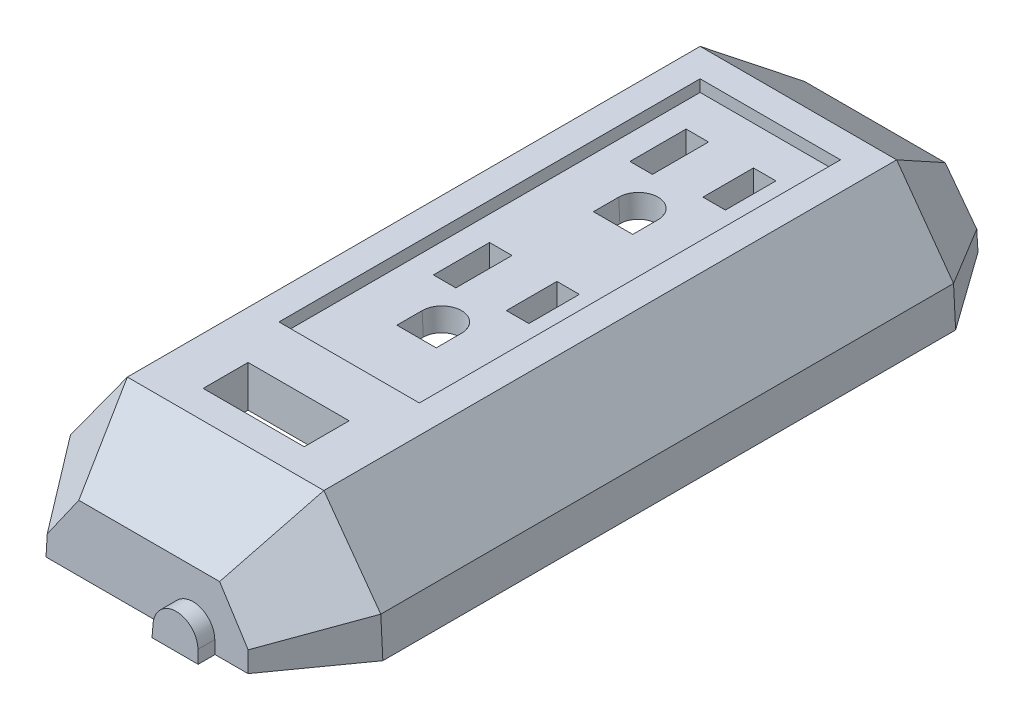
ISO-10303-21;
HEADER;
FILE_DESCRIPTION(('STEP AP214'),'2;1');
FILE_NAME('part.step','',(''),(''),'','','');
FILE_SCHEMA(('AUTOMOTIVE_DESIGN { 1 0 10303 214 1 1 1 1 }'));
ENDSEC;
DATA;
#1=APPLICATION_CONTEXT('core data for automotive mechanical design processes');
#2=APPLICATION_PROTOCOL_DEFINITION('international standard','automotive_design',2000,#1);
#3=PRODUCT_CONTEXT('',#1,'mechanical');
#4=PRODUCT('Part','Part','',(#3));
#5=PRODUCT_RELATED_PRODUCT_CATEGORY('part','',(#4));
#6=PRODUCT_DEFINITION_FORMATION('','',#4);
#7=PRODUCT_DEFINITION_CONTEXT('part definition',#1,'design');
#8=PRODUCT_DEFINITION('design','',#6,#7);
#9=PRODUCT_DEFINITION_SHAPE('','',#8);
#10=(LENGTH_UNIT() NAMED_UNIT(*) SI_UNIT(.MILLI.,.METRE.));
#11=(NAMED_UNIT(*) PLANE_ANGLE_UNIT() SI_UNIT($,.RADIAN.));
#12=(NAMED_UNIT(*) SI_UNIT($,.STERADIAN.) SOLID_ANGLE_UNIT());
#13=UNCERTAINTY_MEASURE_WITH_UNIT(LENGTH_MEASURE(1.E-05),#10,'distance_accuracy_value','');
#14=(GEOMETRIC_REPRESENTATION_CONTEXT(3) GLOBAL_UNCERTAINTY_ASSIGNED_CONTEXT((#13)) GLOBAL_UNIT_ASSIGNED_CONTEXT((#10,
#11,#12)) REPRESENTATION_CONTEXT('',''));
#15=CARTESIAN_POINT('',(0.,0.,0.));
#16=DIRECTION('',(0.,0.,1.));
#17=DIRECTION('',(1.,0.,0.));
#18=AXIS2_PLACEMENT_3D('',#15,#16,#17);
#19=CARTESIAN_POINT('',(-23.0679705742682,10.7903350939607,88.2924274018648));
#20=DIRECTION('',(1.,0.,0.));
#21=DIRECTION('',(0.,0.,-1.));
#22=AXIS2_PLACEMENT_3D('',#19,#20,#21);
#23=CYLINDRICAL_SURFACE('',#22,0.790335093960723);
#24=DIRECTION('',(-1.,0.,0.));
#25=VECTOR('',#24,1.);
#26=CARTESIAN_POINT('',(-26.4979414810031,10.7489721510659,89.081679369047));
#27=LINE('',#26,#25);
#28=CARTESIAN_POINT('',(-23.0679705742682,10.7489721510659,89.081679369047));
#29=VERTEX_POINT('',#28);
#30=CARTESIAN_POINT('',(23.0679705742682,10.7489721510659,89.081679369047));
#31=VERTEX_POINT('',#30);
#32=EDGE_CURVE('E1195',#29,#31,#27,.F.);
#33=ORIENTED_EDGE('',*,*,#32,.F.);
#34=CARTESIAN_POINT('',(-23.038032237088,10.7903350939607,88.2924274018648));
#35=DIRECTION('',(0.810073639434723,-0.586328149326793,0.));
#36=DIRECTION('',(0.586328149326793,0.810073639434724,0.));
#37=AXIS2_PLACEMENT_3D('',#34,#35,#36);
#38=ELLIPSE('',#37,0.97563364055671,0.790335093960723);
#39=CARTESIAN_POINT('',(-23.0679705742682,10.7489721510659,87.5031754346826));
#40=VERTEX_POINT('',#39);
#41=EDGE_CURVE('E41',#29,#40,#38,.T.);
#42=ORIENTED_EDGE('',*,*,#41,.T.);
#43=DIRECTION('',(-1.,0.,0.));
#44=VECTOR('',#43,1.);
#45=CARTESIAN_POINT('',(-23.0679705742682,10.7489721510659,87.5031754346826));
#46=LINE('',#45,#44);
#47=CARTESIAN_POINT('',(23.0679705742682,10.7489721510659,87.5031754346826));
#48=VERTEX_POINT('',#47);
#49=EDGE_CURVE('E1198',#48,#40,#46,.T.);
#50=ORIENTED_EDGE('',*,*,#49,.F.);
#51=CARTESIAN_POINT('',(23.038032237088,10.7903350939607,88.2924274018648));
#52=DIRECTION('',(-0.810073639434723,-0.586328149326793,0.));
#53=DIRECTION('',(0.586328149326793,-0.810073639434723,0.));
#54=AXIS2_PLACEMENT_3D('',#51,#52,#53);
#55=ELLIPSE('',#54,0.975633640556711,0.790335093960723);
#56=EDGE_CURVE('E11',#48,#31,#55,.T.);
#57=ORIENTED_EDGE('',*,*,#56,.T.);
#58=EDGE_LOOP('',(#33,#42,#50,#57));
#59=FACE_BOUND('',#58,.T.);
#60=ADVANCED_FACE('F34',(#59),#23,.T.);
#61=CARTESIAN_POINT('',(23.0679705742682,10.7903350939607,53.2924274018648));
#62=DIRECTION('',(1.,0.,0.));
#63=DIRECTION('',(0.,0.,-1.));
#64=AXIS2_PLACEMENT_3D('',#61,#62,#63);
#65=CYLINDRICAL_SURFACE('',#64,0.790335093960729);
#66=DIRECTION('',(-1.,0.,0.));
#67=VECTOR('',#66,1.);
#68=CARTESIAN_POINT('',(23.0679705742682,10.7489721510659,52.5031754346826));
#69=LINE('',#68,#67);
#70=CARTESIAN_POINT('',(23.0679705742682,10.7489721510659,52.5031754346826));
#71=VERTEX_POINT('',#70);
#72=CARTESIAN_POINT('',(-23.0679705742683,10.7489721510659,52.5031754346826));
#73=VERTEX_POINT('',#72);
#74=EDGE_CURVE('E1183',#71,#73,#69,.T.);
#75=ORIENTED_EDGE('',*,*,#74,.F.);
#76=CARTESIAN_POINT('',(23.038032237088,10.7903350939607,53.2924274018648));
#77=DIRECTION('',(-0.810073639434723,-0.586328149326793,0.));
#78=DIRECTION('',(0.586328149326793,-0.810073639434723,0.));
#79=AXIS2_PLACEMENT_3D('',#76,#77,#78);
#80=ELLIPSE('',#79,0.975633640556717,0.790335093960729);
#81=CARTESIAN_POINT('',(23.0679705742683,10.7489721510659,54.081679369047));
#82=VERTEX_POINT('',#81);
#83=EDGE_CURVE('E1191',#71,#82,#80,.T.);
#84=ORIENTED_EDGE('',*,*,#83,.T.);
#85=DIRECTION('',(-1.,0.,0.));
#86=VECTOR('',#85,1.);
#87=CARTESIAN_POINT('',(-26.4979414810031,10.7489721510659,54.081679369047));
#88=LINE('',#87,#86);
#89=CARTESIAN_POINT('',(-23.0679705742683,10.7489721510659,54.081679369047));
#90=VERTEX_POINT('',#89);
#91=EDGE_CURVE('E1188',#90,#82,#88,.F.);
#92=ORIENTED_EDGE('',*,*,#91,.F.);
#93=CARTESIAN_POINT('',(-23.038032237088,10.7903350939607,53.2924274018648));
#94=DIRECTION('',(0.810073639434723,-0.586328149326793,0.));
#95=DIRECTION('',(0.586328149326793,0.810073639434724,0.));
#96=AXIS2_PLACEMENT_3D('',#93,#94,#95);
#97=ELLIPSE('',#96,0.975633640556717,0.790335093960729);
#98=EDGE_CURVE('E1193',#90,#73,#97,.T.);
#99=ORIENTED_EDGE('',*,*,#98,.T.);
#100=EDGE_LOOP('',(#75,#84,#92,#99));
#101=FACE_BOUND('',#100,.T.);
#102=ADVANCED_FACE('F1651',(#101),#65,.T.);
#103=CARTESIAN_POINT('',(-17.5,19.5,130.));
#104=DIRECTION('',(0.,-1.,0.));
#105=DIRECTION('',(0.,0.,-1.));
#106=AXIS2_PLACEMENT_3D('',#103,#104,#105);
#107=PLANE('',#106);
#108=DIRECTION('',(1.,0.,0.));
#109=VECTOR('',#108,1.);
#110=CARTESIAN_POINT('',(-9.,19.5,112.423446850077));
#111=LINE('',#110,#109);
#112=CARTESIAN_POINT('',(-10.4234468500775,19.5,112.423446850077));
#113=VERTEX_POINT('',#112);
#114=CARTESIAN_POINT('',(-1.0382427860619,19.5,112.423446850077));
#115=VERTEX_POINT('',#114);
#116=EDGE_CURVE('E1256',#113,#115,#111,.T.);
#117=ORIENTED_EDGE('',*,*,#116,.T.);
#118=DIRECTION('',(0.,0.,1.));
#119=VECTOR('',#118,1.);
#120=CARTESIAN_POINT('',(-1.0382427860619,19.5,130.));
#121=LINE('',#120,#119);
#122=CARTESIAN_POINT('',(-1.0382427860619,19.5,115.519302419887));
#123=VERTEX_POINT('',#122);
#124=EDGE_CURVE('E785',#115,#123,#121,.T.);
#125=ORIENTED_EDGE('',*,*,#124,.T.);
#126=DIRECTION('',(1.,0.,0.));
#127=VECTOR('',#126,1.);
#128=CARTESIAN_POINT('',(28.,19.5,115.519302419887));
#129=LINE('',#128,#127);
#130=CARTESIAN_POINT('',(-16.734010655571,19.5,115.519302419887));
#131=VERTEX_POINT('',#130);
#132=EDGE_CURVE('E1290',#131,#123,#129,.T.);
#133=ORIENTED_EDGE('',*,*,#132,.F.);
#134=DIRECTION('',(0.,0.,-1.));
#135=VECTOR('',#134,1.);
#136=CARTESIAN_POINT('',(-16.734010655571,19.5,130.));
#137=LINE('',#136,#135);
#138=CARTESIAN_POINT('',(-16.734010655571,19.5,89.5403013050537));
#139=VERTEX_POINT('',#138);
#140=EDGE_CURVE('E1286',#131,#139,#137,.T.);
#141=ORIENTED_EDGE('',*,*,#140,.T.);
#142=DIRECTION('',(1.,0.,0.));
#143=VECTOR('',#142,1.);
#144=CARTESIAN_POINT('',(-17.5,19.5,89.5403013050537));
#145=LINE('',#144,#143);
#146=CARTESIAN_POINT('',(-13.9234468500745,19.5,89.5403013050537));
#147=VERTEX_POINT('',#146);
#148=EDGE_CURVE('E1224',#147,#139,#145,.F.);
#149=ORIENTED_EDGE('',*,*,#148,.F.);
#150=DIRECTION('',(0.,0.,1.));
#151=VECTOR('',#150,1.);
#152=CARTESIAN_POINT('',(-13.9234468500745,19.5,19.0000000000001));
#153=LINE('',#152,#151);
#154=CARTESIAN_POINT('',(-13.9234468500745,19.5,95.4234468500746));
#155=VERTEX_POINT('',#154);
#156=EDGE_CURVE('E1269',#147,#155,#153,.T.);
#157=ORIENTED_EDGE('',*,*,#156,.T.);
#158=DIRECTION('',(1.,0.,0.));
#159=VECTOR('',#158,1.);
#160=CARTESIAN_POINT('',(12.5,19.5,95.4234468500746));
#161=LINE('',#160,#159);
#162=CARTESIAN_POINT('',(-1.0382427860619,19.5,95.4234468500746));
#163=VERTEX_POINT('',#162);
#164=EDGE_CURVE('E1275',#155,#163,#161,.T.);
#165=ORIENTED_EDGE('',*,*,#164,.T.);
#166=DIRECTION('',(0.,0.,1.));
#167=VECTOR('',#166,1.);
#168=CARTESIAN_POINT('',(-1.0382427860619,19.5,130.));
#169=LINE('',#168,#167);
#170=CARTESIAN_POINT('',(-1.0382427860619,19.5,101.576553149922));
#171=VERTEX_POINT('',#170);
#172=EDGE_CURVE('E1781',#163,#171,#169,.T.);
#173=ORIENTED_EDGE('',*,*,#172,.T.);
#174=DIRECTION('',(-1.,0.,0.));
#175=VECTOR('',#174,1.);
#176=CARTESIAN_POINT('',(-9.,19.5,101.576553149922));
#177=LINE('',#176,#175);
#178=CARTESIAN_POINT('',(-10.4234468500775,19.5,101.576553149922));
#179=VERTEX_POINT('',#178);
#180=EDGE_CURVE('E1264',#171,#179,#177,.T.);
#181=ORIENTED_EDGE('',*,*,#180,.T.);
#182=DIRECTION('',(0.,0.,1.));
#183=VECTOR('',#182,1.);
#184=CARTESIAN_POINT('',(-10.4234468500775,19.5,111.));
#185=LINE('',#184,#183);
#186=EDGE_CURVE('E1233',#179,#113,#185,.T.);
#187=ORIENTED_EDGE('',*,*,#186,.T.);
#188=EDGE_LOOP('',(#117,#125,#133,#141,#149,#157,#165,#173,#181,#187));
#189=FACE_BOUND('',#188,.T.);
#190=ADVANCED_FACE('F1655',(#189),#107,.T.);
#191=CARTESIAN_POINT('',(-9.,20.9214960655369,112.497944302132));
#192=DIRECTION('',(0.,-0.0523359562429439,0.998629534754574));
#193=DIRECTION('',(0.,-0.998629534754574,-0.0523359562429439));
#194=AXIS2_PLACEMENT_3D('',#191,#192,#193);
#195=PLANE('',#194);
#196=DIRECTION('',(1.,0.,0.));
#197=VECTOR('',#196,1.);
#198=CARTESIAN_POINT('',(-9.,13.9999999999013,112.135204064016));
#199=LINE('',#198,#197);
#200=CARTESIAN_POINT('',(-10.1352040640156,13.9999999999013,112.135204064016));
#201=VERTEX_POINT('',#200);
#202=CARTESIAN_POINT('',(-0.750000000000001,13.9999999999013,112.135204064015));
#203=VERTEX_POINT('',#202);
#204=EDGE_CURVE('E797',#201,#203,#199,.T.);
#205=ORIENTED_EDGE('',*,*,#204,.T.);
#206=DIRECTION('',(-0.052264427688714,0.997264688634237,0.052264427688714));
#207=VECTOR('',#206,1.);
#208=CARTESIAN_POINT('',(-1.13428484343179,21.3325916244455,112.519488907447));
#209=LINE('',#208,#207);
#210=EDGE_CURVE('E779',#203,#115,#209,.T.);
#211=ORIENTED_EDGE('',*,*,#210,.T.);
#212=ORIENTED_EDGE('',*,*,#116,.F.);
#213=DIRECTION('',(-0.052264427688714,0.997264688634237,0.052264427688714));
#214=VECTOR('',#213,1.);
#215=CARTESIAN_POINT('',(-10.4938525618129,20.8434210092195,112.493852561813));
#216=LINE('',#215,#214);
#217=EDGE_CURVE('E805',#201,#113,#216,.T.);
#218=ORIENTED_EDGE('',*,*,#217,.F.);
#219=EDGE_LOOP('',(#205,#211,#212,#218));
#220=FACE_BOUND('',#219,.T.);
#221=ADVANCED_FACE('F803',(#220),#195,.T.);
#222=CARTESIAN_POINT('',(12.5,20.9214960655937,95.4979443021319));
#223=DIRECTION('',(0.,-0.0523359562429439,0.998629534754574));
#224=DIRECTION('',(0.,-0.998629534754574,-0.0523359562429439));
#225=AXIS2_PLACEMENT_3D('',#222,#223,#224);
#226=PLANE('',#225);
#227=DIRECTION('',(1.,0.,0.));
#228=VECTOR('',#227,1.);
#229=CARTESIAN_POINT('',(12.5,17.4999999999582,95.3186312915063));
#230=LINE('',#229,#228);
#231=CARTESIAN_POINT('',(-13.8186312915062,17.4999999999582,95.3186312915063));
#232=VERTEX_POINT('',#231);
#233=CARTESIAN_POINT('',(-0.933427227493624,17.4999999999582,95.3186312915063));
#234=VERTEX_POINT('',#233);
#235=EDGE_CURVE('E1379',#232,#234,#230,.T.);
#236=ORIENTED_EDGE('',*,*,#235,.T.);
#237=DIRECTION('',(-0.052264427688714,0.997264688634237,0.052264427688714));
#238=VECTOR('',#237,1.);
#239=CARTESIAN_POINT('',(-1.07555607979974,20.2119800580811,95.4607601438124));
#240=LINE('',#239,#238);
#241=EDGE_CURVE('E1778',#234,#163,#240,.T.);
#242=ORIENTED_EDGE('',*,*,#241,.T.);
#243=ORIENTED_EDGE('',*,*,#164,.F.);
#244=DIRECTION('',(-0.052264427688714,0.997264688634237,0.052264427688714));
#245=VECTOR('',#244,1.);
#246=CARTESIAN_POINT('',(-13.7889847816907,16.934310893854,95.2889847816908));
#247=LINE('',#246,#245);
#248=EDGE_CURVE('E1387',#232,#155,#247,.T.);
#249=ORIENTED_EDGE('',*,*,#248,.F.);
#250=EDGE_LOOP('',(#236,#242,#243,#249));
#251=FACE_BOUND('',#250,.T.);
#252=ADVANCED_FACE('F1771',(#251),#226,.T.);
#253=CARTESIAN_POINT('',(12.5,17.4999999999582,94.0000000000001));
#254=DIRECTION('',(0.,-1.,0.));
#255=DIRECTION('',(0.,0.,-1.));
#256=AXIS2_PLACEMENT_3D('',#253,#254,#255);
#257=PLANE('',#256);
#258=DIRECTION('',(1.,0.,0.));
#259=VECTOR('',#258,1.);
#260=CARTESIAN_POINT('',(12.5,17.4999999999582,89.4354857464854));
#261=LINE('',#260,#259);
#262=CARTESIAN_POINT('',(-0.933427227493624,17.4999999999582,89.4354857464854));
#263=VERTEX_POINT('',#262);
#264=CARTESIAN_POINT('',(-13.8186312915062,17.4999999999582,89.4354857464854));
#265=VERTEX_POINT('',#264);
#266=EDGE_CURVE('E1178',#263,#265,#261,.F.);
#267=ORIENTED_EDGE('',*,*,#266,.F.);
#268=DIRECTION('',(0.,0.,1.));
#269=VECTOR('',#268,1.);
#270=CARTESIAN_POINT('',(-0.933427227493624,17.4999999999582,94.0000000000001));
#271=LINE('',#270,#269);
#272=EDGE_CURVE('E1775',#263,#234,#271,.T.);
#273=ORIENTED_EDGE('',*,*,#272,.T.);
#274=ORIENTED_EDGE('',*,*,#235,.F.);
#275=DIRECTION('',(0.,0.,1.));
#276=VECTOR('',#275,1.);
#277=CARTESIAN_POINT('',(-13.8186312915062,17.4999999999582,19.0000000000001));
#278=LINE('',#277,#276);
#279=EDGE_CURVE('E1397',#265,#232,#278,.T.);
#280=ORIENTED_EDGE('',*,*,#279,.F.);
#281=EDGE_LOOP('',(#267,#273,#274,#280));
#282=FACE_BOUND('',#281,.T.);
#283=ADVANCED_FACE('F1774',(#282),#257,.T.);
#284=CARTESIAN_POINT('',(-9.,20.9214960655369,101.502055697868));
#285=DIRECTION('',(0.,-0.0523359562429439,-0.998629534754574));
#286=DIRECTION('',(0.,0.998629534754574,-0.0523359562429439));
#287=AXIS2_PLACEMENT_3D('',#284,#285,#286);
#288=PLANE('',#287);
#289=ORIENTED_EDGE('',*,*,#180,.F.);
#290=DIRECTION('',(0.052264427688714,-0.997264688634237,0.052264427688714));
#291=VECTOR('',#290,1.);
#292=CARTESIAN_POINT('',(-1.13428484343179,21.3325916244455,101.480511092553));
#293=LINE('',#292,#291);
#294=CARTESIAN_POINT('',(-0.750000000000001,13.9999999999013,101.864795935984));
#295=VERTEX_POINT('',#294);
#296=EDGE_CURVE('E1789',#171,#295,#293,.T.);
#297=ORIENTED_EDGE('',*,*,#296,.T.);
#298=DIRECTION('',(-1.,0.,0.));
#299=VECTOR('',#298,1.);
#300=CARTESIAN_POINT('',(-9.,13.9999999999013,101.864795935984));
#301=LINE('',#300,#299);
#302=CARTESIAN_POINT('',(-10.1352040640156,13.9999999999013,101.864795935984));
#303=VERTEX_POINT('',#302);
#304=EDGE_CURVE('E810',#295,#303,#301,.T.);
#305=ORIENTED_EDGE('',*,*,#304,.T.);
#306=DIRECTION('',(-0.052264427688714,0.997264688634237,-0.052264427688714));
#307=VECTOR('',#306,1.);
#308=CARTESIAN_POINT('',(-10.4938525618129,20.8434210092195,101.506147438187));
#309=LINE('',#308,#307);
#310=EDGE_CURVE('E1407',#303,#179,#309,.T.);
#311=ORIENTED_EDGE('',*,*,#310,.T.);
#312=EDGE_LOOP('',(#289,#297,#305,#311));
#313=FACE_BOUND('',#312,.T.);
#314=ADVANCED_FACE('F1922',(#313),#288,.T.);
#315=DIRECTION('',(-1.,0.,0.));
#316=VECTOR('',#315,1.);
#317=CARTESIAN_POINT('',(12.5,19.5,17.5765531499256));
#318=LINE('',#317,#316);
#319=CARTESIAN_POINT('',(13.9234468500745,19.5,17.5765531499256));
#320=VERTEX_POINT('',#319);
#321=CARTESIAN_POINT('',(-13.9234468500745,19.5,17.5765531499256));
#322=VERTEX_POINT('',#321);
#323=EDGE_CURVE('E1267',#320,#322,#318,.T.);
#324=ORIENTED_EDGE('',*,*,#323,.T.);
#325=CARTESIAN_POINT('',(-13.9234468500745,19.5,52.0445534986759));
#326=VERTEX_POINT('',#325);
#327=EDGE_CURVE('E1280',#322,#326,#153,.T.);
#328=ORIENTED_EDGE('',*,*,#327,.T.);
#329=DIRECTION('',(-1.,0.,0.));
#330=VECTOR('',#329,1.);
#331=CARTESIAN_POINT('',(-17.5,19.5,52.0445534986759));
#332=LINE('',#331,#330);
#333=CARTESIAN_POINT('',(-16.734010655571,19.5,52.0445534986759));
#334=VERTEX_POINT('',#333);
#335=EDGE_CURVE('E1710',#326,#334,#332,.T.);
#336=ORIENTED_EDGE('',*,*,#335,.T.);
#337=CARTESIAN_POINT('',(-16.734010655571,19.5,14.4806975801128));
#338=VERTEX_POINT('',#337);
#339=EDGE_CURVE('E1289',#334,#338,#137,.T.);
#340=ORIENTED_EDGE('',*,*,#339,.T.);
#341=DIRECTION('',(1.,0.,0.));
#342=VECTOR('',#341,1.);
#343=CARTESIAN_POINT('',(-17.5,19.5,14.4806975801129));
#344=LINE('',#343,#342);
#345=CARTESIAN_POINT('',(16.734010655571,19.5,14.4806975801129));
#346=VERTEX_POINT('',#345);
#347=EDGE_CURVE('E1247',#346,#338,#344,.F.);
#348=ORIENTED_EDGE('',*,*,#347,.F.);
#349=DIRECTION('',(0.,0.,-1.));
#350=VECTOR('',#349,1.);
#351=CARTESIAN_POINT('',(16.734010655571,19.5,130.));
#352=LINE('',#351,#350);
#353=CARTESIAN_POINT('',(16.734010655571,19.5,52.0445534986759));
#354=VERTEX_POINT('',#353);
#355=EDGE_CURVE('E1251',#354,#346,#352,.T.);
#356=ORIENTED_EDGE('',*,*,#355,.F.);
#357=CARTESIAN_POINT('',(13.9234468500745,19.5,52.0445534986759));
#358=VERTEX_POINT('',#357);
#359=EDGE_CURVE('E1728',#354,#358,#332,.T.);
#360=ORIENTED_EDGE('',*,*,#359,.T.);
#361=DIRECTION('',(0.,0.,-1.));
#362=VECTOR('',#361,1.);
#363=CARTESIAN_POINT('',(13.9234468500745,19.5,19.0000000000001));
#364=LINE('',#363,#362);
#365=EDGE_CURVE('E1274',#358,#320,#364,.T.);
#366=ORIENTED_EDGE('',*,*,#365,.T.);
#367=EDGE_LOOP('',(#324,#328,#336,#340,#348,#356,#360,#366));
#368=FACE_BOUND('',#367,.T.);
#369=ADVANCED_FACE('F1708',(#368),#107,.T.);
#370=DIRECTION('',(1.,0.,0.));
#371=VECTOR('',#370,1.);
#372=CARTESIAN_POINT('',(-17.5,19.5,54.5403013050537));
#373=LINE('',#372,#371);
#374=CARTESIAN_POINT('',(16.734010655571,19.5,54.5403013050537));
#375=VERTEX_POINT('',#374);
#376=CARTESIAN_POINT('',(13.9234468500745,19.5,54.5403013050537));
#377=VERTEX_POINT('',#376);
#378=EDGE_CURVE('E1725',#375,#377,#373,.F.);
#379=ORIENTED_EDGE('',*,*,#378,.F.);
#380=CARTESIAN_POINT('',(16.734010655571,19.5,87.0445534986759));
#381=VERTEX_POINT('',#380);
#382=EDGE_CURVE('E1250',#381,#375,#352,.T.);
#383=ORIENTED_EDGE('',*,*,#382,.F.);
#384=DIRECTION('',(-1.,0.,0.));
#385=VECTOR('',#384,1.);
#386=CARTESIAN_POINT('',(-17.5,19.5,87.0445534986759));
#387=LINE('',#386,#385);
#388=CARTESIAN_POINT('',(13.9234468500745,19.5,87.0445534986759));
#389=VERTEX_POINT('',#388);
#390=EDGE_CURVE('E1218',#381,#389,#387,.T.);
#391=ORIENTED_EDGE('',*,*,#390,.T.);
#392=EDGE_CURVE('E1273',#389,#377,#364,.T.);
#393=ORIENTED_EDGE('',*,*,#392,.T.);
#394=EDGE_LOOP('',(#379,#383,#391,#393));
#395=FACE_BOUND('',#394,.T.);
#396=ADVANCED_FACE('F1747',(#395),#107,.T.);
#397=CARTESIAN_POINT('',(13.9979443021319,20.9214960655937,19.0000000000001));
#398=DIRECTION('',(0.998629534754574,-0.0523359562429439,0.));
#399=DIRECTION('',(0.0523359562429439,0.998629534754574,0.));
#400=AXIS2_PLACEMENT_3D('',#397,#398,#399);
#401=PLANE('',#400);
#402=ORIENTED_EDGE('',*,*,#365,.F.);
#403=DIRECTION('',(-0.052264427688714,-0.997264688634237,0.052264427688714));
#404=VECTOR('',#403,1.);
#405=CARTESIAN_POINT('',(14.0880043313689,22.6399437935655,51.8799960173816));
#406=LINE('',#405,#404);
#407=CARTESIAN_POINT('',(13.8186312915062,17.4999999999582,52.1493690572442));
#408=VERTEX_POINT('',#407);
#409=EDGE_CURVE('E1809',#358,#408,#406,.T.);
#410=ORIENTED_EDGE('',*,*,#409,.T.);
#411=DIRECTION('',(0.,0.,-1.));
#412=VECTOR('',#411,1.);
#413=CARTESIAN_POINT('',(13.8186312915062,17.4999999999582,19.0000000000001));
#414=LINE('',#413,#412);
#415=CARTESIAN_POINT('',(13.8186312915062,17.4999999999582,17.6813687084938));
#416=VERTEX_POINT('',#415);
#417=EDGE_CURVE('E1278',#408,#416,#414,.T.);
#418=ORIENTED_EDGE('',*,*,#417,.T.);
#419=DIRECTION('',(0.052264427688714,0.997264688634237,-0.052264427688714));
#420=VECTOR('',#419,1.);
#421=CARTESIAN_POINT('',(13.9938525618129,20.8434210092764,17.5061474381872));
#422=LINE('',#421,#420);
#423=EDGE_CURVE('E1375',#416,#320,#422,.T.);
#424=ORIENTED_EDGE('',*,*,#423,.T.);
#425=EDGE_LOOP('',(#402,#410,#418,#424));
#426=FACE_BOUND('',#425,.T.);
#427=ADVANCED_FACE('F1817',(#426),#401,.T.);
#428=CARTESIAN_POINT('',(-13.9979443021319,20.9214960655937,19.0000000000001));
#429=DIRECTION('',(-0.998629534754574,-0.0523359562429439,0.));
#430=DIRECTION('',(0.0523359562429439,-0.998629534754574,0.));
#431=AXIS2_PLACEMENT_3D('',#428,#429,#430);
#432=PLANE('',#431);
#433=CARTESIAN_POINT('',(-13.8186312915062,17.4999999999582,17.6813687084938));
#434=VERTEX_POINT('',#433);
#435=CARTESIAN_POINT('',(-13.8186312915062,17.4999999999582,52.1493690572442));
#436=VERTEX_POINT('',#435);
#437=EDGE_CURVE('E1393',#434,#436,#278,.T.);
#438=ORIENTED_EDGE('',*,*,#437,.T.);
#439=DIRECTION('',(-0.052264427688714,0.997264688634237,-0.052264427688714));
#440=VECTOR('',#439,1.);
#441=CARTESIAN_POINT('',(-14.0880043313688,22.6399437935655,51.8799960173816));
#442=LINE('',#441,#440);
#443=EDGE_CURVE('E1805',#436,#326,#442,.T.);
#444=ORIENTED_EDGE('',*,*,#443,.T.);
#445=ORIENTED_EDGE('',*,*,#327,.F.);
#446=DIRECTION('',(-0.052264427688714,0.997264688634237,-0.052264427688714));
#447=VECTOR('',#446,1.);
#448=CARTESIAN_POINT('',(-13.9255633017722,19.5403843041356,17.5744366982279));
#449=LINE('',#448,#447);
#450=EDGE_CURVE('E1378',#434,#322,#449,.T.);
#451=ORIENTED_EDGE('',*,*,#450,.F.);
#452=EDGE_LOOP('',(#438,#444,#445,#451));
#453=FACE_BOUND('',#452,.T.);
#454=ADVANCED_FACE('F1830',(#453),#432,.T.);
#455=CARTESIAN_POINT('',(0.,17.4999999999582,42.5000000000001));
#456=DIRECTION('',(0.,-1.,0.));
#457=DIRECTION('',(0.,0.,-1.));
#458=AXIS2_PLACEMENT_3D('',#455,#456,#457);
#459=CIRCLE('',#458,4.92344685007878);
#460=CARTESIAN_POINT('',(4.92344685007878,17.4999999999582,42.5000000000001));
#461=VERTEX_POINT('',#460);
#462=CARTESIAN_POINT('',(-4.92344685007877,17.4999999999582,42.5000000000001));
#463=VERTEX_POINT('',#462);
#464=EDGE_CURVE('E1443',#461,#463,#459,.F.);
#465=ORIENTED_EDGE('',*,*,#464,.T.);
#466=DIRECTION('',(0.,0.,1.));
#467=VECTOR('',#466,1.);
#468=CARTESIAN_POINT('',(-4.92344685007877,17.4999999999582,42.5000000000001));
#469=LINE('',#468,#467);
#470=CARTESIAN_POINT('',(-4.92344685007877,17.4999999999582,48.4234468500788));
#471=VERTEX_POINT('',#470);
#472=EDGE_CURVE('E1439',#463,#471,#469,.T.);
#473=ORIENTED_EDGE('',*,*,#472,.T.);
#474=DIRECTION('',(1.,0.,0.));
#475=VECTOR('',#474,1.);
#476=CARTESIAN_POINT('',(-3.49999999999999,17.4999999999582,48.4234468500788));
#477=LINE('',#476,#475);
#478=CARTESIAN_POINT('',(4.92344685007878,17.4999999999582,48.4234468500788));
#479=VERTEX_POINT('',#478);
#480=EDGE_CURVE('E1442',#471,#479,#477,.T.);
#481=ORIENTED_EDGE('',*,*,#480,.T.);
#482=DIRECTION('',(0.,0.,-1.));
#483=VECTOR('',#482,1.);
#484=CARTESIAN_POINT('',(4.92344685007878,17.4999999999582,47.0000000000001));
#485=LINE('',#484,#483);
#486=EDGE_CURVE('E1446',#479,#461,#485,.T.);
#487=ORIENTED_EDGE('',*,*,#486,.T.);
#488=EDGE_LOOP('',(#465,#473,#481,#487));
#489=FACE_BOUND('',#488,.T.);
#490=ORIENTED_EDGE('',*,*,#437,.F.);
#491=DIRECTION('',(-1.,0.,0.));
#492=VECTOR('',#491,1.);
#493=CARTESIAN_POINT('',(12.5,17.4999999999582,17.6813687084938));
#494=LINE('',#493,#492);
#495=EDGE_CURVE('E1383',#416,#434,#494,.T.);
#496=ORIENTED_EDGE('',*,*,#495,.F.);
#497=ORIENTED_EDGE('',*,*,#417,.F.);
#498=DIRECTION('',(-1.,0.,0.));
#499=VECTOR('',#498,1.);
#500=CARTESIAN_POINT('',(12.5,17.4999999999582,52.1493690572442));
#501=LINE('',#500,#499);
#502=EDGE_CURVE('E1807',#408,#436,#501,.T.);
#503=ORIENTED_EDGE('',*,*,#502,.T.);
#504=EDGE_LOOP('',(#490,#496,#497,#503));
#505=FACE_BOUND('',#504,.T.);
#506=DIRECTION('',(0.,0.,-1.));
#507=VECTOR('',#506,1.);
#508=CARTESIAN_POINT('',(9.42344685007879,17.4999999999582,35.0000000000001));
#509=LINE('',#508,#507);
#510=CARTESIAN_POINT('',(9.42344685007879,17.4999999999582,36.4234468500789));
#511=VERTEX_POINT('',#510);
#512=CARTESIAN_POINT('',(9.42344685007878,17.4999999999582,24.5765531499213));
#513=VERTEX_POINT('',#512);
#514=EDGE_CURVE('E1464',#511,#513,#509,.T.);
#515=ORIENTED_EDGE('',*,*,#514,.T.);
#516=DIRECTION('',(-1.,0.,0.));
#517=VECTOR('',#516,1.);
#518=CARTESIAN_POINT('',(8.00000000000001,17.4999999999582,24.5765531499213));
#519=LINE('',#518,#517);
#520=CARTESIAN_POINT('',(2.57655314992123,17.4999999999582,24.5765531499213));
#521=VERTEX_POINT('',#520);
#522=EDGE_CURVE('E1467',#513,#521,#519,.T.);
#523=ORIENTED_EDGE('',*,*,#522,.T.);
#524=DIRECTION('',(0.,0.,1.));
#525=VECTOR('',#524,1.);
#526=CARTESIAN_POINT('',(2.57655314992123,17.4999999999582,26.0000000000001));
#527=LINE('',#526,#525);
#528=CARTESIAN_POINT('',(2.57655314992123,17.4999999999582,36.4234468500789));
#529=VERTEX_POINT('',#528);
#530=EDGE_CURVE('E1471',#521,#529,#527,.T.);
#531=ORIENTED_EDGE('',*,*,#530,.T.);
#532=DIRECTION('',(1.,0.,0.));
#533=VECTOR('',#532,1.);
#534=CARTESIAN_POINT('',(4.00000000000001,17.4999999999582,36.4234468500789));
#535=LINE('',#534,#533);
#536=EDGE_CURVE('E1468',#529,#511,#535,.T.);
#537=ORIENTED_EDGE('',*,*,#536,.T.);
#538=EDGE_LOOP('',(#515,#523,#531,#537));
#539=FACE_BOUND('',#538,.T.);
#540=DIRECTION('',(0.,0.,-1.));
#541=VECTOR('',#540,1.);
#542=CARTESIAN_POINT('',(-2.57655314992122,17.4999999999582,36.0000000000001));
#543=LINE('',#542,#541);
#544=CARTESIAN_POINT('',(-2.57655314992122,17.4999999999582,37.4234468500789));
#545=VERTEX_POINT('',#544);
#546=CARTESIAN_POINT('',(-2.57655314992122,17.4999999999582,24.5765531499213));
#547=VERTEX_POINT('',#546);
#548=EDGE_CURVE('E1451',#545,#547,#543,.T.);
#549=ORIENTED_EDGE('',*,*,#548,.T.);
#550=DIRECTION('',(-1.,0.,0.));
#551=VECTOR('',#550,1.);
#552=CARTESIAN_POINT('',(-4.,17.4999999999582,24.5765531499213));
#553=LINE('',#552,#551);
#554=CARTESIAN_POINT('',(-9.42344685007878,17.4999999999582,24.5765531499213));
#555=VERTEX_POINT('',#554);
#556=EDGE_CURVE('E1454',#547,#555,#553,.T.);
#557=ORIENTED_EDGE('',*,*,#556,.T.);
#558=DIRECTION('',(0.,0.,1.));
#559=VECTOR('',#558,1.);
#560=CARTESIAN_POINT('',(-9.42344685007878,17.4999999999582,26.0000000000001));
#561=LINE('',#560,#559);
#562=CARTESIAN_POINT('',(-9.42344685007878,17.4999999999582,37.4234468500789));
#563=VERTEX_POINT('',#562);
#564=EDGE_CURVE('E1458',#555,#563,#561,.T.);
#565=ORIENTED_EDGE('',*,*,#564,.T.);
#566=DIRECTION('',(1.,0.,0.));
#567=VECTOR('',#566,1.);
#568=CARTESIAN_POINT('',(-8.,17.4999999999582,37.4234468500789));
#569=LINE('',#568,#567);
#570=EDGE_CURVE('E1455',#563,#545,#569,.T.);
#571=ORIENTED_EDGE('',*,*,#570,.T.);
#572=EDGE_LOOP('',(#549,#557,#565,#571));
#573=FACE_BOUND('',#572,.T.);
#574=ADVANCED_FACE('F1825',(#489,#505,#539,#573),#257,.T.);
#575=CARTESIAN_POINT('',(-13.9234468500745,19.5,54.5403013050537));
#576=VERTEX_POINT('',#575);
#577=CARTESIAN_POINT('',(-16.734010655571,19.5,54.5403013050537));
#578=VERTEX_POINT('',#577);
#579=EDGE_CURVE('E1715',#576,#578,#373,.F.);
#580=ORIENTED_EDGE('',*,*,#579,.F.);
#581=CARTESIAN_POINT('',(-13.9234468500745,19.5,87.0445534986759));
#582=VERTEX_POINT('',#581);
#583=EDGE_CURVE('E1283',#576,#582,#153,.T.);
#584=ORIENTED_EDGE('',*,*,#583,.T.);
#585=CARTESIAN_POINT('',(-16.734010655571,19.5,87.0445534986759));
#586=VERTEX_POINT('',#585);
#587=EDGE_CURVE('E1717',#582,#586,#387,.T.);
#588=ORIENTED_EDGE('',*,*,#587,.T.);
#589=EDGE_CURVE('E1212',#586,#578,#137,.T.);
#590=ORIENTED_EDGE('',*,*,#589,.T.);
#591=EDGE_LOOP('',(#580,#584,#588,#590));
#592=FACE_BOUND('',#591,.T.);
#593=ADVANCED_FACE('F1714',(#592),#107,.T.);
#594=DIRECTION('',(0.052264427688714,0.997264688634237,0.052264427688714));
#595=VECTOR('',#594,1.);
#596=CARTESIAN_POINT('',(13.900659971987,19.065200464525,54.5175144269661));
#597=LINE('',#596,#595);
#598=CARTESIAN_POINT('',(13.8186312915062,17.4999999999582,54.4354857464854));
#599=VERTEX_POINT('',#598);
#600=EDGE_CURVE('E1732',#377,#599,#597,.F.);
#601=ORIENTED_EDGE('',*,*,#600,.F.);
#602=ORIENTED_EDGE('',*,*,#392,.F.);
#603=DIRECTION('',(-0.052264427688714,-0.997264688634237,0.052264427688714));
#604=VECTOR('',#603,1.);
#605=CARTESIAN_POINT('',(14.1836092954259,24.4641951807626,86.7843910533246));
#606=LINE('',#605,#604);
#607=CARTESIAN_POINT('',(13.8186312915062,17.4999999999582,87.1493690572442));
#608=VERTEX_POINT('',#607);
#609=EDGE_CURVE('E1742',#389,#608,#606,.T.);
#610=ORIENTED_EDGE('',*,*,#609,.T.);
#611=EDGE_CURVE('E1384',#608,#599,#414,.T.);
#612=ORIENTED_EDGE('',*,*,#611,.T.);
#613=EDGE_LOOP('',(#601,#602,#610,#612));
#614=FACE_BOUND('',#613,.T.);
#615=ADVANCED_FACE('F1751',(#614),#401,.T.);
#616=DIRECTION('',(0.052264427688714,-0.997264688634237,-0.052264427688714));
#617=VECTOR('',#616,1.);
#618=CARTESIAN_POINT('',(-13.900659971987,19.065200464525,54.5175144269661));
#619=LINE('',#618,#617);
#620=CARTESIAN_POINT('',(-13.8186312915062,17.4999999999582,54.4354857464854));
#621=VERTEX_POINT('',#620);
#622=EDGE_CURVE('E1722',#621,#576,#619,.F.);
#623=ORIENTED_EDGE('',*,*,#622,.F.);
#624=CARTESIAN_POINT('',(-13.8186312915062,17.4999999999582,87.1493690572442));
#625=VERTEX_POINT('',#624);
#626=EDGE_CURVE('E1396',#621,#625,#278,.T.);
#627=ORIENTED_EDGE('',*,*,#626,.T.);
#628=DIRECTION('',(-0.052264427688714,0.997264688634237,-0.052264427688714));
#629=VECTOR('',#628,1.);
#630=CARTESIAN_POINT('',(-14.1836092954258,24.4641951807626,86.7843910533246));
#631=LINE('',#630,#629);
#632=EDGE_CURVE('E1735',#625,#582,#631,.T.);
#633=ORIENTED_EDGE('',*,*,#632,.T.);
#634=ORIENTED_EDGE('',*,*,#583,.F.);
#635=EDGE_LOOP('',(#623,#627,#633,#634));
#636=FACE_BOUND('',#635,.T.);
#637=ADVANCED_FACE('F1760',(#636),#432,.T.);
#638=CARTESIAN_POINT('',(0.,17.4999999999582,77.5000000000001));
#639=DIRECTION('',(0.,-1.,0.));
#640=DIRECTION('',(0.,0.,-1.));
#641=AXIS2_PLACEMENT_3D('',#638,#639,#640);
#642=CIRCLE('',#641,4.92344685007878);
#643=CARTESIAN_POINT('',(4.92344685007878,17.4999999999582,77.5000000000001));
#644=VERTEX_POINT('',#643);
#645=CARTESIAN_POINT('',(-4.92344685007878,17.4999999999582,77.5000000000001));
#646=VERTEX_POINT('',#645);
#647=EDGE_CURVE('E1405',#644,#646,#642,.F.);
#648=ORIENTED_EDGE('',*,*,#647,.T.);
#649=DIRECTION('',(0.,0.,1.));
#650=VECTOR('',#649,1.);
#651=CARTESIAN_POINT('',(-4.92344685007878,17.4999999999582,77.5000000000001));
#652=LINE('',#651,#650);
#653=CARTESIAN_POINT('',(-4.92344685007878,17.4999999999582,83.4234468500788));
#654=VERTEX_POINT('',#653);
#655=EDGE_CURVE('E1401',#646,#654,#652,.T.);
#656=ORIENTED_EDGE('',*,*,#655,.T.);
#657=DIRECTION('',(1.,0.,0.));
#658=VECTOR('',#657,1.);
#659=CARTESIAN_POINT('',(-3.5,17.4999999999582,83.4234468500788));
#660=LINE('',#659,#658);
#661=CARTESIAN_POINT('',(4.92344685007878,17.4999999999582,83.4234468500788));
#662=VERTEX_POINT('',#661);
#663=EDGE_CURVE('E1404',#654,#662,#660,.T.);
#664=ORIENTED_EDGE('',*,*,#663,.T.);
#665=DIRECTION('',(0.,0.,-1.));
#666=VECTOR('',#665,1.);
#667=CARTESIAN_POINT('',(4.92344685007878,17.4999999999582,82.0000000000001));
#668=LINE('',#667,#666);
#669=EDGE_CURVE('E1408',#662,#644,#668,.T.);
#670=ORIENTED_EDGE('',*,*,#669,.T.);
#671=EDGE_LOOP('',(#648,#656,#664,#670));
#672=FACE_BOUND('',#671,.T.);
#673=ORIENTED_EDGE('',*,*,#626,.F.);
#674=DIRECTION('',(1.,0.,0.));
#675=VECTOR('',#674,1.);
#676=CARTESIAN_POINT('',(12.5,17.4999999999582,54.4354857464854));
#677=LINE('',#676,#675);
#678=EDGE_CURVE('E1726',#599,#621,#677,.F.);
#679=ORIENTED_EDGE('',*,*,#678,.F.);
#680=ORIENTED_EDGE('',*,*,#611,.F.);
#681=DIRECTION('',(-1.,0.,0.));
#682=VECTOR('',#681,1.);
#683=CARTESIAN_POINT('',(12.5,17.4999999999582,87.1493690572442));
#684=LINE('',#683,#682);
#685=EDGE_CURVE('E1128',#608,#625,#684,.T.);
#686=ORIENTED_EDGE('',*,*,#685,.T.);
#687=EDGE_LOOP('',(#673,#679,#680,#686));
#688=FACE_BOUND('',#687,.T.);
#689=DIRECTION('',(0.,0.,-1.));
#690=VECTOR('',#689,1.);
#691=CARTESIAN_POINT('',(9.42344685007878,17.4999999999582,70.0000000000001));
#692=LINE('',#691,#690);
#693=CARTESIAN_POINT('',(9.42344685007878,17.4999999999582,71.4234468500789));
#694=VERTEX_POINT('',#693);
#695=CARTESIAN_POINT('',(9.42344685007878,17.4999999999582,59.5765531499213));
#696=VERTEX_POINT('',#695);
#697=EDGE_CURVE('E1426',#694,#696,#692,.T.);
#698=ORIENTED_EDGE('',*,*,#697,.T.);
#699=DIRECTION('',(-1.,0.,0.));
#700=VECTOR('',#699,1.);
#701=CARTESIAN_POINT('',(8.,17.4999999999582,59.5765531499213));
#702=LINE('',#701,#700);
#703=CARTESIAN_POINT('',(2.57655314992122,17.4999999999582,59.5765531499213));
#704=VERTEX_POINT('',#703);
#705=EDGE_CURVE('E1429',#696,#704,#702,.T.);
#706=ORIENTED_EDGE('',*,*,#705,.T.);
#707=DIRECTION('',(0.,0.,1.));
#708=VECTOR('',#707,1.);
#709=CARTESIAN_POINT('',(2.57655314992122,17.4999999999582,61.0000000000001));
#710=LINE('',#709,#708);
#711=CARTESIAN_POINT('',(2.57655314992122,17.4999999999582,71.4234468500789));
#712=VERTEX_POINT('',#711);
#713=EDGE_CURVE('E1433',#704,#712,#710,.T.);
#714=ORIENTED_EDGE('',*,*,#713,.T.);
#715=DIRECTION('',(1.,0.,0.));
#716=VECTOR('',#715,1.);
#717=CARTESIAN_POINT('',(4.,17.4999999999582,71.4234468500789));
#718=LINE('',#717,#716);
#719=EDGE_CURVE('E1430',#712,#694,#718,.T.);
#720=ORIENTED_EDGE('',*,*,#719,.T.);
#721=EDGE_LOOP('',(#698,#706,#714,#720));
#722=FACE_BOUND('',#721,.T.);
#723=DIRECTION('',(0.,0.,-1.));
#724=VECTOR('',#723,1.);
#725=CARTESIAN_POINT('',(-2.57655314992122,17.4999999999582,71.0000000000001));
#726=LINE('',#725,#724);
#727=CARTESIAN_POINT('',(-2.57655314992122,17.4999999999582,72.4234468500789));
#728=VERTEX_POINT('',#727);
#729=CARTESIAN_POINT('',(-2.57655314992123,17.4999999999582,59.5765531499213));
#730=VERTEX_POINT('',#729);
#731=EDGE_CURVE('E1413',#728,#730,#726,.T.);
#732=ORIENTED_EDGE('',*,*,#731,.T.);
#733=DIRECTION('',(-1.,0.,0.));
#734=VECTOR('',#733,1.);
#735=CARTESIAN_POINT('',(-4.,17.4999999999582,59.5765531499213));
#736=LINE('',#735,#734);
#737=CARTESIAN_POINT('',(-9.42344685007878,17.4999999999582,59.5765531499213));
#738=VERTEX_POINT('',#737);
#739=EDGE_CURVE('E1416',#730,#738,#736,.T.);
#740=ORIENTED_EDGE('',*,*,#739,.T.);
#741=DIRECTION('',(0.,0.,1.));
#742=VECTOR('',#741,1.);
#743=CARTESIAN_POINT('',(-9.42344685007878,17.4999999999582,61.0000000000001));
#744=LINE('',#743,#742);
#745=CARTESIAN_POINT('',(-9.42344685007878,17.4999999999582,72.4234468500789));
#746=VERTEX_POINT('',#745);
#747=EDGE_CURVE('E1420',#738,#746,#744,.T.);
#748=ORIENTED_EDGE('',*,*,#747,.T.);
#749=DIRECTION('',(1.,0.,0.));
#750=VECTOR('',#749,1.);
#751=CARTESIAN_POINT('',(-8.00000000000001,17.4999999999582,72.4234468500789));
#752=LINE('',#751,#750);
#753=EDGE_CURVE('E1417',#746,#728,#752,.T.);
#754=ORIENTED_EDGE('',*,*,#753,.T.);
#755=EDGE_LOOP('',(#732,#740,#748,#754));
#756=FACE_BOUND('',#755,.T.);
#757=ADVANCED_FACE('F1638',(#672,#688,#722,#756),#257,.T.);
#758=CARTESIAN_POINT('',(-28.,0.,130.));
#759=DIRECTION('',(0.,1.,0.));
#760=DIRECTION('',(0.,0.,1.));
#761=AXIS2_PLACEMENT_3D('',#758,#759,#760);
#762=PLANE('',#761);
#763=DIRECTION('',(0.,0.,-1.));
#764=VECTOR('',#763,1.);
#765=CARTESIAN_POINT('',(-28.,0.,130.));
#766=LINE('',#765,#764);
#767=CARTESIAN_POINT('',(-28.,0.,116.));
#768=VERTEX_POINT('',#767);
#769=CARTESIAN_POINT('',(-28.,0.,14.0000000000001));
#770=VERTEX_POINT('',#769);
#771=EDGE_CURVE('E1068',#768,#770,#766,.T.);
#772=ORIENTED_EDGE('',*,*,#771,.T.);
#773=DIRECTION('',(-0.581766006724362,0.,0.813356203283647));
#774=VECTOR('',#773,1.);
#775=CARTESIAN_POINT('',(-27.8758374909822,0.,13.8264107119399));
#776=LINE('',#775,#774);
#777=CARTESIAN_POINT('',(-17.9862765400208,0.,0.));
#778=VERTEX_POINT('',#777);
#779=EDGE_CURVE('E1115',#770,#778,#776,.F.);
#780=ORIENTED_EDGE('',*,*,#779,.T.);
#781=DIRECTION('',(1.,0.,0.));
#782=VECTOR('',#781,1.);
#783=CARTESIAN_POINT('',(-28.,0.,0.));
#784=LINE('',#783,#782);
#785=CARTESIAN_POINT('',(17.9862765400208,0.,0.));
#786=VERTEX_POINT('',#785);
#787=EDGE_CURVE('E1061',#778,#786,#784,.T.);
#788=ORIENTED_EDGE('',*,*,#787,.T.);
#789=DIRECTION('',(-0.581766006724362,0.,-0.813356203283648));
#790=VECTOR('',#789,1.);
#791=CARTESIAN_POINT('',(27.8758374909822,0.,13.8264107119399));
#792=LINE('',#791,#790);
#793=CARTESIAN_POINT('',(28.,0.,14.0000000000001));
#794=VERTEX_POINT('',#793);
#795=EDGE_CURVE('E1113',#786,#794,#792,.F.);
#796=ORIENTED_EDGE('',*,*,#795,.T.);
#797=DIRECTION('',(0.,0.,-1.));
#798=VECTOR('',#797,1.);
#799=CARTESIAN_POINT('',(28.,0.,130.));
#800=LINE('',#799,#798);
#801=CARTESIAN_POINT('',(28.,0.,116.));
#802=VERTEX_POINT('',#801);
#803=EDGE_CURVE('E1065',#802,#794,#800,.T.);
#804=ORIENTED_EDGE('',*,*,#803,.F.);
#805=DIRECTION('',(-0.581766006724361,0.,0.813356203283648));
#806=VECTOR('',#805,1.);
#807=CARTESIAN_POINT('',(17.9955596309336,0.,129.987021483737));
#808=LINE('',#807,#806);
#809=CARTESIAN_POINT('',(17.9862765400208,0.,130.));
#810=VERTEX_POINT('',#809);
#811=EDGE_CURVE('E1088',#802,#810,#808,.T.);
#812=ORIENTED_EDGE('',*,*,#811,.T.);
#813=DIRECTION('',(1.,0.,0.));
#814=VECTOR('',#813,1.);
#815=CARTESIAN_POINT('',(-28.,0.,130.));
#816=LINE('',#815,#814);
#817=CARTESIAN_POINT('',(12.1103049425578,0.,130.));
#818=VERTEX_POINT('',#817);
#819=EDGE_CURVE('E1058',#818,#810,#816,.T.);
#820=ORIENTED_EDGE('',*,*,#819,.F.);
#821=DIRECTION('',(0.,0.,-1.));
#822=VECTOR('',#821,1.);
#823=CARTESIAN_POINT('',(12.1103049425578,0.,132.999999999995));
#824=LINE('',#823,#822);
#825=CARTESIAN_POINT('',(12.1103049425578,0.,132.999999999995));
#826=VERTEX_POINT('',#825);
#827=EDGE_CURVE('E1052',#826,#818,#824,.T.);
#828=ORIENTED_EDGE('',*,*,#827,.F.);
#829=DIRECTION('',(1.,0.,0.));
#830=VECTOR('',#829,1.);
#831=CARTESIAN_POINT('',(3.88969505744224,0.,132.999999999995));
#832=LINE('',#831,#830);
#833=CARTESIAN_POINT('',(3.88969505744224,0.,132.999999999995));
#834=VERTEX_POINT('',#833);
#835=EDGE_CURVE('E1045',#834,#826,#832,.T.);
#836=ORIENTED_EDGE('',*,*,#835,.F.);
#837=DIRECTION('',(0.,0.,-1.));
#838=VECTOR('',#837,1.);
#839=CARTESIAN_POINT('',(3.88969505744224,0.,132.999999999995));
#840=LINE('',#839,#838);
#841=CARTESIAN_POINT('',(3.88969505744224,0.,130.));
#842=VERTEX_POINT('',#841);
#843=EDGE_CURVE('E1057',#834,#842,#840,.T.);
#844=ORIENTED_EDGE('',*,*,#843,.T.);
#845=DIRECTION('',(1.,0.,0.));
#846=VECTOR('',#845,1.);
#847=CARTESIAN_POINT('',(-28.,0.,130.));
#848=LINE('',#847,#846);
#849=CARTESIAN_POINT('',(-17.9862765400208,0.,130.));
#850=VERTEX_POINT('',#849);
#851=EDGE_CURVE('E1060',#850,#842,#848,.T.);
#852=ORIENTED_EDGE('',*,*,#851,.F.);
#853=DIRECTION('',(-0.581766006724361,0.,-0.813356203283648));
#854=VECTOR('',#853,1.);
#855=CARTESIAN_POINT('',(-17.9436455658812,0.,130.05960156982));
#856=LINE('',#855,#854);
#857=EDGE_CURVE('E1085',#850,#768,#856,.T.);
#858=ORIENTED_EDGE('',*,*,#857,.T.);
#859=EDGE_LOOP('',(#772,#780,#788,#796,#804,#812,#820,#828,#836,#844,#852,#858));
#860=FACE_BOUND('',#859,.T.);
#861=DIRECTION('',(0.,0.,-1.));
#862=VECTOR('',#861,1.);
#863=CARTESIAN_POINT('',(-26.4979414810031,0.,130.));
#864=LINE('',#863,#862);
#865=CARTESIAN_POINT('',(-26.4979414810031,0.,115.519302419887));
#866=VERTEX_POINT('',#865);
#867=CARTESIAN_POINT('',(-26.4979414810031,0.,14.4806975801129));
#868=VERTEX_POINT('',#867);
#869=EDGE_CURVE('E1299',#866,#868,#864,.T.);
#870=ORIENTED_EDGE('',*,*,#869,.F.);
#871=DIRECTION('',(-0.581766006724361,0.,-0.813356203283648));
#872=VECTOR('',#871,1.);
#873=CARTESIAN_POINT('',(-16.7225033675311,0.,129.186160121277));
#874=LINE('',#873,#872);
#875=CARTESIAN_POINT('',(-17.2139443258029,0.,128.499085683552));
#876=VERTEX_POINT('',#875);
#877=EDGE_CURVE('E1243',#876,#866,#874,.T.);
#878=ORIENTED_EDGE('',*,*,#877,.F.);
#879=DIRECTION('',(1.,0.,0.));
#880=VECTOR('',#879,1.);
#881=CARTESIAN_POINT('',(-28.,0.,128.499085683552));
#882=LINE('',#881,#880);
#883=CARTESIAN_POINT('',(5.39175357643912,0.,128.499085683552));
#884=VERTEX_POINT('',#883);
#885=EDGE_CURVE('E1545',#876,#884,#882,.T.);
#886=ORIENTED_EDGE('',*,*,#885,.T.);
#887=DIRECTION('',(0.,0.,-1.));
#888=VECTOR('',#887,1.);
#889=CARTESIAN_POINT('',(5.39175357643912,0.,130.));
#890=LINE('',#889,#888);
#891=CARTESIAN_POINT('',(5.39175357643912,0.,131.499085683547));
#892=VERTEX_POINT('',#891);
#893=EDGE_CURVE('E1343',#892,#884,#890,.T.);
#894=ORIENTED_EDGE('',*,*,#893,.F.);
#895=DIRECTION('',(1.,0.,0.));
#896=VECTOR('',#895,1.);
#897=CARTESIAN_POINT('',(-28.,0.,131.499085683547));
#898=LINE('',#897,#896);
#899=CARTESIAN_POINT('',(10.6082464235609,0.,131.499085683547));
#900=VERTEX_POINT('',#899);
#901=EDGE_CURVE('E1353',#892,#900,#898,.T.);
#902=ORIENTED_EDGE('',*,*,#901,.T.);
#903=DIRECTION('',(0.,0.,-1.));
#904=VECTOR('',#903,1.);
#905=CARTESIAN_POINT('',(10.6082464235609,0.,132.999999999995));
#906=LINE('',#905,#904);
#907=CARTESIAN_POINT('',(10.6082464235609,0.,128.499085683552));
#908=VERTEX_POINT('',#907);
#909=EDGE_CURVE('E1350',#900,#908,#906,.T.);
#910=ORIENTED_EDGE('',*,*,#909,.T.);
#911=DIRECTION('',(1.,0.,0.));
#912=VECTOR('',#911,1.);
#913=CARTESIAN_POINT('',(-28.,0.,128.499085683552));
#914=LINE('',#913,#912);
#915=CARTESIAN_POINT('',(17.2139443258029,0.,128.499085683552));
#916=VERTEX_POINT('',#915);
#917=EDGE_CURVE('E1547',#908,#916,#914,.T.);
#918=ORIENTED_EDGE('',*,*,#917,.T.);
#919=DIRECTION('',(-0.581766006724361,0.,0.813356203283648));
#920=VECTOR('',#919,1.);
#921=CARTESIAN_POINT('',(16.7744174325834,0.,129.113580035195));
#922=LINE('',#921,#920);
#923=CARTESIAN_POINT('',(26.4979414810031,0.,115.519302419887));
#924=VERTEX_POINT('',#923);
#925=EDGE_CURVE('E1255',#924,#916,#922,.T.);
#926=ORIENTED_EDGE('',*,*,#925,.F.);
#927=DIRECTION('',(0.,0.,-1.));
#928=VECTOR('',#927,1.);
#929=CARTESIAN_POINT('',(26.4979414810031,0.,130.));
#930=LINE('',#929,#928);
#931=CARTESIAN_POINT('',(26.4979414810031,0.,14.4806975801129));
#932=VERTEX_POINT('',#931);
#933=EDGE_CURVE('E1542',#924,#932,#930,.T.);
#934=ORIENTED_EDGE('',*,*,#933,.T.);
#935=DIRECTION('',(-0.581766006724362,0.,-0.813356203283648));
#936=VECTOR('',#935,1.);
#937=CARTESIAN_POINT('',(26.654695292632,0.,14.699852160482));
#938=LINE('',#937,#936);
#939=CARTESIAN_POINT('',(17.2139443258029,0.,1.50091431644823));
#940=VERTEX_POINT('',#939);
#941=EDGE_CURVE('E1304',#940,#932,#938,.F.);
#942=ORIENTED_EDGE('',*,*,#941,.F.);
#943=DIRECTION('',(-1.,0.,0.));
#944=VECTOR('',#943,1.);
#945=CARTESIAN_POINT('',(-28.,0.,1.50091431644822));
#946=LINE('',#945,#944);
#947=CARTESIAN_POINT('',(-17.2139443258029,0.,1.50091431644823));
#948=VERTEX_POINT('',#947);
#949=EDGE_CURVE('E1312',#948,#940,#946,.F.);
#950=ORIENTED_EDGE('',*,*,#949,.F.);
#951=DIRECTION('',(-0.581766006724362,0.,0.813356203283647));
#952=VECTOR('',#951,1.);
#953=CARTESIAN_POINT('',(-26.654695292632,0.,14.699852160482));
#954=LINE('',#953,#952);
#955=EDGE_CURVE('E1370',#868,#948,#954,.F.);
#956=ORIENTED_EDGE('',*,*,#955,.F.);
#957=EDGE_LOOP('',(#870,#878,#886,#894,#902,#910,#918,#926,#934,#942,#950,#956));
#958=FACE_BOUND('',#957,.T.);
#959=ADVANCED_FACE('F1692',(#860,#958),#762,.F.);
#960=CARTESIAN_POINT('',(27.6331455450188,7.,130.));
#961=DIRECTION('',(-0.998629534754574,-0.0523359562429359,0.));
#962=DIRECTION('',(0.052335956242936,-0.998629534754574,0.));
#963=AXIS2_PLACEMENT_3D('',#960,#961,#962);
#964=PLANE('',#963);
#965=ORIENTED_EDGE('',*,*,#803,.T.);
#966=DIRECTION('',(-0.052335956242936,0.998629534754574,0.));
#967=VECTOR('',#966,1.);
#968=CARTESIAN_POINT('',(27.6331455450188,7.,14.0000000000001));
#969=LINE('',#968,#967);
#970=CARTESIAN_POINT('',(27.6331455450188,7.,14.0000000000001));
#971=VERTEX_POINT('',#970);
#972=EDGE_CURVE('E1126',#794,#971,#969,.T.);
#973=ORIENTED_EDGE('',*,*,#972,.T.);
#974=DIRECTION('',(0.,0.,-1.));
#975=VECTOR('',#974,1.);
#976=CARTESIAN_POINT('',(27.6331455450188,7.,130.));
#977=LINE('',#976,#975);
#978=CARTESIAN_POINT('',(27.6331455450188,7.,116.));
#979=VERTEX_POINT('',#978);
#980=EDGE_CURVE('E1079',#979,#971,#977,.T.);
#981=ORIENTED_EDGE('',*,*,#980,.F.);
#982=DIRECTION('',(0.052335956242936,-0.998629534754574,0.));
#983=VECTOR('',#982,1.);
#984=CARTESIAN_POINT('',(28.,0.,116.));
#985=LINE('',#984,#983);
#986=EDGE_CURVE('E1083',#979,#802,#985,.T.);
#987=ORIENTED_EDGE('',*,*,#986,.T.);
#988=EDGE_LOOP('',(#965,#973,#981,#987));
#989=FACE_BOUND('',#988,.T.);
#990=ADVANCED_FACE('F2074',(#989),#964,.F.);
#991=CARTESIAN_POINT('',(17.5,21.,130.));
#992=DIRECTION('',(-0.810073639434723,-0.586328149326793,0.));
#993=DIRECTION('',(0.586328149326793,-0.810073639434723,0.));
#994=AXIS2_PLACEMENT_3D('',#991,#992,#993);
#995=PLANE('',#994);
#996=DIRECTION('',(-0.586328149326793,0.810073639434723,0.));
#997=VECTOR('',#996,1.);
#998=CARTESIAN_POINT('',(17.5,21.,14.0000000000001));
#999=LINE('',#998,#997);
#1000=CARTESIAN_POINT('',(17.5,21.,14.0000000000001));
#1001=VERTEX_POINT('',#1000);
#1002=EDGE_CURVE('E1123',#971,#1001,#999,.T.);
#1003=ORIENTED_EDGE('',*,*,#1002,.T.);
#1004=DIRECTION('',(0.,0.,-1.));
#1005=VECTOR('',#1004,1.);
#1006=CARTESIAN_POINT('',(17.5,21.,130.));
#1007=LINE('',#1006,#1005);
#1008=CARTESIAN_POINT('',(17.5,21.,116.));
#1009=VERTEX_POINT('',#1008);
#1010=EDGE_CURVE('E1077',#1009,#1001,#1007,.T.);
#1011=ORIENTED_EDGE('',*,*,#1010,.F.);
#1012=DIRECTION('',(0.586328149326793,-0.810073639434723,0.));
#1013=VECTOR('',#1012,1.);
#1014=CARTESIAN_POINT('',(27.6331455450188,7.,116.));
#1015=LINE('',#1014,#1013);
#1016=EDGE_CURVE('E1091',#1009,#979,#1015,.T.);
#1017=ORIENTED_EDGE('',*,*,#1016,.T.);
#1018=ORIENTED_EDGE('',*,*,#980,.T.);
#1019=EDGE_LOOP('',(#1003,#1011,#1017,#1018));
#1020=FACE_BOUND('',#1019,.T.);
#1021=ADVANCED_FACE('F2088',(#1020),#995,.F.);
#1022=CARTESIAN_POINT('',(-17.5,21.,130.));
#1023=DIRECTION('',(0.,-1.,0.));
#1024=DIRECTION('',(0.,0.,-1.));
#1025=AXIS2_PLACEMENT_3D('',#1022,#1023,#1024);
#1026=PLANE('',#1025);
#1027=DIRECTION('',(0.,0.,1.));
#1028=VECTOR('',#1027,1.);
#1029=CARTESIAN_POINT('',(-12.5,20.9999999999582,19.0000000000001));
#1030=LINE('',#1029,#1028);
#1031=CARTESIAN_POINT('',(-12.5,20.9999999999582,19.0000000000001));
#1032=VERTEX_POINT('',#1031);
#1033=CARTESIAN_POINT('',(-12.5,20.9999999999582,94.0000000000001));
#1034=VERTEX_POINT('',#1033);
#1035=EDGE_CURVE('E1020',#1032,#1034,#1030,.T.);
#1036=ORIENTED_EDGE('',*,*,#1035,.F.);
#1037=DIRECTION('',(-1.,0.,0.));
#1038=VECTOR('',#1037,1.);
#1039=CARTESIAN_POINT('',(12.5,20.9999999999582,19.0000000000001));
#1040=LINE('',#1039,#1038);
#1041=CARTESIAN_POINT('',(12.5,21.,18.9999999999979));
#1042=VERTEX_POINT('',#1041);
#1043=EDGE_CURVE('E1018',#1042,#1032,#1040,.T.);
#1044=ORIENTED_EDGE('',*,*,#1043,.F.);
#1045=DIRECTION('',(0.,0.,-1.));
#1046=VECTOR('',#1045,1.);
#1047=CARTESIAN_POINT('',(12.5,20.9999999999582,19.0000000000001));
#1048=LINE('',#1047,#1046);
#1049=CARTESIAN_POINT('',(12.5,20.9999999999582,94.0000000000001));
#1050=VERTEX_POINT('',#1049);
#1051=EDGE_CURVE('E1002',#1050,#1042,#1048,.T.);
#1052=ORIENTED_EDGE('',*,*,#1051,.F.);
#1053=DIRECTION('',(1.,0.,0.));
#1054=VECTOR('',#1053,1.);
#1055=CARTESIAN_POINT('',(12.5,20.9999999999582,94.0000000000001));
#1056=LINE('',#1055,#1054);
#1057=EDGE_CURVE('E1022',#1034,#1050,#1056,.T.);
#1058=ORIENTED_EDGE('',*,*,#1057,.F.);
#1059=EDGE_LOOP('',(#1036,#1044,#1052,#1058));
#1060=FACE_BOUND('',#1059,.T.);
#1061=DIRECTION('',(0.,0.,1.));
#1062=VECTOR('',#1061,1.);
#1063=CARTESIAN_POINT('',(-9.,20.9999999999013,111.));
#1064=LINE('',#1063,#1062);
#1065=CARTESIAN_POINT('',(-9.,20.9999999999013,103.));
#1066=VERTEX_POINT('',#1065);
#1067=CARTESIAN_POINT('',(-9.,21.,111.000000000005));
#1068=VERTEX_POINT('',#1067);
#1069=EDGE_CURVE('E819',#1066,#1068,#1064,.T.);
#1070=ORIENTED_EDGE('',*,*,#1069,.F.);
#1071=DIRECTION('',(-1.,0.,0.));
#1072=VECTOR('',#1071,1.);
#1073=CARTESIAN_POINT('',(-9.,20.9999999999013,103.));
#1074=LINE('',#1073,#1072);
#1075=CARTESIAN_POINT('',(9.,20.9999999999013,103.));
#1076=VERTEX_POINT('',#1075);
#1077=EDGE_CURVE('E827',#1076,#1066,#1074,.T.);
#1078=ORIENTED_EDGE('',*,*,#1077,.F.);
#1079=DIRECTION('',(0.,0.,-1.));
#1080=VECTOR('',#1079,1.);
#1081=CARTESIAN_POINT('',(9.,20.9999999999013,111.));
#1082=LINE('',#1081,#1080);
#1083=CARTESIAN_POINT('',(9.,20.9999999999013,111.));
#1084=VERTEX_POINT('',#1083);
#1085=EDGE_CURVE('E824',#1084,#1076,#1082,.T.);
#1086=ORIENTED_EDGE('',*,*,#1085,.F.);
#1087=DIRECTION('',(1.,0.,0.));
#1088=VECTOR('',#1087,1.);
#1089=CARTESIAN_POINT('',(-9.,20.9999999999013,111.));
#1090=LINE('',#1089,#1088);
#1091=EDGE_CURVE('E821',#1068,#1084,#1090,.T.);
#1092=ORIENTED_EDGE('',*,*,#1091,.F.);
#1093=EDGE_LOOP('',(#1070,#1078,#1086,#1092));
#1094=FACE_BOUND('',#1093,.T.);
#1095=DIRECTION('',(-1.,0.,0.));
#1096=VECTOR('',#1095,1.);
#1097=CARTESIAN_POINT('',(-17.5,21.,14.0000000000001));
#1098=LINE('',#1097,#1096);
#1099=CARTESIAN_POINT('',(-17.5,21.,14.0000000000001));
#1100=VERTEX_POINT('',#1099);
#1101=EDGE_CURVE('E1120',#1001,#1100,#1098,.T.);
#1102=ORIENTED_EDGE('',*,*,#1101,.T.);
#1103=DIRECTION('',(0.,0.,-1.));
#1104=VECTOR('',#1103,1.);
#1105=CARTESIAN_POINT('',(-17.5,21.,130.));
#1106=LINE('',#1105,#1104);
#1107=CARTESIAN_POINT('',(-17.5,21.,116.));
#1108=VERTEX_POINT('',#1107);
#1109=EDGE_CURVE('E1074',#1108,#1100,#1106,.T.);
#1110=ORIENTED_EDGE('',*,*,#1109,.F.);
#1111=DIRECTION('',(1.,0.,0.));
#1112=VECTOR('',#1111,1.);
#1113=CARTESIAN_POINT('',(17.5,21.,116.));
#1114=LINE('',#1113,#1112);
#1115=EDGE_CURVE('E1093',#1108,#1009,#1114,.T.);
#1116=ORIENTED_EDGE('',*,*,#1115,.T.);
#1117=ORIENTED_EDGE('',*,*,#1010,.T.);
#1118=EDGE_LOOP('',(#1102,#1110,#1116,#1117));
#1119=FACE_BOUND('',#1118,.T.);
#1120=ADVANCED_FACE('F2084',(#1060,#1094,#1119),#1026,.F.);
#1121=CARTESIAN_POINT('',(-27.6331455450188,7.,130.));
#1122=DIRECTION('',(0.810073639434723,-0.586328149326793,0.));
#1123=DIRECTION('',(0.586328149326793,0.810073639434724,0.));
#1124=AXIS2_PLACEMENT_3D('',#1121,#1122,#1123);
#1125=PLANE('',#1124);
#1126=ORIENTED_EDGE('',*,*,#1109,.T.);
#1127=DIRECTION('',(-0.586328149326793,-0.810073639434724,0.));
#1128=VECTOR('',#1127,1.);
#1129=CARTESIAN_POINT('',(-27.6331455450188,7.,14.0000000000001));
#1130=LINE('',#1129,#1128);
#1131=CARTESIAN_POINT('',(-27.6331455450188,7.,14.0000000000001));
#1132=VERTEX_POINT('',#1131);
#1133=EDGE_CURVE('E1118',#1100,#1132,#1130,.T.);
#1134=ORIENTED_EDGE('',*,*,#1133,.T.);
#1135=DIRECTION('',(0.,0.,-1.));
#1136=VECTOR('',#1135,1.);
#1137=CARTESIAN_POINT('',(-27.6331455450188,7.,130.));
#1138=LINE('',#1137,#1136);
#1139=CARTESIAN_POINT('',(-27.6331455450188,7.,116.));
#1140=VERTEX_POINT('',#1139);
#1141=EDGE_CURVE('E1071',#1140,#1132,#1138,.T.);
#1142=ORIENTED_EDGE('',*,*,#1141,.F.);
#1143=DIRECTION('',(0.586328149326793,0.810073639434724,0.));
#1144=VECTOR('',#1143,1.);
#1145=CARTESIAN_POINT('',(-17.5,21.,116.));
#1146=LINE('',#1145,#1144);
#1147=EDGE_CURVE('E1095',#1140,#1108,#1146,.T.);
#1148=ORIENTED_EDGE('',*,*,#1147,.T.);
#1149=EDGE_LOOP('',(#1126,#1134,#1142,#1148));
#1150=FACE_BOUND('',#1149,.T.);
#1151=ADVANCED_FACE('F2080',(#1150),#1125,.F.);
#1152=CARTESIAN_POINT('',(-27.6331455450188,7.,130.));
#1153=DIRECTION('',(0.998629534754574,-0.0523359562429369,0.));
#1154=DIRECTION('',(0.0523359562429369,0.998629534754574,0.));
#1155=AXIS2_PLACEMENT_3D('',#1152,#1153,#1154);
#1156=PLANE('',#1155);
#1157=ORIENTED_EDGE('',*,*,#1141,.T.);
#1158=DIRECTION('',(-0.0523359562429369,-0.998629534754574,0.));
#1159=VECTOR('',#1158,1.);
#1160=CARTESIAN_POINT('',(-27.6331455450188,7.,14.0000000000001));
#1161=LINE('',#1160,#1159);
#1162=EDGE_CURVE('E1099',#1132,#770,#1161,.T.);
#1163=ORIENTED_EDGE('',*,*,#1162,.T.);
#1164=ORIENTED_EDGE('',*,*,#771,.F.);
#1165=DIRECTION('',(0.0523359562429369,0.998629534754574,0.));
#1166=VECTOR('',#1165,1.);
#1167=CARTESIAN_POINT('',(-27.6331455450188,7.,116.));
#1168=LINE('',#1167,#1166);
#1169=EDGE_CURVE('E1097',#768,#1140,#1168,.T.);
#1170=ORIENTED_EDGE('',*,*,#1169,.T.);
#1171=EDGE_LOOP('',(#1157,#1163,#1164,#1170));
#1172=FACE_BOUND('',#1171,.T.);
#1173=ADVANCED_FACE('F2076',(#1172),#1156,.F.);
#1174=CARTESIAN_POINT('',(-28.,0.,130.));
#1175=DIRECTION('',(0.,0.034899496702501,0.999390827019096));
#1176=DIRECTION('',(0.,-0.999390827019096,0.034899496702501));
#1177=AXIS2_PLACEMENT_3D('',#1174,#1175,#1176);
#1178=PLANE('',#1177);
#1179=DIRECTION('',(-0.0523041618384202,0.998022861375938,-0.0348517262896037));
#1180=VECTOR('',#1179,1.);
#1181=CARTESIAN_POINT('',(12.1157736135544,-0.104348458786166,130.003643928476));
#1182=LINE('',#1181,#1180);
#1183=CARTESIAN_POINT('',(11.9945181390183,2.20934382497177,129.92284801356));
#1184=VERTEX_POINT('',#1183);
#1185=EDGE_CURVE('E1151',#818,#1184,#1182,.T.);
#1186=ORIENTED_EDGE('',*,*,#1185,.F.);
#1187=ORIENTED_EDGE('',*,*,#819,.T.);
#1188=DIRECTION('',(-0.0274031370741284,0.999015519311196,-0.034886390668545));
#1189=VECTOR('',#1188,1.);
#1190=CARTESIAN_POINT('',(17.9517439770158,1.25892762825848,129.956037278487));
#1191=LINE('',#1190,#1189);
#1192=CARTESIAN_POINT('',(17.8886483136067,3.55915868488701,129.875711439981));
#1193=VERTEX_POINT('',#1192);
#1194=EDGE_CURVE('E1086',#810,#1193,#1191,.T.);
#1195=ORIENTED_EDGE('',*,*,#1194,.T.);
#1196=DIRECTION('',(-0.569362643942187,0.821585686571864,-0.0286904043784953));
#1197=VECTOR('',#1196,1.);
#1198=CARTESIAN_POINT('',(4.67968412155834,22.6195870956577,129.210106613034));
#1199=LINE('',#1198,#1197);
#1200=CARTESIAN_POINT('',(12.537102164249,11.2813964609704,129.606044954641));
#1201=VERTEX_POINT('',#1200);
#1202=EDGE_CURVE('E1166',#1193,#1201,#1199,.T.);
#1203=ORIENTED_EDGE('',*,*,#1202,.T.);
#1204=DIRECTION('',(-1.,0.,0.));
#1205=VECTOR('',#1204,1.);
#1206=CARTESIAN_POINT('',(-28.,11.2813964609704,129.606044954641));
#1207=LINE('',#1206,#1205);
#1208=CARTESIAN_POINT('',(-12.537102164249,11.2813964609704,129.606044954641));
#1209=VERTEX_POINT('',#1208);
#1210=EDGE_CURVE('E1164',#1201,#1209,#1207,.T.);
#1211=ORIENTED_EDGE('',*,*,#1210,.T.);
#1212=DIRECTION('',(-0.569362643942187,-0.821585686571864,0.0286904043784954));
#1213=VECTOR('',#1212,1.);
#1214=CARTESIAN_POINT('',(-22.8334180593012,-3.57610403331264,130.124880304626));
#1215=LINE('',#1214,#1213);
#1216=CARTESIAN_POINT('',(-17.8886483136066,3.55915868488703,129.875711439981));
#1217=VERTEX_POINT('',#1216);
#1218=EDGE_CURVE('E1162',#1209,#1217,#1215,.T.);
#1219=ORIENTED_EDGE('',*,*,#1218,.T.);
#1220=DIRECTION('',(-0.0274031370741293,-0.999015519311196,0.034886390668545));
#1221=VECTOR('',#1220,1.);
#1222=CARTESIAN_POINT('',(-17.99379616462,-0.274137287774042,130.009573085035));
#1223=LINE('',#1222,#1221);
#1224=EDGE_CURVE('E1082',#1217,#850,#1223,.T.);
#1225=ORIENTED_EDGE('',*,*,#1224,.T.);
#1226=ORIENTED_EDGE('',*,*,#851,.T.);
#1227=DIRECTION('',(-0.0523041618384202,-0.998022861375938,0.0348517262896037));
#1228=VECTOR('',#1227,1.);
#1229=CARTESIAN_POINT('',(3.88422638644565,-0.104348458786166,130.003643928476));
#1230=LINE('',#1229,#1228);
#1231=CARTESIAN_POINT('',(4.00548186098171,2.20934382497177,129.92284801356));
#1232=VERTEX_POINT('',#1231);
#1233=EDGE_CURVE('E1155',#1232,#842,#1230,.T.);
#1234=ORIENTED_EDGE('',*,*,#1233,.F.);
#1235=CARTESIAN_POINT('',(8.,2.,129.930158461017));
#1236=DIRECTION('',(0.,0.034899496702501,0.999390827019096));
#1237=DIRECTION('',(0.,0.999390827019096,-0.034899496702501));
#1238=AXIS2_PLACEMENT_3D('',#1235,#1236,#1237);
#1239=ELLIPSE('',#1238,4.00243817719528,3.99999999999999);
#1240=EDGE_CURVE('E1028',#1184,#1232,#1239,.T.);
#1241=ORIENTED_EDGE('',*,*,#1240,.F.);
#1242=EDGE_LOOP('',(#1186,#1187,#1195,#1203,#1211,#1219,#1225,#1226,#1234,#1241));
#1243=FACE_BOUND('',#1242,.T.);
#1244=ADVANCED_FACE('F2079',(#1243),#1178,.T.);
#1245=CARTESIAN_POINT('',(-28.,0.,0.));
#1246=DIRECTION('',(0.,0.034899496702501,-0.999390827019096));
#1247=DIRECTION('',(0.,0.999390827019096,0.034899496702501));
#1248=AXIS2_PLACEMENT_3D('',#1245,#1246,#1247);
#1249=PLANE('',#1248);
#1250=ORIENTED_EDGE('',*,*,#787,.F.);
#1251=DIRECTION('',(0.0274031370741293,0.999015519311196,0.034886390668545));
#1252=VECTOR('',#1251,1.);
#1253=CARTESIAN_POINT('',(-17.7885036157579,7.21005847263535,0.251780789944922));
#1254=LINE('',#1253,#1252);
#1255=CARTESIAN_POINT('',(-17.8886483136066,3.55915868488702,0.124288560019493));
#1256=VERTEX_POINT('',#1255);
#1257=EDGE_CURVE('E1121',#778,#1256,#1254,.T.);
#1258=ORIENTED_EDGE('',*,*,#1257,.T.);
#1259=DIRECTION('',(0.569362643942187,0.821585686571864,0.0286904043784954));
#1260=VECTOR('',#1259,1.);
#1261=CARTESIAN_POINT('',(-19.2113386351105,1.65052725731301,0.057637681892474));
#1262=LINE('',#1261,#1260);
#1263=CARTESIAN_POINT('',(-12.5371021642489,11.2813964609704,0.393955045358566));
#1264=VERTEX_POINT('',#1263);
#1265=EDGE_CURVE('E1148',#1256,#1264,#1262,.T.);
#1266=ORIENTED_EDGE('',*,*,#1265,.T.);
#1267=DIRECTION('',(1.,0.,0.));
#1268=VECTOR('',#1267,1.);
#1269=CARTESIAN_POINT('',(-17.5,11.2813964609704,0.393955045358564));
#1270=LINE('',#1269,#1268);
#1271=CARTESIAN_POINT('',(12.537102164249,11.2813964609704,0.393955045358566));
#1272=VERTEX_POINT('',#1271);
#1273=EDGE_CURVE('E1146',#1264,#1272,#1270,.T.);
#1274=ORIENTED_EDGE('',*,*,#1273,.T.);
#1275=DIRECTION('',(0.569362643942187,-0.821585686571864,-0.0286904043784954));
#1276=VECTOR('',#1275,1.);
#1277=CARTESIAN_POINT('',(9.37751534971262,15.8406546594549,0.553167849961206));
#1278=LINE('',#1277,#1276);
#1279=CARTESIAN_POINT('',(17.8886483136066,3.55915868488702,0.124288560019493));
#1280=VERTEX_POINT('',#1279);
#1281=EDGE_CURVE('E1144',#1272,#1280,#1278,.T.);
#1282=ORIENTED_EDGE('',*,*,#1281,.T.);
#1283=DIRECTION('',(0.0274031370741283,-0.999015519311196,-0.034886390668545));
#1284=VECTOR('',#1283,1.);
#1285=CARTESIAN_POINT('',(17.788503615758,7.21005847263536,0.251780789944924));
#1286=LINE('',#1285,#1284);
#1287=EDGE_CURVE('E1117',#1280,#786,#1286,.T.);
#1288=ORIENTED_EDGE('',*,*,#1287,.T.);
#1289=EDGE_LOOP('',(#1250,#1258,#1266,#1274,#1282,#1288));
#1290=FACE_BOUND('',#1289,.T.);
#1291=ADVANCED_FACE('F2116',(#1290),#1249,.T.);
#1292=CARTESIAN_POINT('',(-17.8603177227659,2.40343740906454,130.));
#1293=DIRECTION('',(-0.812618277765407,0.0425875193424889,0.581238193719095));
#1294=DIRECTION('',(0.581766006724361,0.,0.813356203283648));
#1295=AXIS2_PLACEMENT_3D('',#1292,#1293,#1294);
#1296=PLANE('',#1295);
#1297=ORIENTED_EDGE('',*,*,#857,.F.);
#1298=ORIENTED_EDGE('',*,*,#1224,.F.);
#1299=DIRECTION('',(-0.563228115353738,0.198879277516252,-0.802010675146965));
#1300=VECTOR('',#1299,1.);
#1301=CARTESIAN_POINT('',(-17.6940606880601,3.49044860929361,130.15279518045));
#1302=LINE('',#1301,#1300);
#1303=EDGE_CURVE('E1064',#1140,#1217,#1302,.F.);
#1304=ORIENTED_EDGE('',*,*,#1303,.F.);
#1305=ORIENTED_EDGE('',*,*,#1169,.F.);
#1306=EDGE_LOOP('',(#1297,#1298,#1304,#1305));
#1307=FACE_BOUND('',#1306,.T.);
#1308=ADVANCED_FACE('F2112',(#1307),#1296,.T.);
#1309=CARTESIAN_POINT('',(-3.73159034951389,22.9672016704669,130.));
#1310=DIRECTION('',(-0.659184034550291,0.477114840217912,0.581238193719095));
#1311=DIRECTION('',(0.661369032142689,0.,0.750060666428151));
#1312=AXIS2_PLACEMENT_3D('',#1309,#1310,#1311);
#1313=PLANE('',#1312);
#1314=ORIENTED_EDGE('',*,*,#1303,.T.);
#1315=ORIENTED_EDGE('',*,*,#1218,.F.);
#1316=DIRECTION('',(-0.284545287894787,0.557211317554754,-0.780095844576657));
#1317=VECTOR('',#1316,1.);
#1318=CARTESIAN_POINT('',(-13.5895137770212,13.3422833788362,126.720803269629));
#1319=LINE('',#1318,#1317);
#1320=EDGE_CURVE('E1106',#1108,#1209,#1319,.F.);
#1321=ORIENTED_EDGE('',*,*,#1320,.F.);
#1322=ORIENTED_EDGE('',*,*,#1147,.F.);
#1323=EDGE_LOOP('',(#1314,#1315,#1321,#1322));
#1324=FACE_BOUND('',#1323,.T.);
#1325=ADVANCED_FACE('F2108',(#1324),#1313,.T.);
#1326=CARTESIAN_POINT('',(28.,11.,130.));
#1327=DIRECTION('',(0.,0.813733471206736,0.581238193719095));
#1328=DIRECTION('',(0.,-0.581238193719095,0.813733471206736));
#1329=AXIS2_PLACEMENT_3D('',#1326,#1327,#1328);
#1330=PLANE('',#1329);
#1331=DIRECTION('',(0.284545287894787,0.557211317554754,-0.780095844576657));
#1332=VECTOR('',#1331,1.);
#1333=CARTESIAN_POINT('',(13.657008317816,13.4744546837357,126.53576344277));
#1334=LINE('',#1333,#1332);
#1335=EDGE_CURVE('E1102',#1009,#1201,#1334,.F.);
#1336=ORIENTED_EDGE('',*,*,#1335,.F.);
#1337=ORIENTED_EDGE('',*,*,#1115,.F.);
#1338=ORIENTED_EDGE('',*,*,#1320,.T.);
#1339=ORIENTED_EDGE('',*,*,#1210,.F.);
#1340=EDGE_LOOP('',(#1336,#1337,#1338,#1339));
#1341=FACE_BOUND('',#1340,.T.);
#1342=ADVANCED_FACE('F2104',(#1341),#1330,.T.);
#1343=CARTESIAN_POINT('',(22.9833094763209,-3.63106108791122,130.));
#1344=DIRECTION('',(0.659184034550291,0.477114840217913,0.581238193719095));
#1345=DIRECTION('',(0.66136903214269,0.,-0.750060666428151));
#1346=AXIS2_PLACEMENT_3D('',#1343,#1344,#1345);
#1347=PLANE('',#1346);
#1348=ORIENTED_EDGE('',*,*,#1335,.T.);
#1349=ORIENTED_EDGE('',*,*,#1202,.F.);
#1350=DIRECTION('',(0.563228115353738,0.198879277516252,-0.802010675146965));
#1351=VECTOR('',#1350,1.);
#1352=CARTESIAN_POINT('',(18.6432556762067,3.82561514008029,128.801185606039));
#1353=LINE('',#1352,#1351);
#1354=EDGE_CURVE('E1100',#979,#1193,#1353,.F.);
#1355=ORIENTED_EDGE('',*,*,#1354,.F.);
#1356=ORIENTED_EDGE('',*,*,#1016,.F.);
#1357=EDGE_LOOP('',(#1348,#1349,#1355,#1356));
#1358=FACE_BOUND('',#1357,.T.);
#1359=ADVANCED_FACE('F2100',(#1358),#1347,.T.);
#1360=CARTESIAN_POINT('',(18.0137046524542,-0.52335956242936,130.));
#1361=DIRECTION('',(0.812618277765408,0.0425875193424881,0.581238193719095));
#1362=DIRECTION('',(0.581766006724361,0.,-0.813356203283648));
#1363=AXIS2_PLACEMENT_3D('',#1360,#1361,#1362);
#1364=PLANE('',#1363);
#1365=ORIENTED_EDGE('',*,*,#811,.F.);
#1366=ORIENTED_EDGE('',*,*,#986,.F.);
#1367=ORIENTED_EDGE('',*,*,#1354,.T.);
#1368=ORIENTED_EDGE('',*,*,#1194,.F.);
#1369=EDGE_LOOP('',(#1365,#1366,#1367,#1368));
#1370=FACE_BOUND('',#1369,.T.);
#1371=ADVANCED_FACE('F2096',(#1370),#1364,.T.);
#1372=CARTESIAN_POINT('',(27.6331455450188,7.,14.0000000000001));
#1373=DIRECTION('',(-0.812618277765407,-0.0425875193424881,0.581238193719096));
#1374=DIRECTION('',(0.581766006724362,0.,0.813356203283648));
#1375=AXIS2_PLACEMENT_3D('',#1372,#1373,#1374);
#1376=PLANE('',#1375);
#1377=ORIENTED_EDGE('',*,*,#795,.F.);
#1378=ORIENTED_EDGE('',*,*,#1287,.F.);
#1379=DIRECTION('',(0.563228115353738,0.198879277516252,0.802010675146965));
#1380=VECTOR('',#1379,1.);
#1381=CARTESIAN_POINT('',(27.6331455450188,7.,14.0000000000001));
#1382=LINE('',#1381,#1380);
#1383=EDGE_CURVE('E1103',#971,#1280,#1382,.F.);
#1384=ORIENTED_EDGE('',*,*,#1383,.F.);
#1385=ORIENTED_EDGE('',*,*,#972,.F.);
#1386=EDGE_LOOP('',(#1377,#1378,#1384,#1385));
#1387=FACE_BOUND('',#1386,.T.);
#1388=ADVANCED_FACE('F2099',(#1387),#1376,.F.);
#1389=CARTESIAN_POINT('',(17.5,21.,14.0000000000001));
#1390=DIRECTION('',(-0.659184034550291,-0.477114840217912,0.581238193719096));
#1391=DIRECTION('',(0.66136903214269,0.,0.750060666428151));
#1392=AXIS2_PLACEMENT_3D('',#1389,#1390,#1391);
#1393=PLANE('',#1392);
#1394=ORIENTED_EDGE('',*,*,#1383,.T.);
#1395=ORIENTED_EDGE('',*,*,#1281,.F.);
#1396=DIRECTION('',(0.284545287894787,0.557211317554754,0.780095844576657));
#1397=VECTOR('',#1396,1.);
#1398=CARTESIAN_POINT('',(17.5,21.,14.0000000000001));
#1399=LINE('',#1398,#1397);
#1400=EDGE_CURVE('E1134',#1001,#1272,#1399,.F.);
#1401=ORIENTED_EDGE('',*,*,#1400,.F.);
#1402=ORIENTED_EDGE('',*,*,#1002,.F.);
#1403=EDGE_LOOP('',(#1394,#1395,#1401,#1402));
#1404=FACE_BOUND('',#1403,.T.);
#1405=ADVANCED_FACE('F2128',(#1404),#1393,.F.);
#1406=CARTESIAN_POINT('',(-17.5,21.,14.0000000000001));
#1407=DIRECTION('',(0.,-0.813733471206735,0.581238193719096));
#1408=DIRECTION('',(0.,-0.581238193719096,-0.813733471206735));
#1409=AXIS2_PLACEMENT_3D('',#1406,#1407,#1408);
#1410=PLANE('',#1409);
#1411=DIRECTION('',(-0.284545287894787,0.557211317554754,0.780095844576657));
#1412=VECTOR('',#1411,1.);
#1413=CARTESIAN_POINT('',(-17.5,21.,14.0000000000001));
#1414=LINE('',#1413,#1412);
#1415=EDGE_CURVE('E1131',#1100,#1264,#1414,.F.);
#1416=ORIENTED_EDGE('',*,*,#1415,.F.);
#1417=ORIENTED_EDGE('',*,*,#1101,.F.);
#1418=ORIENTED_EDGE('',*,*,#1400,.T.);
#1419=ORIENTED_EDGE('',*,*,#1273,.F.);
#1420=EDGE_LOOP('',(#1416,#1417,#1418,#1419));
#1421=FACE_BOUND('',#1420,.T.);
#1422=ADVANCED_FACE('F2124',(#1421),#1410,.F.);
#1423=CARTESIAN_POINT('',(-27.6331455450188,7.,14.0000000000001));
#1424=DIRECTION('',(0.659184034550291,-0.477114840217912,0.581238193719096));
#1425=DIRECTION('',(0.66136903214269,0.,-0.750060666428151));
#1426=AXIS2_PLACEMENT_3D('',#1423,#1424,#1425);
#1427=PLANE('',#1426);
#1428=ORIENTED_EDGE('',*,*,#1415,.T.);
#1429=ORIENTED_EDGE('',*,*,#1265,.F.);
#1430=DIRECTION('',(-0.563228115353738,0.198879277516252,0.802010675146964));
#1431=VECTOR('',#1430,1.);
#1432=CARTESIAN_POINT('',(-27.6331455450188,7.,14.0000000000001));
#1433=LINE('',#1432,#1431);
#1434=EDGE_CURVE('E1056',#1132,#1256,#1433,.F.);
#1435=ORIENTED_EDGE('',*,*,#1434,.F.);
#1436=ORIENTED_EDGE('',*,*,#1133,.F.);
#1437=EDGE_LOOP('',(#1428,#1429,#1435,#1436));
#1438=FACE_BOUND('',#1437,.T.);
#1439=ADVANCED_FACE('F2120',(#1438),#1427,.F.);
#1440=CARTESIAN_POINT('',(-27.6331455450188,7.,14.0000000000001));
#1441=DIRECTION('',(0.812618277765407,-0.0425875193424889,0.581238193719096));
#1442=DIRECTION('',(0.581766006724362,0.,-0.813356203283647));
#1443=AXIS2_PLACEMENT_3D('',#1440,#1441,#1442);
#1444=PLANE('',#1443);
#1445=ORIENTED_EDGE('',*,*,#1434,.T.);
#1446=ORIENTED_EDGE('',*,*,#1257,.F.);
#1447=ORIENTED_EDGE('',*,*,#779,.F.);
#1448=ORIENTED_EDGE('',*,*,#1162,.F.);
#1449=EDGE_LOOP('',(#1445,#1446,#1447,#1448));
#1450=FACE_BOUND('',#1449,.T.);
#1451=ADVANCED_FACE('F2070',(#1450),#1444,.F.);
#1452=CARTESIAN_POINT('',(8.,2.,132.999999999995));
#1453=DIRECTION('',(0.,0.,-1.));
#1454=DIRECTION('',(-1.,0.,0.));
#1455=AXIS2_PLACEMENT_3D('',#1452,#1453,#1454);
#1456=CYLINDRICAL_SURFACE('',#1455,3.99999999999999);
#1457=ORIENTED_EDGE('',*,*,#1240,.T.);
#1458=DIRECTION('',(0.,0.,-1.));
#1459=VECTOR('',#1458,1.);
#1460=CARTESIAN_POINT('',(4.00548186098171,2.20934382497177,132.999999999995));
#1461=LINE('',#1460,#1459);
#1462=CARTESIAN_POINT('',(4.00548186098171,2.20934382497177,132.922848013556));
#1463=VERTEX_POINT('',#1462);
#1464=EDGE_CURVE('E1053',#1463,#1232,#1461,.T.);
#1465=ORIENTED_EDGE('',*,*,#1464,.F.);
#1466=CARTESIAN_POINT('',(8.,2.,132.930158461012));
#1467=DIRECTION('',(0.,0.034899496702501,0.999390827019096));
#1468=DIRECTION('',(0.,0.999390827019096,-0.034899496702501));
#1469=AXIS2_PLACEMENT_3D('',#1466,#1467,#1468);
#1470=ELLIPSE('',#1469,4.00243817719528,3.99999999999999);
#1471=CARTESIAN_POINT('',(11.9945181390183,2.20934382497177,132.922848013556));
#1472=VERTEX_POINT('',#1471);
#1473=EDGE_CURVE('E1154',#1472,#1463,#1470,.T.);
#1474=ORIENTED_EDGE('',*,*,#1473,.F.);
#1475=DIRECTION('',(0.,0.,-1.));
#1476=VECTOR('',#1475,1.);
#1477=CARTESIAN_POINT('',(11.9945181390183,2.20934382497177,132.999999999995));
#1478=LINE('',#1477,#1476);
#1479=EDGE_CURVE('E1049',#1472,#1184,#1478,.T.);
#1480=ORIENTED_EDGE('',*,*,#1479,.T.);
#1481=EDGE_LOOP('',(#1457,#1465,#1474,#1480));
#1482=FACE_BOUND('',#1481,.T.);
#1483=ADVANCED_FACE('F2066',(#1482),#1456,.T.);
#1484=CARTESIAN_POINT('',(3.88969505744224,0.,132.999999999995));
#1485=DIRECTION('',(0.998629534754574,-0.0523359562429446,0.));
#1486=DIRECTION('',(0.0523359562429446,0.998629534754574,0.));
#1487=AXIS2_PLACEMENT_3D('',#1484,#1485,#1486);
#1488=PLANE('',#1487);
#1489=ORIENTED_EDGE('',*,*,#1233,.T.);
#1490=ORIENTED_EDGE('',*,*,#843,.F.);
#1491=DIRECTION('',(-0.0523041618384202,-0.998022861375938,0.0348517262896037));
#1492=VECTOR('',#1491,1.);
#1493=CARTESIAN_POINT('',(3.88969505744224,0.,132.999999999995));
#1494=LINE('',#1493,#1492);
#1495=EDGE_CURVE('E1048',#1463,#834,#1494,.T.);
#1496=ORIENTED_EDGE('',*,*,#1495,.F.);
#1497=ORIENTED_EDGE('',*,*,#1464,.T.);
#1498=EDGE_LOOP('',(#1489,#1490,#1496,#1497));
#1499=FACE_BOUND('',#1498,.T.);
#1500=ADVANCED_FACE('F2062',(#1499),#1488,.F.);
#1501=CARTESIAN_POINT('',(12.1103049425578,0.,132.999999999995));
#1502=DIRECTION('',(-0.998629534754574,-0.0523359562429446,0.));
#1503=DIRECTION('',(0.0523359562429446,-0.998629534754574,0.));
#1504=AXIS2_PLACEMENT_3D('',#1501,#1502,#1503);
#1505=PLANE('',#1504);
#1506=ORIENTED_EDGE('',*,*,#1185,.T.);
#1507=ORIENTED_EDGE('',*,*,#1479,.F.);
#1508=DIRECTION('',(-0.0523041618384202,0.998022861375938,-0.0348517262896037));
#1509=VECTOR('',#1508,1.);
#1510=CARTESIAN_POINT('',(12.1103049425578,0.,132.999999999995));
#1511=LINE('',#1510,#1509);
#1512=EDGE_CURVE('E1047',#826,#1472,#1511,.T.);
#1513=ORIENTED_EDGE('',*,*,#1512,.F.);
#1514=ORIENTED_EDGE('',*,*,#827,.T.);
#1515=EDGE_LOOP('',(#1506,#1507,#1513,#1514));
#1516=FACE_BOUND('',#1515,.T.);
#1517=ADVANCED_FACE('F2059',(#1516),#1505,.F.);
#1518=CARTESIAN_POINT('',(3.88969505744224,0.,132.999999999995));
#1519=DIRECTION('',(0.,0.034899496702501,0.999390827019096));
#1520=DIRECTION('',(0.,-0.999390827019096,0.034899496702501));
#1521=AXIS2_PLACEMENT_3D('',#1518,#1519,#1520);
#1522=PLANE('',#1521);
#1523=ORIENTED_EDGE('',*,*,#1473,.T.);
#1524=ORIENTED_EDGE('',*,*,#1495,.T.);
#1525=ORIENTED_EDGE('',*,*,#835,.T.);
#1526=ORIENTED_EDGE('',*,*,#1512,.T.);
#1527=EDGE_LOOP('',(#1523,#1524,#1525,#1526));
#1528=FACE_BOUND('',#1527,.T.);
#1529=ADVANCED_FACE('F2047',(#1528),#1522,.T.);
#1530=CARTESIAN_POINT('',(12.5,20.9999999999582,19.0000000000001));
#1531=DIRECTION('',(0.998629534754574,-0.0523359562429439,0.));
#1532=DIRECTION('',(0.0523359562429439,0.998629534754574,0.));
#1533=AXIS2_PLACEMENT_3D('',#1530,#1531,#1532);
#1534=PLANE('',#1533);
#1535=ORIENTED_EDGE('',*,*,#1051,.T.);
#1536=DIRECTION('',(0.052264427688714,0.997264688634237,-0.052264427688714));
#1537=VECTOR('',#1536,1.);
#1538=CARTESIAN_POINT('',(12.5,20.9999999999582,19.0000000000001));
#1539=LINE('',#1538,#1537);
#1540=CARTESIAN_POINT('',(12.3951844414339,18.9999999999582,19.1048155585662));
#1541=VERTEX_POINT('',#1540);
#1542=EDGE_CURVE('E1030',#1541,#1042,#1539,.T.);
#1543=ORIENTED_EDGE('',*,*,#1542,.F.);
#1544=DIRECTION('',(0.,0.,-1.));
#1545=VECTOR('',#1544,1.);
#1546=CARTESIAN_POINT('',(12.3951844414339,18.9999999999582,19.0000000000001));
#1547=LINE('',#1546,#1545);
#1548=CARTESIAN_POINT('',(12.3951844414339,18.9999999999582,93.895184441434));
#1549=VERTEX_POINT('',#1548);
#1550=EDGE_CURVE('E1024',#1549,#1541,#1547,.T.);
#1551=ORIENTED_EDGE('',*,*,#1550,.F.);
#1552=DIRECTION('',(0.052264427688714,0.997264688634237,0.052264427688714));
#1553=VECTOR('',#1552,1.);
#1554=CARTESIAN_POINT('',(12.5,20.9999999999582,94.0000000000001));
#1555=LINE('',#1554,#1553);
#1556=EDGE_CURVE('E1025',#1549,#1050,#1555,.T.);
#1557=ORIENTED_EDGE('',*,*,#1556,.T.);
#1558=EDGE_LOOP('',(#1535,#1543,#1551,#1557));
#1559=FACE_BOUND('',#1558,.T.);
#1560=ADVANCED_FACE('F2043',(#1559),#1534,.F.);
#1561=CARTESIAN_POINT('',(12.5,20.9999999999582,94.0000000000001));
#1562=DIRECTION('',(0.,-0.0523359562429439,0.998629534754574));
#1563=DIRECTION('',(0.,-0.998629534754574,-0.0523359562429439));
#1564=AXIS2_PLACEMENT_3D('',#1561,#1562,#1563);
#1565=PLANE('',#1564);
#1566=ORIENTED_EDGE('',*,*,#1556,.F.);
#1567=DIRECTION('',(1.,0.,0.));
#1568=VECTOR('',#1567,1.);
#1569=CARTESIAN_POINT('',(12.5,18.9999999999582,93.895184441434));
#1570=LINE('',#1569,#1568);
#1571=CARTESIAN_POINT('',(-12.3951844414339,18.9999999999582,93.895184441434));
#1572=VERTEX_POINT('',#1571);
#1573=EDGE_CURVE('E1034',#1572,#1549,#1570,.T.);
#1574=ORIENTED_EDGE('',*,*,#1573,.F.);
#1575=DIRECTION('',(-0.052264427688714,0.997264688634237,0.052264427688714));
#1576=VECTOR('',#1575,1.);
#1577=CARTESIAN_POINT('',(-12.2951322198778,17.0908898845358,93.7951322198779));
#1578=LINE('',#1577,#1576);
#1579=EDGE_CURVE('E1029',#1572,#1034,#1578,.T.);
#1580=ORIENTED_EDGE('',*,*,#1579,.T.);
#1581=ORIENTED_EDGE('',*,*,#1057,.T.);
#1582=EDGE_LOOP('',(#1566,#1574,#1580,#1581));
#1583=FACE_BOUND('',#1582,.T.);
#1584=ADVANCED_FACE('F2046',(#1583),#1565,.F.);
#1585=CARTESIAN_POINT('',(-12.5,20.9999999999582,19.0000000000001));
#1586=DIRECTION('',(-0.998629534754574,-0.0523359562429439,0.));
#1587=DIRECTION('',(0.0523359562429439,-0.998629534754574,0.));
#1588=AXIS2_PLACEMENT_3D('',#1585,#1586,#1587);
#1589=PLANE('',#1588);
#1590=ORIENTED_EDGE('',*,*,#1579,.F.);
#1591=DIRECTION('',(0.,0.,1.));
#1592=VECTOR('',#1591,1.);
#1593=CARTESIAN_POINT('',(-12.3951844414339,18.9999999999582,19.0000000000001));
#1594=LINE('',#1593,#1592);
#1595=CARTESIAN_POINT('',(-12.3951844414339,18.9999999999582,19.1048155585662));
#1596=VERTEX_POINT('',#1595);
#1597=EDGE_CURVE('E1042',#1596,#1572,#1594,.T.);
#1598=ORIENTED_EDGE('',*,*,#1597,.F.);
#1599=DIRECTION('',(-0.052264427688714,0.997264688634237,-0.052264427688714));
#1600=VECTOR('',#1599,1.);
#1601=CARTESIAN_POINT('',(-12.4317107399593,19.6969632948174,19.0682892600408));
#1602=LINE('',#1601,#1600);
#1603=EDGE_CURVE('E1033',#1596,#1032,#1602,.T.);
#1604=ORIENTED_EDGE('',*,*,#1603,.T.);
#1605=ORIENTED_EDGE('',*,*,#1035,.T.);
#1606=EDGE_LOOP('',(#1590,#1598,#1604,#1605));
#1607=FACE_BOUND('',#1606,.T.);
#1608=ADVANCED_FACE('F2051',(#1607),#1589,.F.);
#1609=CARTESIAN_POINT('',(12.5,20.9999999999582,19.0000000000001));
#1610=DIRECTION('',(0.,-0.0523359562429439,-0.998629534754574));
#1611=DIRECTION('',(0.,0.998629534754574,-0.0523359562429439));
#1612=AXIS2_PLACEMENT_3D('',#1609,#1610,#1611);
#1613=PLANE('',#1612);
#1614=ORIENTED_EDGE('',*,*,#1043,.T.);
#1615=ORIENTED_EDGE('',*,*,#1603,.F.);
#1616=DIRECTION('',(-1.,0.,0.));
#1617=VECTOR('',#1616,1.);
#1618=CARTESIAN_POINT('',(12.5,18.9999999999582,19.1048155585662));
#1619=LINE('',#1618,#1617);
#1620=EDGE_CURVE('E1040',#1541,#1596,#1619,.T.);
#1621=ORIENTED_EDGE('',*,*,#1620,.F.);
#1622=ORIENTED_EDGE('',*,*,#1542,.T.);
#1623=EDGE_LOOP('',(#1614,#1615,#1621,#1622));
#1624=FACE_BOUND('',#1623,.T.);
#1625=ADVANCED_FACE('F2041',(#1624),#1613,.F.);
#1626=CARTESIAN_POINT('',(12.5,18.9999999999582,94.0000000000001));
#1627=DIRECTION('',(0.,-1.,0.));
#1628=DIRECTION('',(0.,0.,-1.));
#1629=AXIS2_PLACEMENT_3D('',#1626,#1627,#1628);
#1630=PLANE('',#1629);
#1631=DIRECTION('',(0.,0.,1.));
#1632=VECTOR('',#1631,1.);
#1633=CARTESIAN_POINT('',(-3.49999999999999,18.9999999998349,42.5000000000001));
#1634=LINE('',#1633,#1632);
#1635=CARTESIAN_POINT('',(-3.50000000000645,18.9999999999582,42.5000000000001));
#1636=VERTEX_POINT('',#1635);
#1637=CARTESIAN_POINT('',(-3.49999999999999,18.9999999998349,47.0000000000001));
#1638=VERTEX_POINT('',#1637);
#1639=EDGE_CURVE('E934',#1636,#1638,#1634,.T.);
#1640=ORIENTED_EDGE('',*,*,#1639,.F.);
#1641=CARTESIAN_POINT('',(0.,18.9999999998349,42.5000000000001));
#1642=DIRECTION('',(0.,1.,0.));
#1643=DIRECTION('',(0.,0.,1.));
#1644=AXIS2_PLACEMENT_3D('',#1641,#1642,#1643);
#1645=CIRCLE('',#1644,3.5);
#1646=CARTESIAN_POINT('',(3.5,18.9999999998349,42.5000000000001));
#1647=VERTEX_POINT('',#1646);
#1648=EDGE_CURVE('E918',#1647,#1636,#1645,.T.);
#1649=ORIENTED_EDGE('',*,*,#1648,.F.);
#1650=DIRECTION('',(0.,0.,-1.));
#1651=VECTOR('',#1650,1.);
#1652=CARTESIAN_POINT('',(3.5,18.9999999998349,47.0000000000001));
#1653=LINE('',#1652,#1651);
#1654=CARTESIAN_POINT('',(3.5,18.9999999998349,47.0000000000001));
#1655=VERTEX_POINT('',#1654);
#1656=EDGE_CURVE('E939',#1655,#1647,#1653,.T.);
#1657=ORIENTED_EDGE('',*,*,#1656,.F.);
#1658=DIRECTION('',(1.,0.,0.));
#1659=VECTOR('',#1658,1.);
#1660=CARTESIAN_POINT('',(-3.49999999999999,18.9999999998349,47.0000000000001));
#1661=LINE('',#1660,#1659);
#1662=EDGE_CURVE('E937',#1638,#1655,#1661,.T.);
#1663=ORIENTED_EDGE('',*,*,#1662,.F.);
#1664=EDGE_LOOP('',(#1640,#1649,#1657,#1663));
#1665=FACE_BOUND('',#1664,.T.);
#1666=DIRECTION('',(0.,0.,1.));
#1667=VECTOR('',#1666,1.);
#1668=CARTESIAN_POINT('',(-3.5,18.9999999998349,77.5000000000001));
#1669=LINE('',#1668,#1667);
#1670=CARTESIAN_POINT('',(-3.50000000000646,18.9999999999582,77.5000000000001));
#1671=VERTEX_POINT('',#1670);
#1672=CARTESIAN_POINT('',(-3.5,18.9999999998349,82.0000000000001));
#1673=VERTEX_POINT('',#1672);
#1674=EDGE_CURVE('E850',#1671,#1673,#1669,.T.);
#1675=ORIENTED_EDGE('',*,*,#1674,.F.);
#1676=CARTESIAN_POINT('',(0.,18.9999999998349,77.5000000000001));
#1677=DIRECTION('',(0.,1.,0.));
#1678=DIRECTION('',(0.,0.,1.));
#1679=AXIS2_PLACEMENT_3D('',#1676,#1677,#1678);
#1680=CIRCLE('',#1679,3.5);
#1681=CARTESIAN_POINT('',(3.5,18.9999999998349,77.5000000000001));
#1682=VERTEX_POINT('',#1681);
#1683=EDGE_CURVE('E833',#1682,#1671,#1680,.T.);
#1684=ORIENTED_EDGE('',*,*,#1683,.F.);
#1685=DIRECTION('',(0.,0.,-1.));
#1686=VECTOR('',#1685,1.);
#1687=CARTESIAN_POINT('',(3.5,18.9999999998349,82.0000000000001));
#1688=LINE('',#1687,#1686);
#1689=CARTESIAN_POINT('',(3.5,18.9999999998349,82.0000000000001));
#1690=VERTEX_POINT('',#1689);
#1691=EDGE_CURVE('E855',#1690,#1682,#1688,.T.);
#1692=ORIENTED_EDGE('',*,*,#1691,.F.);
#1693=DIRECTION('',(1.,0.,0.));
#1694=VECTOR('',#1693,1.);
#1695=CARTESIAN_POINT('',(-3.5,18.9999999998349,82.0000000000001));
#1696=LINE('',#1695,#1694);
#1697=EDGE_CURVE('E853',#1673,#1690,#1696,.T.);
#1698=ORIENTED_EDGE('',*,*,#1697,.F.);
#1699=EDGE_LOOP('',(#1675,#1684,#1692,#1698));
#1700=FACE_BOUND('',#1699,.T.);
#1701=ORIENTED_EDGE('',*,*,#1620,.T.);
#1702=ORIENTED_EDGE('',*,*,#1597,.T.);
#1703=ORIENTED_EDGE('',*,*,#1573,.T.);
#1704=ORIENTED_EDGE('',*,*,#1550,.T.);
#1705=EDGE_LOOP('',(#1701,#1702,#1703,#1704));
#1706=FACE_BOUND('',#1705,.T.);
#1707=DIRECTION('',(0.,0.,-1.));
#1708=VECTOR('',#1707,1.);
#1709=CARTESIAN_POINT('',(8.,18.9999999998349,70.0000000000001));
#1710=LINE('',#1709,#1708);
#1711=CARTESIAN_POINT('',(8.00000000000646,18.9999999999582,70.0000000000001));
#1712=VERTEX_POINT('',#1711);
#1713=CARTESIAN_POINT('',(8.,18.9999999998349,61.0000000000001));
#1714=VERTEX_POINT('',#1713);
#1715=EDGE_CURVE('E906',#1712,#1714,#1710,.T.);
#1716=ORIENTED_EDGE('',*,*,#1715,.F.);
#1717=DIRECTION('',(1.,0.,0.));
#1718=VECTOR('',#1717,1.);
#1719=CARTESIAN_POINT('',(4.,18.9999999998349,70.0000000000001));
#1720=LINE('',#1719,#1718);
#1721=CARTESIAN_POINT('',(4.,18.9999999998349,70.0000000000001));
#1722=VERTEX_POINT('',#1721);
#1723=EDGE_CURVE('E890',#1722,#1712,#1720,.T.);
#1724=ORIENTED_EDGE('',*,*,#1723,.F.);
#1725=DIRECTION('',(0.,0.,1.));
#1726=VECTOR('',#1725,1.);
#1727=CARTESIAN_POINT('',(4.,18.9999999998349,61.0000000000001));
#1728=LINE('',#1727,#1726);
#1729=CARTESIAN_POINT('',(4.,18.9999999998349,61.0000000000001));
#1730=VERTEX_POINT('',#1729);
#1731=EDGE_CURVE('E912',#1730,#1722,#1728,.T.);
#1732=ORIENTED_EDGE('',*,*,#1731,.F.);
#1733=DIRECTION('',(-1.,0.,0.));
#1734=VECTOR('',#1733,1.);
#1735=CARTESIAN_POINT('',(8.,18.9999999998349,61.0000000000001));
#1736=LINE('',#1735,#1734);
#1737=EDGE_CURVE('E909',#1714,#1730,#1736,.T.);
#1738=ORIENTED_EDGE('',*,*,#1737,.F.);
#1739=EDGE_LOOP('',(#1716,#1724,#1732,#1738));
#1740=FACE_BOUND('',#1739,.T.);
#1741=DIRECTION('',(0.,0.,-1.));
#1742=VECTOR('',#1741,1.);
#1743=CARTESIAN_POINT('',(8.00000000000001,18.9999999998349,35.0000000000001));
#1744=LINE('',#1743,#1742);
#1745=CARTESIAN_POINT('',(8.00000000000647,18.9999999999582,35.0000000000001));
#1746=VERTEX_POINT('',#1745);
#1747=CARTESIAN_POINT('',(8.00000000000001,18.9999999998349,26.0000000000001));
#1748=VERTEX_POINT('',#1747);
#1749=EDGE_CURVE('E990',#1746,#1748,#1744,.T.);
#1750=ORIENTED_EDGE('',*,*,#1749,.F.);
#1751=DIRECTION('',(1.,0.,0.));
#1752=VECTOR('',#1751,1.);
#1753=CARTESIAN_POINT('',(4.00000000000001,18.9999999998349,35.0000000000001));
#1754=LINE('',#1753,#1752);
#1755=CARTESIAN_POINT('',(4.00000000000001,18.9999999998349,35.0000000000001));
#1756=VERTEX_POINT('',#1755);
#1757=EDGE_CURVE('E974',#1756,#1746,#1754,.T.);
#1758=ORIENTED_EDGE('',*,*,#1757,.F.);
#1759=DIRECTION('',(0.,0.,1.));
#1760=VECTOR('',#1759,1.);
#1761=CARTESIAN_POINT('',(4.00000000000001,18.9999999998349,26.0000000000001));
#1762=LINE('',#1761,#1760);
#1763=CARTESIAN_POINT('',(4.00000000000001,18.9999999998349,26.0000000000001));
#1764=VERTEX_POINT('',#1763);
#1765=EDGE_CURVE('E996',#1764,#1756,#1762,.T.);
#1766=ORIENTED_EDGE('',*,*,#1765,.F.);
#1767=DIRECTION('',(-1.,0.,0.));
#1768=VECTOR('',#1767,1.);
#1769=CARTESIAN_POINT('',(8.00000000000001,18.9999999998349,26.0000000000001));
#1770=LINE('',#1769,#1768);
#1771=EDGE_CURVE('E993',#1748,#1764,#1770,.T.);
#1772=ORIENTED_EDGE('',*,*,#1771,.F.);
#1773=EDGE_LOOP('',(#1750,#1758,#1766,#1772));
#1774=FACE_BOUND('',#1773,.T.);
#1775=DIRECTION('',(0.,0.,-1.));
#1776=VECTOR('',#1775,1.);
#1777=CARTESIAN_POINT('',(-4.,18.9999999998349,71.0000000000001));
#1778=LINE('',#1777,#1776);
#1779=CARTESIAN_POINT('',(-3.99999999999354,18.9999999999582,71.0000000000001));
#1780=VERTEX_POINT('',#1779);
#1781=CARTESIAN_POINT('',(-4.,18.9999999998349,61.0000000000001));
#1782=VERTEX_POINT('',#1781);
#1783=EDGE_CURVE('E878',#1780,#1782,#1778,.T.);
#1784=ORIENTED_EDGE('',*,*,#1783,.F.);
#1785=DIRECTION('',(1.,0.,0.));
#1786=VECTOR('',#1785,1.);
#1787=CARTESIAN_POINT('',(-8.00000000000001,18.9999999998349,71.0000000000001));
#1788=LINE('',#1787,#1786);
#1789=CARTESIAN_POINT('',(-8.00000000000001,18.9999999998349,71.0000000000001));
#1790=VERTEX_POINT('',#1789);
#1791=EDGE_CURVE('E861',#1790,#1780,#1788,.T.);
#1792=ORIENTED_EDGE('',*,*,#1791,.F.);
#1793=DIRECTION('',(0.,0.,1.));
#1794=VECTOR('',#1793,1.);
#1795=CARTESIAN_POINT('',(-8.,18.9999999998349,61.0000000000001));
#1796=LINE('',#1795,#1794);
#1797=CARTESIAN_POINT('',(-8.,18.9999999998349,61.0000000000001));
#1798=VERTEX_POINT('',#1797);
#1799=EDGE_CURVE('E884',#1798,#1790,#1796,.T.);
#1800=ORIENTED_EDGE('',*,*,#1799,.F.);
#1801=DIRECTION('',(-1.,0.,0.));
#1802=VECTOR('',#1801,1.);
#1803=CARTESIAN_POINT('',(-4.,18.9999999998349,61.0000000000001));
#1804=LINE('',#1803,#1802);
#1805=EDGE_CURVE('E881',#1782,#1798,#1804,.T.);
#1806=ORIENTED_EDGE('',*,*,#1805,.F.);
#1807=EDGE_LOOP('',(#1784,#1792,#1800,#1806));
#1808=FACE_BOUND('',#1807,.T.);
#1809=DIRECTION('',(0.,0.,-1.));
#1810=VECTOR('',#1809,1.);
#1811=CARTESIAN_POINT('',(-4.,18.9999999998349,36.0000000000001));
#1812=LINE('',#1811,#1810);
#1813=CARTESIAN_POINT('',(-3.99999999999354,18.9999999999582,36.0000000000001));
#1814=VERTEX_POINT('',#1813);
#1815=CARTESIAN_POINT('',(-4.,18.9999999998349,26.0000000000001));
#1816=VERTEX_POINT('',#1815);
#1817=EDGE_CURVE('E962',#1814,#1816,#1812,.T.);
#1818=ORIENTED_EDGE('',*,*,#1817,.F.);
#1819=DIRECTION('',(1.,0.,0.));
#1820=VECTOR('',#1819,1.);
#1821=CARTESIAN_POINT('',(-8.,18.9999999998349,36.0000000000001));
#1822=LINE('',#1821,#1820);
#1823=CARTESIAN_POINT('',(-8.,18.9999999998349,36.0000000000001));
#1824=VERTEX_POINT('',#1823);
#1825=EDGE_CURVE('E945',#1824,#1814,#1822,.T.);
#1826=ORIENTED_EDGE('',*,*,#1825,.F.);
#1827=DIRECTION('',(0.,0.,1.));
#1828=VECTOR('',#1827,1.);
#1829=CARTESIAN_POINT('',(-8.,18.9999999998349,26.0000000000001));
#1830=LINE('',#1829,#1828);
#1831=CARTESIAN_POINT('',(-8.,18.9999999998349,26.0000000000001));
#1832=VERTEX_POINT('',#1831);
#1833=EDGE_CURVE('E968',#1832,#1824,#1830,.T.);
#1834=ORIENTED_EDGE('',*,*,#1833,.F.);
#1835=DIRECTION('',(-1.,0.,0.));
#1836=VECTOR('',#1835,1.);
#1837=CARTESIAN_POINT('',(-4.,18.9999999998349,26.0000000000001));
#1838=LINE('',#1837,#1836);
#1839=EDGE_CURVE('E965',#1816,#1832,#1838,.T.);
#1840=ORIENTED_EDGE('',*,*,#1839,.F.);
#1841=EDGE_LOOP('',(#1818,#1826,#1834,#1840));
#1842=FACE_BOUND('',#1841,.T.);
#1843=ADVANCED_FACE('F2027',(#1665,#1700,#1706,#1740,#1774,#1808,#1842),#1630,.F.);
#1844=CARTESIAN_POINT('',(4.00000000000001,18.9999999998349,35.0000000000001));
#1845=DIRECTION('',(0.,-0.0523359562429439,0.998629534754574));
#1846=DIRECTION('',(0.,-0.998629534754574,-0.0523359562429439));
#1847=AXIS2_PLACEMENT_3D('',#1844,#1845,#1846);
#1848=PLANE('',#1847);
#1849=ORIENTED_EDGE('',*,*,#1757,.T.);
#1850=DIRECTION('',(0.052264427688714,0.997264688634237,0.052264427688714));
#1851=VECTOR('',#1850,1.);
#1852=CARTESIAN_POINT('',(7.98907371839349,18.7915141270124,34.9890737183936));
#1853=LINE('',#1852,#1851);
#1854=CARTESIAN_POINT('',(7.79036888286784,14.9999999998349,34.7903688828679));
#1855=VERTEX_POINT('',#1854);
#1856=EDGE_CURVE('E1004',#1855,#1746,#1853,.T.);
#1857=ORIENTED_EDGE('',*,*,#1856,.F.);
#1858=DIRECTION('',(1.,0.,0.));
#1859=VECTOR('',#1858,1.);
#1860=CARTESIAN_POINT('',(4.00000000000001,14.9999999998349,34.7903688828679));
#1861=LINE('',#1860,#1859);
#1862=CARTESIAN_POINT('',(4.20963111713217,14.9999999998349,34.7903688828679));
#1863=VERTEX_POINT('',#1862);
#1864=EDGE_CURVE('E999',#1863,#1855,#1861,.T.);
#1865=ORIENTED_EDGE('',*,*,#1864,.F.);
#1866=DIRECTION('',(-0.052264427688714,0.997264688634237,0.052264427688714));
#1867=VECTOR('',#1866,1.);
#1868=CARTESIAN_POINT('',(4.02458413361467,18.5309067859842,34.9754158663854));
#1869=LINE('',#1868,#1867);
#1870=EDGE_CURVE('E1000',#1863,#1756,#1869,.T.);
#1871=ORIENTED_EDGE('',*,*,#1870,.T.);
#1872=EDGE_LOOP('',(#1849,#1857,#1865,#1871));
#1873=FACE_BOUND('',#1872,.T.);
#1874=ADVANCED_FACE('F2023',(#1873),#1848,.F.);
#1875=CARTESIAN_POINT('',(4.00000000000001,18.9999999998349,26.0000000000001));
#1876=DIRECTION('',(-0.998629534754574,-0.0523359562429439,0.));
#1877=DIRECTION('',(0.0523359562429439,-0.998629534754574,0.));
#1878=AXIS2_PLACEMENT_3D('',#1875,#1876,#1877);
#1879=PLANE('',#1878);
#1880=ORIENTED_EDGE('',*,*,#1765,.T.);
#1881=ORIENTED_EDGE('',*,*,#1870,.F.);
#1882=DIRECTION('',(0.,0.,1.));
#1883=VECTOR('',#1882,1.);
#1884=CARTESIAN_POINT('',(4.20963111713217,14.9999999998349,26.0000000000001));
#1885=LINE('',#1884,#1883);
#1886=CARTESIAN_POINT('',(4.20963111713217,14.9999999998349,26.2096311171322));
#1887=VERTEX_POINT('',#1886);
#1888=EDGE_CURVE('E1008',#1887,#1863,#1885,.T.);
#1889=ORIENTED_EDGE('',*,*,#1888,.F.);
#1890=DIRECTION('',(-0.052264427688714,0.997264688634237,-0.052264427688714));
#1891=VECTOR('',#1890,1.);
#1892=CARTESIAN_POINT('',(4.01092628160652,18.7915141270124,26.0109262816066));
#1893=LINE('',#1892,#1891);
#1894=EDGE_CURVE('E1003',#1887,#1764,#1893,.T.);
#1895=ORIENTED_EDGE('',*,*,#1894,.T.);
#1896=EDGE_LOOP('',(#1880,#1881,#1889,#1895));
#1897=FACE_BOUND('',#1896,.T.);
#1898=ADVANCED_FACE('F2026',(#1897),#1879,.F.);
#1899=CARTESIAN_POINT('',(8.00000000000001,18.9999999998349,26.0000000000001));
#1900=DIRECTION('',(0.,-0.0523359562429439,-0.998629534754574));
#1901=DIRECTION('',(0.,0.998629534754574,-0.0523359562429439));
#1902=AXIS2_PLACEMENT_3D('',#1899,#1900,#1901);
#1903=PLANE('',#1902);
#1904=ORIENTED_EDGE('',*,*,#1771,.T.);
#1905=ORIENTED_EDGE('',*,*,#1894,.F.);
#1906=DIRECTION('',(-1.,0.,0.));
#1907=VECTOR('',#1906,1.);
#1908=CARTESIAN_POINT('',(8.00000000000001,14.9999999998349,26.2096311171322));
#1909=LINE('',#1908,#1907);
#1910=CARTESIAN_POINT('',(7.79036888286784,14.9999999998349,26.2096311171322));
#1911=VERTEX_POINT('',#1910);
#1912=EDGE_CURVE('E1014',#1911,#1887,#1909,.T.);
#1913=ORIENTED_EDGE('',*,*,#1912,.F.);
#1914=DIRECTION('',(0.052264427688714,0.997264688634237,-0.052264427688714));
#1915=VECTOR('',#1914,1.);
#1916=CARTESIAN_POINT('',(7.97541586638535,18.5309067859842,26.0245841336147));
#1917=LINE('',#1916,#1915);
#1918=EDGE_CURVE('E1007',#1911,#1748,#1917,.T.);
#1919=ORIENTED_EDGE('',*,*,#1918,.T.);
#1920=EDGE_LOOP('',(#1904,#1905,#1913,#1919));
#1921=FACE_BOUND('',#1920,.T.);
#1922=ADVANCED_FACE('F2031',(#1921),#1903,.F.);
#1923=CARTESIAN_POINT('',(8.00000000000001,18.9999999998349,35.0000000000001));
#1924=DIRECTION('',(0.998629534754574,-0.0523359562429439,0.));
#1925=DIRECTION('',(0.0523359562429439,0.998629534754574,0.));
#1926=AXIS2_PLACEMENT_3D('',#1923,#1924,#1925);
#1927=PLANE('',#1926);
#1928=ORIENTED_EDGE('',*,*,#1749,.T.);
#1929=ORIENTED_EDGE('',*,*,#1918,.F.);
#1930=DIRECTION('',(0.,0.,-1.));
#1931=VECTOR('',#1930,1.);
#1932=CARTESIAN_POINT('',(7.79036888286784,14.9999999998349,35.0000000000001));
#1933=LINE('',#1932,#1931);
#1934=EDGE_CURVE('E1012',#1855,#1911,#1933,.T.);
#1935=ORIENTED_EDGE('',*,*,#1934,.F.);
#1936=ORIENTED_EDGE('',*,*,#1856,.T.);
#1937=EDGE_LOOP('',(#1928,#1929,#1935,#1936));
#1938=FACE_BOUND('',#1937,.T.);
#1939=ADVANCED_FACE('F2011',(#1938),#1927,.F.);
#1940=CARTESIAN_POINT('',(-8.,18.9999999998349,36.0000000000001));
#1941=DIRECTION('',(0.,-0.0523359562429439,0.998629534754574));
#1942=DIRECTION('',(0.,-0.998629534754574,-0.0523359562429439));
#1943=AXIS2_PLACEMENT_3D('',#1940,#1941,#1942);
#1944=PLANE('',#1943);
#1945=ORIENTED_EDGE('',*,*,#1825,.T.);
#1946=DIRECTION('',(0.052264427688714,0.997264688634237,0.052264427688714));
#1947=VECTOR('',#1946,1.);
#1948=CARTESIAN_POINT('',(-4.01092628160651,18.7915141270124,35.9890737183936));
#1949=LINE('',#1948,#1947);
#1950=CARTESIAN_POINT('',(-4.20963111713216,14.9999999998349,35.7903688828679));
#1951=VERTEX_POINT('',#1950);
#1952=EDGE_CURVE('E976',#1951,#1814,#1949,.T.);
#1953=ORIENTED_EDGE('',*,*,#1952,.F.);
#1954=DIRECTION('',(1.,0.,0.));
#1955=VECTOR('',#1954,1.);
#1956=CARTESIAN_POINT('',(-4.,14.9999999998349,35.7903688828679));
#1957=LINE('',#1956,#1955);
#1958=CARTESIAN_POINT('',(-7.79036888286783,14.9999999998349,35.7903688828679));
#1959=VERTEX_POINT('',#1958);
#1960=EDGE_CURVE('E971',#1959,#1951,#1957,.T.);
#1961=ORIENTED_EDGE('',*,*,#1960,.F.);
#1962=DIRECTION('',(-0.052264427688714,0.997264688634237,0.052264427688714));
#1963=VECTOR('',#1962,1.);
#1964=CARTESIAN_POINT('',(-7.97268429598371,18.4787853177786,35.9726842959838));
#1965=LINE('',#1964,#1963);
#1966=EDGE_CURVE('E972',#1959,#1824,#1965,.T.);
#1967=ORIENTED_EDGE('',*,*,#1966,.T.);
#1968=EDGE_LOOP('',(#1945,#1953,#1961,#1967));
#1969=FACE_BOUND('',#1968,.T.);
#1970=ADVANCED_FACE('F2007',(#1969),#1944,.F.);
#1971=CARTESIAN_POINT('',(-8.,18.9999999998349,26.0000000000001));
#1972=DIRECTION('',(-0.998629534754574,-0.0523359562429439,0.));
#1973=DIRECTION('',(0.0523359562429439,-0.998629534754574,0.));
#1974=AXIS2_PLACEMENT_3D('',#1971,#1972,#1973);
#1975=PLANE('',#1974);
#1976=ORIENTED_EDGE('',*,*,#1833,.T.);
#1977=ORIENTED_EDGE('',*,*,#1966,.F.);
#1978=DIRECTION('',(0.,0.,1.));
#1979=VECTOR('',#1978,1.);
#1980=CARTESIAN_POINT('',(-7.79036888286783,14.9999999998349,36.0000000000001));
#1981=LINE('',#1980,#1979);
#1982=CARTESIAN_POINT('',(-7.79036888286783,14.9999999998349,26.2096311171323));
#1983=VERTEX_POINT('',#1982);
#1984=EDGE_CURVE('E980',#1983,#1959,#1981,.T.);
#1985=ORIENTED_EDGE('',*,*,#1984,.F.);
#1986=DIRECTION('',(-0.052264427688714,0.997264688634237,-0.052264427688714));
#1987=VECTOR('',#1986,1.);
#1988=CARTESIAN_POINT('',(-7.98907371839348,18.7915141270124,26.0109262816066));
#1989=LINE('',#1988,#1987);
#1990=EDGE_CURVE('E975',#1983,#1832,#1989,.T.);
#1991=ORIENTED_EDGE('',*,*,#1990,.T.);
#1992=EDGE_LOOP('',(#1976,#1977,#1985,#1991));
#1993=FACE_BOUND('',#1992,.T.);
#1994=ADVANCED_FACE('F2010',(#1993),#1975,.F.);
#1995=CARTESIAN_POINT('',(-4.,18.9999999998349,26.0000000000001));
#1996=DIRECTION('',(0.,-0.0523359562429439,-0.998629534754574));
#1997=DIRECTION('',(0.,0.998629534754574,-0.0523359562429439));
#1998=AXIS2_PLACEMENT_3D('',#1995,#1996,#1997);
#1999=PLANE('',#1998);
#2000=ORIENTED_EDGE('',*,*,#1839,.T.);
#2001=ORIENTED_EDGE('',*,*,#1990,.F.);
#2002=DIRECTION('',(-1.,0.,0.));
#2003=VECTOR('',#2002,1.);
#2004=CARTESIAN_POINT('',(-4.,14.9999999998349,26.2096311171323));
#2005=LINE('',#2004,#2003);
#2006=CARTESIAN_POINT('',(-4.20963111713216,14.9999999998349,26.2096311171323));
#2007=VERTEX_POINT('',#2006);
#2008=EDGE_CURVE('E986',#2007,#1983,#2005,.T.);
#2009=ORIENTED_EDGE('',*,*,#2008,.F.);
#2010=DIRECTION('',(0.052264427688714,0.997264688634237,-0.052264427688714));
#2011=VECTOR('',#2010,1.);
#2012=CARTESIAN_POINT('',(-4.02731570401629,18.4787853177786,26.0273157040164));
#2013=LINE('',#2012,#2011);
#2014=EDGE_CURVE('E979',#2007,#1816,#2013,.T.);
#2015=ORIENTED_EDGE('',*,*,#2014,.T.);
#2016=EDGE_LOOP('',(#2000,#2001,#2009,#2015));
#2017=FACE_BOUND('',#2016,.T.);
#2018=ADVANCED_FACE('F2015',(#2017),#1999,.F.);
#2019=CARTESIAN_POINT('',(-4.,18.9999999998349,36.0000000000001));
#2020=DIRECTION('',(0.998629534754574,-0.0523359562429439,0.));
#2021=DIRECTION('',(0.0523359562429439,0.998629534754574,0.));
#2022=AXIS2_PLACEMENT_3D('',#2019,#2020,#2021);
#2023=PLANE('',#2022);
#2024=ORIENTED_EDGE('',*,*,#1817,.T.);
#2025=ORIENTED_EDGE('',*,*,#2014,.F.);
#2026=DIRECTION('',(0.,0.,-1.));
#2027=VECTOR('',#2026,1.);
#2028=CARTESIAN_POINT('',(-4.20963111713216,14.9999999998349,36.0000000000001));
#2029=LINE('',#2028,#2027);
#2030=EDGE_CURVE('E984',#1951,#2007,#2029,.T.);
#2031=ORIENTED_EDGE('',*,*,#2030,.F.);
#2032=ORIENTED_EDGE('',*,*,#1952,.T.);
#2033=EDGE_LOOP('',(#2024,#2025,#2031,#2032));
#2034=FACE_BOUND('',#2033,.T.);
#2035=ADVANCED_FACE('F1995',(#2034),#2023,.F.);
#2036=CARTESIAN_POINT('',(0.,18.9999999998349,42.5000000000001));
#2037=DIRECTION('',(0.,1.,0.));
#2038=DIRECTION('',(0.,0.,1.));
#2039=AXIS2_PLACEMENT_3D('',#2036,#2037,#2038);
#2040=CONICAL_SURFACE('',#2039,3.5,0.0523598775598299);
#2041=ORIENTED_EDGE('',*,*,#1648,.T.);
#2042=DIRECTION('',(-0.0523359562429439,0.998629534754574,0.));
#2043=VECTOR('',#2042,1.);
#2044=CARTESIAN_POINT('',(-3.49999999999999,18.9999999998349,42.5000000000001));
#2045=LINE('',#2044,#2043);
#2046=CARTESIAN_POINT('',(-3.29036888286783,14.9999999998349,42.5000000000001));
#2047=VERTEX_POINT('',#2046);
#2048=EDGE_CURVE('E947',#2047,#1636,#2045,.T.);
#2049=ORIENTED_EDGE('',*,*,#2048,.F.);
#2050=CARTESIAN_POINT('',(0.,14.9999999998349,42.5000000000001));
#2051=DIRECTION('',(0.,1.,0.));
#2052=DIRECTION('',(0.,0.,1.));
#2053=AXIS2_PLACEMENT_3D('',#2050,#2051,#2052);
#2054=CIRCLE('',#2053,3.29036888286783);
#2055=CARTESIAN_POINT('',(3.29036888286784,14.9999999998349,42.5000000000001));
#2056=VERTEX_POINT('',#2055);
#2057=EDGE_CURVE('E942',#2056,#2047,#2054,.T.);
#2058=ORIENTED_EDGE('',*,*,#2057,.F.);
#2059=DIRECTION('',(0.0523359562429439,0.998629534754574,0.));
#2060=VECTOR('',#2059,1.);
#2061=CARTESIAN_POINT('',(3.5,18.9999999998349,42.5000000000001));
#2062=LINE('',#2061,#2060);
#2063=EDGE_CURVE('E943',#2056,#1647,#2062,.T.);
#2064=ORIENTED_EDGE('',*,*,#2063,.T.);
#2065=EDGE_LOOP('',(#2041,#2049,#2058,#2064));
#2066=FACE_BOUND('',#2065,.T.);
#2067=ADVANCED_FACE('F1991',(#2066),#2040,.F.);
#2068=CARTESIAN_POINT('',(3.5,18.9999999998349,47.0000000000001));
#2069=DIRECTION('',(0.998629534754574,-0.0523359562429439,0.));
#2070=DIRECTION('',(0.0523359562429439,0.998629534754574,0.));
#2071=AXIS2_PLACEMENT_3D('',#2068,#2069,#2070);
#2072=PLANE('',#2071);
#2073=ORIENTED_EDGE('',*,*,#1656,.T.);
#2074=ORIENTED_EDGE('',*,*,#2063,.F.);
#2075=DIRECTION('',(0.,0.,-1.));
#2076=VECTOR('',#2075,1.);
#2077=CARTESIAN_POINT('',(3.29036888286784,14.9999999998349,42.5000000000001));
#2078=LINE('',#2077,#2076);
#2079=CARTESIAN_POINT('',(3.29036888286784,14.9999999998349,46.7903688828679));
#2080=VERTEX_POINT('',#2079);
#2081=EDGE_CURVE('E951',#2080,#2056,#2078,.T.);
#2082=ORIENTED_EDGE('',*,*,#2081,.F.);
#2083=DIRECTION('',(0.052264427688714,0.997264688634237,0.052264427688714));
#2084=VECTOR('',#2083,1.);
#2085=CARTESIAN_POINT('',(3.4808790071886,18.6351497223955,46.9808790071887));
#2086=LINE('',#2085,#2084);
#2087=EDGE_CURVE('E946',#2080,#1655,#2086,.T.);
#2088=ORIENTED_EDGE('',*,*,#2087,.T.);
#2089=EDGE_LOOP('',(#2073,#2074,#2082,#2088));
#2090=FACE_BOUND('',#2089,.T.);
#2091=ADVANCED_FACE('F1994',(#2090),#2072,.F.);
#2092=CARTESIAN_POINT('',(-3.49999999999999,18.9999999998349,47.0000000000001));
#2093=DIRECTION('',(0.,-0.0523359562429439,0.998629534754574));
#2094=DIRECTION('',(0.,-0.998629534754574,-0.0523359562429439));
#2095=AXIS2_PLACEMENT_3D('',#2092,#2093,#2094);
#2096=PLANE('',#2095);
#2097=ORIENTED_EDGE('',*,*,#2087,.F.);
#2098=DIRECTION('',(1.,0.,0.));
#2099=VECTOR('',#2098,1.);
#2100=CARTESIAN_POINT('',(0.,14.9999999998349,46.7903688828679));
#2101=LINE('',#2100,#2099);
#2102=CARTESIAN_POINT('',(-3.29036888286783,14.9999999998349,46.7903688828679));
#2103=VERTEX_POINT('',#2102);
#2104=EDGE_CURVE('E958',#2103,#2080,#2101,.T.);
#2105=ORIENTED_EDGE('',*,*,#2104,.F.);
#2106=DIRECTION('',(-0.052264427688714,0.997264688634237,0.052264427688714));
#2107=VECTOR('',#2106,1.);
#2108=CARTESIAN_POINT('',(-3.48770793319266,18.7654533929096,46.9877079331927));
#2109=LINE('',#2108,#2107);
#2110=EDGE_CURVE('E950',#2103,#1638,#2109,.T.);
#2111=ORIENTED_EDGE('',*,*,#2110,.T.);
#2112=ORIENTED_EDGE('',*,*,#1662,.T.);
#2113=EDGE_LOOP('',(#2097,#2105,#2111,#2112));
#2114=FACE_BOUND('',#2113,.T.);
#2115=ADVANCED_FACE('F1999',(#2114),#2096,.F.);
#2116=CARTESIAN_POINT('',(-3.49999999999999,18.9999999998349,42.5000000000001));
#2117=DIRECTION('',(-0.998629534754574,-0.0523359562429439,0.));
#2118=DIRECTION('',(0.0523359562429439,-0.998629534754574,0.));
#2119=AXIS2_PLACEMENT_3D('',#2116,#2117,#2118);
#2120=PLANE('',#2119);
#2121=ORIENTED_EDGE('',*,*,#1639,.T.);
#2122=ORIENTED_EDGE('',*,*,#2110,.F.);
#2123=DIRECTION('',(0.,0.,1.));
#2124=VECTOR('',#2123,1.);
#2125=CARTESIAN_POINT('',(-3.29036888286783,14.9999999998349,42.5000000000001));
#2126=LINE('',#2125,#2124);
#2127=EDGE_CURVE('E956',#2047,#2103,#2126,.T.);
#2128=ORIENTED_EDGE('',*,*,#2127,.F.);
#2129=ORIENTED_EDGE('',*,*,#2048,.T.);
#2130=EDGE_LOOP('',(#2121,#2122,#2128,#2129));
#2131=FACE_BOUND('',#2130,.T.);
#2132=ADVANCED_FACE('F1979',(#2131),#2120,.F.);
#2133=CARTESIAN_POINT('',(4.,18.9999999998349,70.0000000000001));
#2134=DIRECTION('',(0.,-0.0523359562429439,0.998629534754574));
#2135=DIRECTION('',(0.,-0.998629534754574,-0.0523359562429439));
#2136=AXIS2_PLACEMENT_3D('',#2133,#2134,#2135);
#2137=PLANE('',#2136);
#2138=ORIENTED_EDGE('',*,*,#1723,.T.);
#2139=DIRECTION('',(0.052264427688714,0.997264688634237,0.052264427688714));
#2140=VECTOR('',#2139,1.);
#2141=CARTESIAN_POINT('',(7.98907371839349,18.7915141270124,69.9890737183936));
#2142=LINE('',#2141,#2140);
#2143=CARTESIAN_POINT('',(7.79036888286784,14.9999999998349,69.7903688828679));
#2144=VERTEX_POINT('',#2143);
#2145=EDGE_CURVE('E920',#2144,#1712,#2142,.T.);
#2146=ORIENTED_EDGE('',*,*,#2145,.F.);
#2147=DIRECTION('',(1.,0.,0.));
#2148=VECTOR('',#2147,1.);
#2149=CARTESIAN_POINT('',(4.,14.9999999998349,69.7903688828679));
#2150=LINE('',#2149,#2148);
#2151=CARTESIAN_POINT('',(4.20963111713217,14.9999999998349,69.7903688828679));
#2152=VERTEX_POINT('',#2151);
#2153=EDGE_CURVE('E915',#2152,#2144,#2150,.T.);
#2154=ORIENTED_EDGE('',*,*,#2153,.F.);
#2155=DIRECTION('',(-0.052264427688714,0.997264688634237,0.052264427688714));
#2156=VECTOR('',#2155,1.);
#2157=CARTESIAN_POINT('',(4.02458413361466,18.5309067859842,69.9754158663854));
#2158=LINE('',#2157,#2156);
#2159=EDGE_CURVE('E916',#2152,#1722,#2158,.T.);
#2160=ORIENTED_EDGE('',*,*,#2159,.T.);
#2161=EDGE_LOOP('',(#2138,#2146,#2154,#2160));
#2162=FACE_BOUND('',#2161,.T.);
#2163=ADVANCED_FACE('F1975',(#2162),#2137,.F.);
#2164=CARTESIAN_POINT('',(4.,18.9999999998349,61.0000000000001));
#2165=DIRECTION('',(-0.998629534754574,-0.0523359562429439,0.));
#2166=DIRECTION('',(0.0523359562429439,-0.998629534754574,0.));
#2167=AXIS2_PLACEMENT_3D('',#2164,#2165,#2166);
#2168=PLANE('',#2167);
#2169=ORIENTED_EDGE('',*,*,#1731,.T.);
#2170=ORIENTED_EDGE('',*,*,#2159,.F.);
#2171=DIRECTION('',(0.,0.,1.));
#2172=VECTOR('',#2171,1.);
#2173=CARTESIAN_POINT('',(4.20963111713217,14.9999999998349,61.0000000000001));
#2174=LINE('',#2173,#2172);
#2175=CARTESIAN_POINT('',(4.20963111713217,14.9999999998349,61.2096311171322));
#2176=VERTEX_POINT('',#2175);
#2177=EDGE_CURVE('E924',#2176,#2152,#2174,.T.);
#2178=ORIENTED_EDGE('',*,*,#2177,.F.);
#2179=DIRECTION('',(-0.052264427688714,0.997264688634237,-0.052264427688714));
#2180=VECTOR('',#2179,1.);
#2181=CARTESIAN_POINT('',(4.01092628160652,18.7915141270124,61.0109262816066));
#2182=LINE('',#2181,#2180);
#2183=EDGE_CURVE('E919',#2176,#1730,#2182,.T.);
#2184=ORIENTED_EDGE('',*,*,#2183,.T.);
#2185=EDGE_LOOP('',(#2169,#2170,#2178,#2184));
#2186=FACE_BOUND('',#2185,.T.);
#2187=ADVANCED_FACE('F1978',(#2186),#2168,.F.);
#2188=CARTESIAN_POINT('',(8.,18.9999999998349,61.0000000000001));
#2189=DIRECTION('',(0.,-0.0523359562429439,-0.998629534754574));
#2190=DIRECTION('',(0.,0.998629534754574,-0.0523359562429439));
#2191=AXIS2_PLACEMENT_3D('',#2188,#2189,#2190);
#2192=PLANE('',#2191);
#2193=ORIENTED_EDGE('',*,*,#1737,.T.);
#2194=ORIENTED_EDGE('',*,*,#2183,.F.);
#2195=DIRECTION('',(-1.,0.,0.));
#2196=VECTOR('',#2195,1.);
#2197=CARTESIAN_POINT('',(8.,14.9999999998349,61.2096311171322));
#2198=LINE('',#2197,#2196);
#2199=CARTESIAN_POINT('',(7.79036888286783,14.9999999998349,61.2096311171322));
#2200=VERTEX_POINT('',#2199);
#2201=EDGE_CURVE('E930',#2200,#2176,#2198,.T.);
#2202=ORIENTED_EDGE('',*,*,#2201,.F.);
#2203=DIRECTION('',(0.052264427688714,0.997264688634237,-0.052264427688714));
#2204=VECTOR('',#2203,1.);
#2205=CARTESIAN_POINT('',(7.97541586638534,18.5309067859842,61.0245841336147));
#2206=LINE('',#2205,#2204);
#2207=EDGE_CURVE('E923',#2200,#1714,#2206,.T.);
#2208=ORIENTED_EDGE('',*,*,#2207,.T.);
#2209=EDGE_LOOP('',(#2193,#2194,#2202,#2208));
#2210=FACE_BOUND('',#2209,.T.);
#2211=ADVANCED_FACE('F1983',(#2210),#2192,.F.);
#2212=CARTESIAN_POINT('',(8.,18.9999999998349,70.0000000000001));
#2213=DIRECTION('',(0.998629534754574,-0.0523359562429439,0.));
#2214=DIRECTION('',(0.0523359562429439,0.998629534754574,0.));
#2215=AXIS2_PLACEMENT_3D('',#2212,#2213,#2214);
#2216=PLANE('',#2215);
#2217=ORIENTED_EDGE('',*,*,#1715,.T.);
#2218=ORIENTED_EDGE('',*,*,#2207,.F.);
#2219=DIRECTION('',(0.,0.,-1.));
#2220=VECTOR('',#2219,1.);
#2221=CARTESIAN_POINT('',(7.79036888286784,14.9999999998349,70.0000000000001));
#2222=LINE('',#2221,#2220);
#2223=EDGE_CURVE('E928',#2144,#2200,#2222,.T.);
#2224=ORIENTED_EDGE('',*,*,#2223,.F.);
#2225=ORIENTED_EDGE('',*,*,#2145,.T.);
#2226=EDGE_LOOP('',(#2217,#2218,#2224,#2225));
#2227=FACE_BOUND('',#2226,.T.);
#2228=ADVANCED_FACE('F1963',(#2227),#2216,.F.);
#2229=CARTESIAN_POINT('',(-8.00000000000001,18.9999999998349,71.0000000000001));
#2230=DIRECTION('',(0.,-0.0523359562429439,0.998629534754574));
#2231=DIRECTION('',(0.,-0.998629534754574,-0.0523359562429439));
#2232=AXIS2_PLACEMENT_3D('',#2229,#2230,#2231);
#2233=PLANE('',#2232);
#2234=ORIENTED_EDGE('',*,*,#1791,.T.);
#2235=DIRECTION('',(0.052264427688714,0.997264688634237,0.052264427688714));
#2236=VECTOR('',#2235,1.);
#2237=CARTESIAN_POINT('',(-4.01092628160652,18.7915141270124,70.9890737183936));
#2238=LINE('',#2237,#2236);
#2239=CARTESIAN_POINT('',(-4.20963111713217,14.9999999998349,70.7903688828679));
#2240=VERTEX_POINT('',#2239);
#2241=EDGE_CURVE('E892',#2240,#1780,#2238,.T.);
#2242=ORIENTED_EDGE('',*,*,#2241,.F.);
#2243=DIRECTION('',(1.,0.,0.));
#2244=VECTOR('',#2243,1.);
#2245=CARTESIAN_POINT('',(-4.,14.9999999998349,70.7903688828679));
#2246=LINE('',#2245,#2244);
#2247=CARTESIAN_POINT('',(-7.79036888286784,14.9999999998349,70.7903688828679));
#2248=VERTEX_POINT('',#2247);
#2249=EDGE_CURVE('E887',#2248,#2240,#2246,.T.);
#2250=ORIENTED_EDGE('',*,*,#2249,.F.);
#2251=DIRECTION('',(-0.052264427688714,0.997264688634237,0.052264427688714));
#2252=VECTOR('',#2251,1.);
#2253=CARTESIAN_POINT('',(-7.97268429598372,18.4787853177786,70.9726842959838));
#2254=LINE('',#2253,#2252);
#2255=EDGE_CURVE('E888',#2248,#1790,#2254,.T.);
#2256=ORIENTED_EDGE('',*,*,#2255,.T.);
#2257=EDGE_LOOP('',(#2234,#2242,#2250,#2256));
#2258=FACE_BOUND('',#2257,.T.);
#2259=ADVANCED_FACE('F1959',(#2258),#2233,.F.);
#2260=CARTESIAN_POINT('',(-8.,18.9999999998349,61.0000000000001));
#2261=DIRECTION('',(-0.998629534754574,-0.0523359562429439,0.));
#2262=DIRECTION('',(0.0523359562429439,-0.998629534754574,0.));
#2263=AXIS2_PLACEMENT_3D('',#2260,#2261,#2262);
#2264=PLANE('',#2263);
#2265=ORIENTED_EDGE('',*,*,#1799,.T.);
#2266=ORIENTED_EDGE('',*,*,#2255,.F.);
#2267=DIRECTION('',(0.,0.,1.));
#2268=VECTOR('',#2267,1.);
#2269=CARTESIAN_POINT('',(-7.79036888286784,14.9999999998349,71.0000000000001));
#2270=LINE('',#2269,#2268);
#2271=CARTESIAN_POINT('',(-7.79036888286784,14.9999999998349,61.2096311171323));
#2272=VERTEX_POINT('',#2271);
#2273=EDGE_CURVE('E896',#2272,#2248,#2270,.T.);
#2274=ORIENTED_EDGE('',*,*,#2273,.F.);
#2275=DIRECTION('',(-0.052264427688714,0.997264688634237,-0.052264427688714));
#2276=VECTOR('',#2275,1.);
#2277=CARTESIAN_POINT('',(-7.98907371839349,18.7915141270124,61.0109262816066));
#2278=LINE('',#2277,#2276);
#2279=EDGE_CURVE('E891',#2272,#1798,#2278,.T.);
#2280=ORIENTED_EDGE('',*,*,#2279,.T.);
#2281=EDGE_LOOP('',(#2265,#2266,#2274,#2280));
#2282=FACE_BOUND('',#2281,.T.);
#2283=ADVANCED_FACE('F1962',(#2282),#2264,.F.);
#2284=CARTESIAN_POINT('',(-4.,18.9999999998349,61.0000000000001));
#2285=DIRECTION('',(0.,-0.0523359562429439,-0.998629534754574));
#2286=DIRECTION('',(0.,0.998629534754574,-0.0523359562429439));
#2287=AXIS2_PLACEMENT_3D('',#2284,#2285,#2286);
#2288=PLANE('',#2287);
#2289=ORIENTED_EDGE('',*,*,#1805,.T.);
#2290=ORIENTED_EDGE('',*,*,#2279,.F.);
#2291=DIRECTION('',(-1.,0.,0.));
#2292=VECTOR('',#2291,1.);
#2293=CARTESIAN_POINT('',(-4.,14.9999999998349,61.2096311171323));
#2294=LINE('',#2293,#2292);
#2295=CARTESIAN_POINT('',(-4.20963111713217,14.9999999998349,61.2096311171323));
#2296=VERTEX_POINT('',#2295);
#2297=EDGE_CURVE('E902',#2296,#2272,#2294,.T.);
#2298=ORIENTED_EDGE('',*,*,#2297,.F.);
#2299=DIRECTION('',(0.052264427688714,0.997264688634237,-0.052264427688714));
#2300=VECTOR('',#2299,1.);
#2301=CARTESIAN_POINT('',(-4.02731570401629,18.4787853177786,61.0273157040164));
#2302=LINE('',#2301,#2300);
#2303=EDGE_CURVE('E895',#2296,#1782,#2302,.T.);
#2304=ORIENTED_EDGE('',*,*,#2303,.T.);
#2305=EDGE_LOOP('',(#2289,#2290,#2298,#2304));
#2306=FACE_BOUND('',#2305,.T.);
#2307=ADVANCED_FACE('F1967',(#2306),#2288,.F.);
#2308=CARTESIAN_POINT('',(-4.,18.9999999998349,71.0000000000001));
#2309=DIRECTION('',(0.998629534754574,-0.0523359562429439,0.));
#2310=DIRECTION('',(0.0523359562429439,0.998629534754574,0.));
#2311=AXIS2_PLACEMENT_3D('',#2308,#2309,#2310);
#2312=PLANE('',#2311);
#2313=ORIENTED_EDGE('',*,*,#1783,.T.);
#2314=ORIENTED_EDGE('',*,*,#2303,.F.);
#2315=DIRECTION('',(0.,0.,-1.));
#2316=VECTOR('',#2315,1.);
#2317=CARTESIAN_POINT('',(-4.20963111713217,14.9999999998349,71.0000000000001));
#2318=LINE('',#2317,#2316);
#2319=EDGE_CURVE('E900',#2240,#2296,#2318,.T.);
#2320=ORIENTED_EDGE('',*,*,#2319,.F.);
#2321=ORIENTED_EDGE('',*,*,#2241,.T.);
#2322=EDGE_LOOP('',(#2313,#2314,#2320,#2321));
#2323=FACE_BOUND('',#2322,.T.);
#2324=ADVANCED_FACE('F1947',(#2323),#2312,.F.);
#2325=CARTESIAN_POINT('',(0.,18.9999999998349,77.5000000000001));
#2326=DIRECTION('',(0.,1.,0.));
#2327=DIRECTION('',(0.,0.,1.));
#2328=AXIS2_PLACEMENT_3D('',#2325,#2326,#2327);
#2329=CONICAL_SURFACE('',#2328,3.5,0.0523598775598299);
#2330=ORIENTED_EDGE('',*,*,#1683,.T.);
#2331=DIRECTION('',(-0.0523359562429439,0.998629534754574,0.));
#2332=VECTOR('',#2331,1.);
#2333=CARTESIAN_POINT('',(-3.5,18.9999999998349,77.5000000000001));
#2334=LINE('',#2333,#2332);
#2335=CARTESIAN_POINT('',(-3.29036888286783,14.9999999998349,77.5000000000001));
#2336=VERTEX_POINT('',#2335);
#2337=EDGE_CURVE('E863',#2336,#1671,#2334,.T.);
#2338=ORIENTED_EDGE('',*,*,#2337,.F.);
#2339=CARTESIAN_POINT('',(0.,14.9999999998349,77.5000000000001));
#2340=DIRECTION('',(0.,1.,0.));
#2341=DIRECTION('',(0.,0.,1.));
#2342=AXIS2_PLACEMENT_3D('',#2339,#2340,#2341);
#2343=CIRCLE('',#2342,3.29036888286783);
#2344=CARTESIAN_POINT('',(3.29036888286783,14.9999999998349,77.5000000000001));
#2345=VERTEX_POINT('',#2344);
#2346=EDGE_CURVE('E858',#2345,#2336,#2343,.T.);
#2347=ORIENTED_EDGE('',*,*,#2346,.F.);
#2348=DIRECTION('',(0.0523359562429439,0.998629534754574,0.));
#2349=VECTOR('',#2348,1.);
#2350=CARTESIAN_POINT('',(3.5,18.9999999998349,77.5000000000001));
#2351=LINE('',#2350,#2349);
#2352=EDGE_CURVE('E859',#2345,#1682,#2351,.T.);
#2353=ORIENTED_EDGE('',*,*,#2352,.T.);
#2354=EDGE_LOOP('',(#2330,#2338,#2347,#2353));
#2355=FACE_BOUND('',#2354,.T.);
#2356=ADVANCED_FACE('F1943',(#2355),#2329,.F.);
#2357=CARTESIAN_POINT('',(3.5,18.9999999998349,82.0000000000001));
#2358=DIRECTION('',(0.998629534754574,-0.0523359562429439,0.));
#2359=DIRECTION('',(0.0523359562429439,0.998629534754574,0.));
#2360=AXIS2_PLACEMENT_3D('',#2357,#2358,#2359);
#2361=PLANE('',#2360);
#2362=ORIENTED_EDGE('',*,*,#1691,.T.);
#2363=ORIENTED_EDGE('',*,*,#2352,.F.);
#2364=DIRECTION('',(0.,0.,-1.));
#2365=VECTOR('',#2364,1.);
#2366=CARTESIAN_POINT('',(3.29036888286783,14.9999999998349,77.5000000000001));
#2367=LINE('',#2366,#2365);
#2368=CARTESIAN_POINT('',(3.29036888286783,14.9999999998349,81.7903688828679));
#2369=VERTEX_POINT('',#2368);
#2370=EDGE_CURVE('E867',#2369,#2345,#2367,.T.);
#2371=ORIENTED_EDGE('',*,*,#2370,.F.);
#2372=DIRECTION('',(0.052264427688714,0.997264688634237,0.052264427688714));
#2373=VECTOR('',#2372,1.);
#2374=CARTESIAN_POINT('',(3.4808790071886,18.6351497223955,81.9808790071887));
#2375=LINE('',#2374,#2373);
#2376=EDGE_CURVE('E862',#2369,#1690,#2375,.T.);
#2377=ORIENTED_EDGE('',*,*,#2376,.T.);
#2378=EDGE_LOOP('',(#2362,#2363,#2371,#2377));
#2379=FACE_BOUND('',#2378,.T.);
#2380=ADVANCED_FACE('F1946',(#2379),#2361,.F.);
#2381=CARTESIAN_POINT('',(-3.5,18.9999999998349,82.0000000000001));
#2382=DIRECTION('',(0.,-0.0523359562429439,0.998629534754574));
#2383=DIRECTION('',(0.,-0.998629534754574,-0.0523359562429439));
#2384=AXIS2_PLACEMENT_3D('',#2381,#2382,#2383);
#2385=PLANE('',#2384);
#2386=ORIENTED_EDGE('',*,*,#2376,.F.);
#2387=DIRECTION('',(1.,0.,0.));
#2388=VECTOR('',#2387,1.);
#2389=CARTESIAN_POINT('',(0.,14.9999999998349,81.7903688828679));
#2390=LINE('',#2389,#2388);
#2391=CARTESIAN_POINT('',(-3.29036888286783,14.9999999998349,81.7903688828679));
#2392=VERTEX_POINT('',#2391);
#2393=EDGE_CURVE('E874',#2392,#2369,#2390,.T.);
#2394=ORIENTED_EDGE('',*,*,#2393,.F.);
#2395=DIRECTION('',(-0.052264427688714,0.997264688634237,0.052264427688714));
#2396=VECTOR('',#2395,1.);
#2397=CARTESIAN_POINT('',(-3.48770793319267,18.7654533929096,81.9877079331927));
#2398=LINE('',#2397,#2396);
#2399=EDGE_CURVE('E866',#2392,#1673,#2398,.T.);
#2400=ORIENTED_EDGE('',*,*,#2399,.T.);
#2401=ORIENTED_EDGE('',*,*,#1697,.T.);
#2402=EDGE_LOOP('',(#2386,#2394,#2400,#2401));
#2403=FACE_BOUND('',#2402,.T.);
#2404=ADVANCED_FACE('F1951',(#2403),#2385,.F.);
#2405=CARTESIAN_POINT('',(-3.5,18.9999999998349,77.5000000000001));
#2406=DIRECTION('',(-0.998629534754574,-0.0523359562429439,0.));
#2407=DIRECTION('',(0.0523359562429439,-0.998629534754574,0.));
#2408=AXIS2_PLACEMENT_3D('',#2405,#2406,#2407);
#2409=PLANE('',#2408);
#2410=ORIENTED_EDGE('',*,*,#1674,.T.);
#2411=ORIENTED_EDGE('',*,*,#2399,.F.);
#2412=DIRECTION('',(0.,0.,1.));
#2413=VECTOR('',#2412,1.);
#2414=CARTESIAN_POINT('',(-3.29036888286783,14.9999999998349,77.5000000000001));
#2415=LINE('',#2414,#2413);
#2416=EDGE_CURVE('E872',#2336,#2392,#2415,.T.);
#2417=ORIENTED_EDGE('',*,*,#2416,.F.);
#2418=ORIENTED_EDGE('',*,*,#2337,.T.);
#2419=EDGE_LOOP('',(#2410,#2411,#2417,#2418));
#2420=FACE_BOUND('',#2419,.T.);
#2421=ADVANCED_FACE('F1929',(#2420),#2409,.F.);
#2422=CARTESIAN_POINT('',(-9.,20.9999999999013,111.));
#2423=DIRECTION('',(-0.998629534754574,-0.0523359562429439,0.));
#2424=DIRECTION('',(0.0523359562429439,-0.998629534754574,0.));
#2425=AXIS2_PLACEMENT_3D('',#2422,#2423,#2424);
#2426=PLANE('',#2425);
#2427=ORIENTED_EDGE('',*,*,#1069,.T.);
#2428=DIRECTION('',(-0.052264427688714,0.997264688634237,0.052264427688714));
#2429=VECTOR('',#2428,1.);
#2430=CARTESIAN_POINT('',(-9.,20.9999999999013,111.));
#2431=LINE('',#2430,#2429);
#2432=CARTESIAN_POINT('',(-8.63314554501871,13.9999999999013,110.633145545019));
#2433=VERTEX_POINT('',#2432);
#2434=EDGE_CURVE('E835',#2433,#1068,#2431,.T.);
#2435=ORIENTED_EDGE('',*,*,#2434,.F.);
#2436=DIRECTION('',(0.,0.,1.));
#2437=VECTOR('',#2436,1.);
#2438=CARTESIAN_POINT('',(-8.63314554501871,13.9999999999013,111.));
#2439=LINE('',#2438,#2437);
#2440=CARTESIAN_POINT('',(-8.63314554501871,13.9999999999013,103.366854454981));
#2441=VERTEX_POINT('',#2440);
#2442=EDGE_CURVE('E829',#2441,#2433,#2439,.T.);
#2443=ORIENTED_EDGE('',*,*,#2442,.F.);
#2444=DIRECTION('',(-0.052264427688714,0.997264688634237,-0.052264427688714));
#2445=VECTOR('',#2444,1.);
#2446=CARTESIAN_POINT('',(-9.,20.9999999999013,103.));
#2447=LINE('',#2446,#2445);
#2448=EDGE_CURVE('E830',#2441,#1066,#2447,.T.);
#2449=ORIENTED_EDGE('',*,*,#2448,.T.);
#2450=EDGE_LOOP('',(#2427,#2435,#2443,#2449));
#2451=FACE_BOUND('',#2450,.T.);
#2452=ADVANCED_FACE('F1925',(#2451),#2426,.F.);
#2453=CARTESIAN_POINT('',(-9.,20.9999999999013,103.));
#2454=DIRECTION('',(0.,-0.0523359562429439,-0.998629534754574));
#2455=DIRECTION('',(0.,0.998629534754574,-0.0523359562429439));
#2456=AXIS2_PLACEMENT_3D('',#2453,#2454,#2455);
#2457=PLANE('',#2456);
#2458=ORIENTED_EDGE('',*,*,#1077,.T.);
#2459=ORIENTED_EDGE('',*,*,#2448,.F.);
#2460=DIRECTION('',(-1.,0.,0.));
#2461=VECTOR('',#2460,1.);
#2462=CARTESIAN_POINT('',(-9.,13.9999999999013,103.366854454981));
#2463=LINE('',#2462,#2461);
#2464=CARTESIAN_POINT('',(8.63314554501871,13.9999999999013,103.366854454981));
#2465=VERTEX_POINT('',#2464);
#2466=EDGE_CURVE('E839',#2465,#2441,#2463,.T.);
#2467=ORIENTED_EDGE('',*,*,#2466,.F.);
#2468=DIRECTION('',(0.052264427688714,0.997264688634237,-0.052264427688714));
#2469=VECTOR('',#2468,1.);
#2470=CARTESIAN_POINT('',(8.97814743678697,20.5830282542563,103.021852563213));
#2471=LINE('',#2470,#2469);
#2472=EDGE_CURVE('E834',#2465,#1076,#2471,.T.);
#2473=ORIENTED_EDGE('',*,*,#2472,.T.);
#2474=EDGE_LOOP('',(#2458,#2459,#2467,#2473));
#2475=FACE_BOUND('',#2474,.T.);
#2476=ADVANCED_FACE('F1928',(#2475),#2457,.F.);
#2477=CARTESIAN_POINT('',(9.,20.9999999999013,111.));
#2478=DIRECTION('',(0.998629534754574,-0.0523359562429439,0.));
#2479=DIRECTION('',(0.0523359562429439,0.998629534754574,0.));
#2480=AXIS2_PLACEMENT_3D('',#2477,#2478,#2479);
#2481=PLANE('',#2480);
#2482=ORIENTED_EDGE('',*,*,#1085,.T.);
#2483=ORIENTED_EDGE('',*,*,#2472,.F.);
#2484=DIRECTION('',(0.,0.,-1.));
#2485=VECTOR('',#2484,1.);
#2486=CARTESIAN_POINT('',(8.63314554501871,13.9999999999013,111.));
#2487=LINE('',#2486,#2485);
#2488=CARTESIAN_POINT('',(8.63314554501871,13.9999999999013,110.633145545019));
#2489=VERTEX_POINT('',#2488);
#2490=EDGE_CURVE('E846',#2489,#2465,#2487,.T.);
#2491=ORIENTED_EDGE('',*,*,#2490,.F.);
#2492=DIRECTION('',(0.052264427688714,0.997264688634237,0.052264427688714));
#2493=VECTOR('',#2492,1.);
#2494=CARTESIAN_POINT('',(8.95083173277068,20.0618135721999,110.950831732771));
#2495=LINE('',#2494,#2493);
#2496=EDGE_CURVE('E838',#2489,#1084,#2495,.T.);
#2497=ORIENTED_EDGE('',*,*,#2496,.T.);
#2498=EDGE_LOOP('',(#2482,#2483,#2491,#2497));
#2499=FACE_BOUND('',#2498,.T.);
#2500=ADVANCED_FACE('F1935',(#2499),#2481,.F.);
#2501=CARTESIAN_POINT('',(-9.,20.9999999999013,111.));
#2502=DIRECTION('',(0.,-0.0523359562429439,0.998629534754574));
#2503=DIRECTION('',(0.,-0.998629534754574,-0.0523359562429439));
#2504=AXIS2_PLACEMENT_3D('',#2501,#2502,#2503);
#2505=PLANE('',#2504);
#2506=ORIENTED_EDGE('',*,*,#2496,.F.);
#2507=DIRECTION('',(1.,0.,0.));
#2508=VECTOR('',#2507,1.);
#2509=CARTESIAN_POINT('',(-9.,13.9999999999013,110.633145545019));
#2510=LINE('',#2509,#2508);
#2511=EDGE_CURVE('E844',#2433,#2489,#2510,.T.);
#2512=ORIENTED_EDGE('',*,*,#2511,.F.);
#2513=ORIENTED_EDGE('',*,*,#2434,.T.);
#2514=ORIENTED_EDGE('',*,*,#1091,.T.);
#2515=EDGE_LOOP('',(#2506,#2512,#2513,#2514));
#2516=FACE_BOUND('',#2515,.T.);
#2517=ADVANCED_FACE('F1931',(#2516),#2505,.F.);
#2518=CARTESIAN_POINT('',(4.00000000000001,14.9999999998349,35.0000000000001));
#2519=DIRECTION('',(0.,-1.,0.));
#2520=DIRECTION('',(0.,0.,-1.));
#2521=AXIS2_PLACEMENT_3D('',#2518,#2519,#2520);
#2522=PLANE('',#2521);
#2523=DIRECTION('',(1.,0.,0.));
#2524=VECTOR('',#2523,1.);
#2525=CARTESIAN_POINT('',(4.00000000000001,14.9999999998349,36.2924274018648));
#2526=LINE('',#2525,#2524);
#2527=CARTESIAN_POINT('',(2.70757259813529,14.9999999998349,36.2924274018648));
#2528=VERTEX_POINT('',#2527);
#2529=CARTESIAN_POINT('',(9.29242740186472,14.9999999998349,36.2924274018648));
#2530=VERTEX_POINT('',#2529);
#2531=EDGE_CURVE('E1474',#2528,#2530,#2526,.T.);
#2532=ORIENTED_EDGE('',*,*,#2531,.F.);
#2533=DIRECTION('',(0.,0.,1.));
#2534=VECTOR('',#2533,1.);
#2535=CARTESIAN_POINT('',(2.70757259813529,14.9999999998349,26.0000000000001));
#2536=LINE('',#2535,#2534);
#2537=CARTESIAN_POINT('',(2.70757259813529,14.9999999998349,24.7075725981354));
#2538=VERTEX_POINT('',#2537);
#2539=EDGE_CURVE('E1481',#2538,#2528,#2536,.T.);
#2540=ORIENTED_EDGE('',*,*,#2539,.F.);
#2541=DIRECTION('',(-1.,0.,0.));
#2542=VECTOR('',#2541,1.);
#2543=CARTESIAN_POINT('',(8.00000000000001,14.9999999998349,24.7075725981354));
#2544=LINE('',#2543,#2542);
#2545=CARTESIAN_POINT('',(9.29242740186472,14.9999999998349,24.7075725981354));
#2546=VERTEX_POINT('',#2545);
#2547=EDGE_CURVE('E1570',#2546,#2538,#2544,.T.);
#2548=ORIENTED_EDGE('',*,*,#2547,.F.);
#2549=DIRECTION('',(0.,0.,-1.));
#2550=VECTOR('',#2549,1.);
#2551=CARTESIAN_POINT('',(9.29242740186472,14.9999999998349,35.0000000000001));
#2552=LINE('',#2551,#2550);
#2553=EDGE_CURVE('E1567',#2530,#2546,#2552,.T.);
#2554=ORIENTED_EDGE('',*,*,#2553,.F.);
#2555=EDGE_LOOP('',(#2532,#2540,#2548,#2554));
#2556=FACE_BOUND('',#2555,.T.);
#2557=ORIENTED_EDGE('',*,*,#1864,.T.);
#2558=ORIENTED_EDGE('',*,*,#1934,.T.);
#2559=ORIENTED_EDGE('',*,*,#1912,.T.);
#2560=ORIENTED_EDGE('',*,*,#1888,.T.);
#2561=EDGE_LOOP('',(#2557,#2558,#2559,#2560));
#2562=FACE_BOUND('',#2561,.T.);
#2563=ADVANCED_FACE('F1934',(#2556,#2562),#2522,.T.);
#2564=CARTESIAN_POINT('',(4.,14.9999999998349,70.0000000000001));
#2565=DIRECTION('',(0.,-1.,0.));
#2566=DIRECTION('',(0.,0.,-1.));
#2567=AXIS2_PLACEMENT_3D('',#2564,#2565,#2566);
#2568=PLANE('',#2567);
#2569=DIRECTION('',(1.,0.,0.));
#2570=VECTOR('',#2569,1.);
#2571=CARTESIAN_POINT('',(4.,14.9999999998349,71.2924274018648));
#2572=LINE('',#2571,#2570);
#2573=CARTESIAN_POINT('',(2.70757259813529,14.9999999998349,71.2924274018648));
#2574=VERTEX_POINT('',#2573);
#2575=CARTESIAN_POINT('',(9.29242740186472,14.9999999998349,71.2924274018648));
#2576=VERTEX_POINT('',#2575);
#2577=EDGE_CURVE('E1436',#2574,#2576,#2572,.T.);
#2578=ORIENTED_EDGE('',*,*,#2577,.F.);
#2579=DIRECTION('',(0.,0.,1.));
#2580=VECTOR('',#2579,1.);
#2581=CARTESIAN_POINT('',(2.70757259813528,14.9999999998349,61.0000000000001));
#2582=LINE('',#2581,#2580);
#2583=CARTESIAN_POINT('',(2.70757259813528,14.9999999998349,59.7075725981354));
#2584=VERTEX_POINT('',#2583);
#2585=EDGE_CURVE('E1510',#2584,#2574,#2582,.T.);
#2586=ORIENTED_EDGE('',*,*,#2585,.F.);
#2587=DIRECTION('',(-1.,0.,0.));
#2588=VECTOR('',#2587,1.);
#2589=CARTESIAN_POINT('',(8.,14.9999999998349,59.7075725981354));
#2590=LINE('',#2589,#2588);
#2591=CARTESIAN_POINT('',(9.29242740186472,14.9999999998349,59.7075725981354));
#2592=VERTEX_POINT('',#2591);
#2593=EDGE_CURVE('E1598',#2592,#2584,#2590,.T.);
#2594=ORIENTED_EDGE('',*,*,#2593,.F.);
#2595=DIRECTION('',(0.,0.,-1.));
#2596=VECTOR('',#2595,1.);
#2597=CARTESIAN_POINT('',(9.29242740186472,14.9999999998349,70.0000000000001));
#2598=LINE('',#2597,#2596);
#2599=EDGE_CURVE('E1595',#2576,#2592,#2598,.T.);
#2600=ORIENTED_EDGE('',*,*,#2599,.F.);
#2601=EDGE_LOOP('',(#2578,#2586,#2594,#2600));
#2602=FACE_BOUND('',#2601,.T.);
#2603=ORIENTED_EDGE('',*,*,#2153,.T.);
#2604=ORIENTED_EDGE('',*,*,#2223,.T.);
#2605=ORIENTED_EDGE('',*,*,#2201,.T.);
#2606=ORIENTED_EDGE('',*,*,#2177,.T.);
#2607=EDGE_LOOP('',(#2603,#2604,#2605,#2606));
#2608=FACE_BOUND('',#2607,.T.);
#2609=ADVANCED_FACE('F2402',(#2602,#2608),#2568,.T.);
#2610=CARTESIAN_POINT('',(-9.,13.9999999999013,103.));
#2611=DIRECTION('',(0.,-1.,0.));
#2612=DIRECTION('',(0.,0.,-1.));
#2613=AXIS2_PLACEMENT_3D('',#2610,#2611,#2612);
#2614=PLANE('',#2613);
#2615=ORIENTED_EDGE('',*,*,#2466,.T.);
#2616=ORIENTED_EDGE('',*,*,#2442,.T.);
#2617=ORIENTED_EDGE('',*,*,#2511,.T.);
#2618=ORIENTED_EDGE('',*,*,#2490,.T.);
#2619=EDGE_LOOP('',(#2615,#2616,#2617,#2618));
#2620=FACE_BOUND('',#2619,.T.);
#2621=DIRECTION('',(0.,0.,-1.));
#2622=VECTOR('',#2621,1.);
#2623=CARTESIAN_POINT('',(0.75,13.9999999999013,90.2476158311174));
#2624=LINE('',#2623,#2622);
#2625=CARTESIAN_POINT('',(0.750000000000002,13.9999999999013,89.2520585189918));
#2626=VERTEX_POINT('',#2625);
#2627=CARTESIAN_POINT('',(0.75,13.9999999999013,101.864795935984));
#2628=VERTEX_POINT('',#2627);
#2629=EDGE_CURVE('E1783',#2626,#2628,#2624,.F.);
#2630=ORIENTED_EDGE('',*,*,#2629,.T.);
#2631=CARTESIAN_POINT('',(10.1352040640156,13.9999999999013,101.864795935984));
#2632=VERTEX_POINT('',#2631);
#2633=EDGE_CURVE('E816',#2632,#2628,#301,.T.);
#2634=ORIENTED_EDGE('',*,*,#2633,.F.);
#2635=DIRECTION('',(0.,0.,-1.));
#2636=VECTOR('',#2635,1.);
#2637=CARTESIAN_POINT('',(10.1352040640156,13.9999999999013,111.));
#2638=LINE('',#2637,#2636);
#2639=CARTESIAN_POINT('',(10.1352040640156,13.9999999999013,112.135204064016));
#2640=VERTEX_POINT('',#2639);
#2641=EDGE_CURVE('E806',#2640,#2632,#2638,.T.);
#2642=ORIENTED_EDGE('',*,*,#2641,.F.);
#2643=CARTESIAN_POINT('',(0.75,13.9999999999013,112.135204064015));
#2644=VERTEX_POINT('',#2643);
#2645=EDGE_CURVE('E807',#2644,#2640,#199,.T.);
#2646=ORIENTED_EDGE('',*,*,#2645,.F.);
#2647=DIRECTION('',(0.,0.,-1.));
#2648=VECTOR('',#2647,1.);
#2649=CARTESIAN_POINT('',(0.75,13.9999999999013,112.075472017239));
#2650=LINE('',#2649,#2648);
#2651=CARTESIAN_POINT('',(0.750000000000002,13.9999999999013,123.219302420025));
#2652=VERTEX_POINT('',#2651);
#2653=EDGE_CURVE('E790',#2644,#2652,#2650,.F.);
#2654=ORIENTED_EDGE('',*,*,#2653,.T.);
#2655=DIRECTION('',(-1.,0.,0.));
#2656=VECTOR('',#2655,1.);
#2657=CARTESIAN_POINT('',(28.,13.9999999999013,123.219302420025));
#2658=LINE('',#2657,#2656);
#2659=CARTESIAN_POINT('',(-0.749999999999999,13.9999999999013,123.219302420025));
#2660=VERTEX_POINT('',#2659);
#2661=EDGE_CURVE('E801',#2660,#2652,#2658,.F.);
#2662=ORIENTED_EDGE('',*,*,#2661,.F.);
#2663=DIRECTION('',(0.,0.,1.));
#2664=VECTOR('',#2663,1.);
#2665=CARTESIAN_POINT('',(-0.75,13.9999999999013,66.4999999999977));
#2666=LINE('',#2665,#2664);
#2667=EDGE_CURVE('E782',#203,#2660,#2666,.T.);
#2668=ORIENTED_EDGE('',*,*,#2667,.F.);
#2669=ORIENTED_EDGE('',*,*,#204,.F.);
#2670=DIRECTION('',(0.,0.,1.));
#2671=VECTOR('',#2670,1.);
#2672=CARTESIAN_POINT('',(-10.1352040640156,13.9999999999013,111.));
#2673=LINE('',#2672,#2671);
#2674=EDGE_CURVE('E812',#303,#201,#2673,.T.);
#2675=ORIENTED_EDGE('',*,*,#2674,.F.);
#2676=ORIENTED_EDGE('',*,*,#304,.F.);
#2677=DIRECTION('',(0.,0.,1.));
#2678=VECTOR('',#2677,1.);
#2679=CARTESIAN_POINT('',(-0.75,13.9999999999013,66.4999999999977));
#2680=LINE('',#2679,#2678);
#2681=CARTESIAN_POINT('',(-0.75,13.9999999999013,89.2520585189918));
#2682=VERTEX_POINT('',#2681);
#2683=EDGE_CURVE('E1892',#2682,#295,#2680,.T.);
#2684=ORIENTED_EDGE('',*,*,#2683,.F.);
#2685=DIRECTION('',(1.,0.,0.));
#2686=VECTOR('',#2685,1.);
#2687=CARTESIAN_POINT('',(-26.4979414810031,13.9999999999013,89.2520585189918));
#2688=LINE('',#2687,#2686);
#2689=EDGE_CURVE('E1802',#2682,#2626,#2688,.T.);
#2690=ORIENTED_EDGE('',*,*,#2689,.T.);
#2691=EDGE_LOOP('',(#2630,#2634,#2642,#2646,#2654,#2662,#2668,#2669,#2675,#2676,#2684,#2690));
#2692=FACE_BOUND('',#2691,.T.);
#2693=ADVANCED_FACE('F795',(#2620,#2692),#2614,.T.);
#2694=CARTESIAN_POINT('',(26.1352012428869,6.9214960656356,130.));
#2695=DIRECTION('',(-0.998629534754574,-0.0523359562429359,0.));
#2696=DIRECTION('',(0.052335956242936,-0.998629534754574,0.));
#2697=AXIS2_PLACEMENT_3D('',#2694,#2695,#2696);
#2698=PLANE('',#2697);
#2699=ORIENTED_EDGE('',*,*,#933,.F.);
#2700=DIRECTION('',(0.0523359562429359,-0.998629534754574,0.));
#2701=VECTOR('',#2700,1.);
#2702=CARTESIAN_POINT('',(26.5020556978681,-0.0785039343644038,115.519302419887));
#2703=LINE('',#2702,#2701);
#2704=CARTESIAN_POINT('',(26.158378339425,6.4792507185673,115.519302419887));
#2705=VERTEX_POINT('',#2704);
#2706=EDGE_CURVE('E1241',#2705,#924,#2703,.T.);
#2707=ORIENTED_EDGE('',*,*,#2706,.F.);
#2708=DIRECTION('',(0.,0.,-1.));
#2709=VECTOR('',#2708,1.);
#2710=CARTESIAN_POINT('',(26.158378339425,6.4792507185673,130.));
#2711=LINE('',#2710,#2709);
#2712=CARTESIAN_POINT('',(26.158378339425,6.4792507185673,14.4806975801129));
#2713=VERTEX_POINT('',#2712);
#2714=EDGE_CURVE('E1236',#2705,#2713,#2711,.T.);
#2715=ORIENTED_EDGE('',*,*,#2714,.T.);
#2716=DIRECTION('',(0.0523359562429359,-0.998629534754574,0.));
#2717=VECTOR('',#2716,1.);
#2718=CARTESIAN_POINT('',(26.1352012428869,6.9214960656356,14.4806975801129));
#2719=LINE('',#2718,#2717);
#2720=EDGE_CURVE('E822',#932,#2713,#2719,.F.);
#2721=ORIENTED_EDGE('',*,*,#2720,.F.);
#2722=EDGE_LOOP('',(#2699,#2707,#2715,#2721));
#2723=FACE_BOUND('',#2722,.T.);
#2724=ADVANCED_FACE('F1849',(#2723),#2698,.T.);
#2725=CARTESIAN_POINT('',(16.2848895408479,20.1205077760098,130.));
#2726=DIRECTION('',(-0.810073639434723,-0.586328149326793,0.));
#2727=DIRECTION('',(0.586328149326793,-0.810073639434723,0.));
#2728=AXIS2_PLACEMENT_3D('',#2725,#2726,#2727);
#2729=PLANE('',#2728);
#2730=ORIENTED_EDGE('',*,*,#56,.F.);
#2731=DIRECTION('',(-0.585800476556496,0.809344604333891,-0.0424159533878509));
#2732=VECTOR('',#2731,1.);
#2733=CARTESIAN_POINT('',(17.3530238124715,18.6447686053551,87.0893742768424));
#2734=LINE('',#2733,#2732);
#2735=EDGE_CURVE('E1207',#48,#381,#2734,.T.);
#2736=ORIENTED_EDGE('',*,*,#2735,.T.);
#2737=ORIENTED_EDGE('',*,*,#382,.T.);
#2738=DIRECTION('',(0.585800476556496,-0.809344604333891,-0.0424159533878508));
#2739=VECTOR('',#2738,1.);
#2740=CARTESIAN_POINT('',(14.4107288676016,22.7098566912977,54.7085227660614));
#2741=LINE('',#2740,#2739);
#2742=EDGE_CURVE('E1731',#82,#375,#2741,.F.);
#2743=ORIENTED_EDGE('',*,*,#2742,.F.);
#2744=ORIENTED_EDGE('',*,*,#83,.F.);
#2745=DIRECTION('',(-0.585800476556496,0.809344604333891,-0.042415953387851));
#2746=VECTOR('',#2745,1.);
#2747=CARTESIAN_POINT('',(18.2226788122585,17.4432492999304,52.1523432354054));
#2748=LINE('',#2747,#2746);
#2749=EDGE_CURVE('E1723',#71,#354,#2748,.T.);
#2750=ORIENTED_EDGE('',*,*,#2749,.T.);
#2751=ORIENTED_EDGE('',*,*,#355,.T.);
#2752=DIRECTION('',(0.586328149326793,-0.810073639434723,0.));
#2753=VECTOR('',#2752,1.);
#2754=CARTESIAN_POINT('',(16.2848895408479,20.1205077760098,14.4806975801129));
#2755=LINE('',#2754,#2753);
#2756=EDGE_CURVE('E1235',#2713,#346,#2755,.F.);
#2757=ORIENTED_EDGE('',*,*,#2756,.F.);
#2758=ORIENTED_EDGE('',*,*,#2714,.F.);
#2759=DIRECTION('',(0.586328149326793,-0.810073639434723,0.));
#2760=VECTOR('',#2759,1.);
#2761=CARTESIAN_POINT('',(29.868935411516,1.35272818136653,115.519302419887));
#2762=LINE('',#2761,#2760);
#2763=CARTESIAN_POINT('',(16.734010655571,19.5,115.519302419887));
#2764=VERTEX_POINT('',#2763);
#2765=EDGE_CURVE('E1252',#2764,#2705,#2762,.T.);
#2766=ORIENTED_EDGE('',*,*,#2765,.F.);
#2767=CARTESIAN_POINT('',(16.734010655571,19.5,89.5403013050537));
#2768=VERTEX_POINT('',#2767);
#2769=EDGE_CURVE('E1240',#2764,#2768,#352,.T.);
#2770=ORIENTED_EDGE('',*,*,#2769,.T.);
#2771=DIRECTION('',(0.585800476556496,-0.809344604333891,-0.0424159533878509));
#2772=VECTOR('',#2771,1.);
#2773=CARTESIAN_POINT('',(15.2803838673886,21.508337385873,89.6455538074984));
#2774=LINE('',#2773,#2772);
#2775=EDGE_CURVE('E1228',#31,#2768,#2774,.F.);
#2776=ORIENTED_EDGE('',*,*,#2775,.F.);
#2777=EDGE_LOOP('',(#2730,#2736,#2737,#2743,#2744,#2750,#2751,#2757,#2758,#2766,#2770,#2776));
#2778=FACE_BOUND('',#2777,.T.);
#2779=ADVANCED_FACE('F1837',(#2778),#2729,.T.);
#2780=DIRECTION('',(0.,0.,1.));
#2781=VECTOR('',#2780,1.);
#2782=CARTESIAN_POINT('',(1.03824278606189,19.5,130.));
#2783=LINE('',#2782,#2781);
#2784=CARTESIAN_POINT('',(1.0382427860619,19.5,112.423446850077));
#2785=VERTEX_POINT('',#2784);
#2786=CARTESIAN_POINT('',(1.03824278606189,19.5,115.519302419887));
#2787=VERTEX_POINT('',#2786);
#2788=EDGE_CURVE('E1896',#2785,#2787,#2783,.T.);
#2789=ORIENTED_EDGE('',*,*,#2788,.F.);
#2790=CARTESIAN_POINT('',(10.4234468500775,19.5,112.423446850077));
#2791=VERTEX_POINT('',#2790);
#2792=EDGE_CURVE('E1259',#2785,#2791,#111,.T.);
#2793=ORIENTED_EDGE('',*,*,#2792,.T.);
#2794=DIRECTION('',(0.,0.,-1.));
#2795=VECTOR('',#2794,1.);
#2796=CARTESIAN_POINT('',(10.4234468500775,19.5,111.));
#2797=LINE('',#2796,#2795);
#2798=CARTESIAN_POINT('',(10.4234468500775,19.5,101.576553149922));
#2799=VERTEX_POINT('',#2798);
#2800=EDGE_CURVE('E1258',#2791,#2799,#2797,.T.);
#2801=ORIENTED_EDGE('',*,*,#2800,.T.);
#2802=CARTESIAN_POINT('',(1.03824278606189,19.5,101.576553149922));
#2803=VERTEX_POINT('',#2802);
#2804=EDGE_CURVE('E1261',#2799,#2803,#177,.T.);
#2805=ORIENTED_EDGE('',*,*,#2804,.T.);
#2806=DIRECTION('',(0.,0.,1.));
#2807=VECTOR('',#2806,1.);
#2808=CARTESIAN_POINT('',(1.03824278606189,19.5,130.));
#2809=LINE('',#2808,#2807);
#2810=CARTESIAN_POINT('',(1.0382427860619,19.5,95.4234468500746));
#2811=VERTEX_POINT('',#2810);
#2812=EDGE_CURVE('E1798',#2811,#2803,#2809,.T.);
#2813=ORIENTED_EDGE('',*,*,#2812,.F.);
#2814=CARTESIAN_POINT('',(13.9234468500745,19.5,95.4234468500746));
#2815=VERTEX_POINT('',#2814);
#2816=EDGE_CURVE('E1279',#2811,#2815,#161,.T.);
#2817=ORIENTED_EDGE('',*,*,#2816,.T.);
#2818=CARTESIAN_POINT('',(13.9234468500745,19.5,89.5403013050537));
#2819=VERTEX_POINT('',#2818);
#2820=EDGE_CURVE('E1270',#2815,#2819,#364,.T.);
#2821=ORIENTED_EDGE('',*,*,#2820,.T.);
#2822=EDGE_CURVE('E1227',#2768,#2819,#145,.F.);
#2823=ORIENTED_EDGE('',*,*,#2822,.F.);
#2824=ORIENTED_EDGE('',*,*,#2769,.F.);
#2825=EDGE_CURVE('E1254',#2787,#2764,#129,.T.);
#2826=ORIENTED_EDGE('',*,*,#2825,.F.);
#2827=EDGE_LOOP('',(#2789,#2793,#2801,#2805,#2813,#2817,#2821,#2823,#2824,#2826));
#2828=FACE_BOUND('',#2827,.T.);
#2829=ADVANCED_FACE('F1863',(#2828),#107,.T.);
#2830=CARTESIAN_POINT('',(-26.4180350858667,6.12050777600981,130.));
#2831=DIRECTION('',(0.810073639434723,-0.586328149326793,0.));
#2832=DIRECTION('',(0.586328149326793,0.810073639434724,0.));
#2833=AXIS2_PLACEMENT_3D('',#2830,#2831,#2832);
#2834=PLANE('',#2833);
#2835=DIRECTION('',(0.585800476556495,0.809344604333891,0.042415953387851));
#2836=VECTOR('',#2835,1.);
#2837=CARTESIAN_POINT('',(-24.5256437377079,8.73504427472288,53.9761338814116));
#2838=LINE('',#2837,#2836);
#2839=EDGE_CURVE('E1180',#578,#90,#2838,.F.);
#2840=ORIENTED_EDGE('',*,*,#2839,.F.);
#2841=ORIENTED_EDGE('',*,*,#589,.F.);
#2842=DIRECTION('',(-0.585800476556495,-0.809344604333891,0.0424159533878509));
#2843=VECTOR('',#2842,1.);
#2844=CARTESIAN_POINT('',(-27.4679386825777,4.66995618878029,87.8217631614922));
#2845=LINE('',#2844,#2843);
#2846=EDGE_CURVE('E1205',#586,#40,#2845,.T.);
#2847=ORIENTED_EDGE('',*,*,#2846,.T.);
#2848=ORIENTED_EDGE('',*,*,#41,.F.);
#2849=DIRECTION('',(0.585800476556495,0.809344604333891,0.0424159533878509));
#2850=VECTOR('',#2849,1.);
#2851=CARTESIAN_POINT('',(-25.3952987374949,7.53352496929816,88.9131649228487));
#2852=LINE('',#2851,#2850);
#2853=EDGE_CURVE('E1230',#139,#29,#2852,.F.);
#2854=ORIENTED_EDGE('',*,*,#2853,.F.);
#2855=ORIENTED_EDGE('',*,*,#140,.F.);
#2856=DIRECTION('',(0.586328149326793,0.810073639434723,0.));
#2857=VECTOR('',#2856,1.);
#2858=CARTESIAN_POINT('',(-10.6172162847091,27.9509909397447,115.519302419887));
#2859=LINE('',#2858,#2857);
#2860=CARTESIAN_POINT('',(-26.158378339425,6.47925071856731,115.519302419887));
#2861=VERTEX_POINT('',#2860);
#2862=EDGE_CURVE('E1293',#2861,#131,#2859,.T.);
#2863=ORIENTED_EDGE('',*,*,#2862,.F.);
#2864=DIRECTION('',(0.,0.,-1.));
#2865=VECTOR('',#2864,1.);
#2866=CARTESIAN_POINT('',(-26.158378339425,6.47925071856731,130.));
#2867=LINE('',#2866,#2865);
#2868=CARTESIAN_POINT('',(-26.158378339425,6.47925071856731,14.4806975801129));
#2869=VERTEX_POINT('',#2868);
#2870=EDGE_CURVE('E1296',#2861,#2869,#2867,.T.);
#2871=ORIENTED_EDGE('',*,*,#2870,.T.);
#2872=DIRECTION('',(0.586328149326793,0.810073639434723,0.));
#2873=VECTOR('',#2872,1.);
#2874=CARTESIAN_POINT('',(-26.4180350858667,6.12050777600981,14.4806975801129));
#2875=LINE('',#2874,#2873);
#2876=EDGE_CURVE('E1285',#338,#2869,#2875,.F.);
#2877=ORIENTED_EDGE('',*,*,#2876,.F.);
#2878=ORIENTED_EDGE('',*,*,#339,.F.);
#2879=DIRECTION('',(-0.585800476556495,-0.809344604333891,0.0424159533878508));
#2880=VECTOR('',#2879,1.);
#2881=CARTESIAN_POINT('',(-28.3375936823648,3.46843688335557,52.8847321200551));
#2882=LINE('',#2881,#2880);
#2883=EDGE_CURVE('E1177',#334,#73,#2882,.T.);
#2884=ORIENTED_EDGE('',*,*,#2883,.T.);
#2885=ORIENTED_EDGE('',*,*,#98,.F.);
#2886=EDGE_LOOP('',(#2840,#2841,#2847,#2848,#2854,#2855,#2863,#2871,#2877,#2878,#2884,#2885));
#2887=FACE_BOUND('',#2886,.T.);
#2888=ADVANCED_FACE('F1210',(#2887),#2834,.T.);
#2889=CARTESIAN_POINT('',(-26.1352012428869,6.9214960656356,130.));
#2890=DIRECTION('',(0.998629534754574,-0.0523359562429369,0.));
#2891=DIRECTION('',(0.0523359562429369,0.998629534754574,0.));
#2892=AXIS2_PLACEMENT_3D('',#2889,#2890,#2891);
#2893=PLANE('',#2892);
#2894=ORIENTED_EDGE('',*,*,#2870,.F.);
#2895=DIRECTION('',(0.0523359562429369,0.998629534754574,0.));
#2896=VECTOR('',#2895,1.);
#2897=CARTESIAN_POINT('',(-26.3486687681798,2.84829303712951,115.519302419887));
#2898=LINE('',#2897,#2896);
#2899=EDGE_CURVE('E1301',#866,#2861,#2898,.T.);
#2900=ORIENTED_EDGE('',*,*,#2899,.F.);
#2901=ORIENTED_EDGE('',*,*,#869,.T.);
#2902=DIRECTION('',(0.0523359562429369,0.998629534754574,0.));
#2903=VECTOR('',#2902,1.);
#2904=CARTESIAN_POINT('',(-26.1352012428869,6.9214960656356,14.4806975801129));
#2905=LINE('',#2904,#2903);
#2906=EDGE_CURVE('E1302',#2869,#868,#2905,.F.);
#2907=ORIENTED_EDGE('',*,*,#2906,.F.);
#2908=EDGE_LOOP('',(#2894,#2900,#2901,#2907));
#2909=FACE_BOUND('',#2908,.T.);
#2910=ADVANCED_FACE('F1686',(#2909),#2893,.T.);
#2911=CARTESIAN_POINT('',(-28.,-0.0523492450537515,128.500913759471));
#2912=DIRECTION('',(0.,0.034899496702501,0.999390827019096));
#2913=DIRECTION('',(0.,-0.999390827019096,0.034899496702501));
#2914=AXIS2_PLACEMENT_3D('',#2911,#2912,#2913);
#2915=PLANE('',#2914);
#2916=DIRECTION('',(-0.0523041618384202,0.998022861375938,-0.0348517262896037));
#2917=VECTOR('',#2916,1.);
#2918=CARTESIAN_POINT('',(10.6205603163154,-0.234963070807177,128.507290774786));
#2919=LINE('',#2918,#2917);
#2920=CARTESIAN_POINT('',(10.4965738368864,2.13083989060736,128.424675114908));
#2921=VERTEX_POINT('',#2920);
#2922=EDGE_CURVE('E1314',#908,#2921,#2919,.T.);
#2923=ORIENTED_EDGE('',*,*,#2922,.T.);
#2924=CARTESIAN_POINT('',(8.,2.,128.429244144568));
#2925=DIRECTION('',(0.,0.034899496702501,0.999390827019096));
#2926=DIRECTION('',(0.,0.999390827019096,-0.034899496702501));
#2927=AXIS2_PLACEMENT_3D('',#2924,#2925,#2926);
#2928=ELLIPSE('',#2927,2.50152386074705,2.49999999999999);
#2929=CARTESIAN_POINT('',(5.50342616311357,2.13083989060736,128.424675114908));
#2930=VERTEX_POINT('',#2929);
#2931=EDGE_CURVE('E1327',#2921,#2930,#2928,.T.);
#2932=ORIENTED_EDGE('',*,*,#2931,.T.);
#2933=DIRECTION('',(-0.0523041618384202,-0.998022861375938,0.0348517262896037));
#2934=VECTOR('',#2933,1.);
#2935=CARTESIAN_POINT('',(5.37943968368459,-0.234963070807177,128.507290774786));
#2936=LINE('',#2935,#2934);
#2937=EDGE_CURVE('E1318',#2930,#884,#2936,.T.);
#2938=ORIENTED_EDGE('',*,*,#2937,.T.);
#2939=ORIENTED_EDGE('',*,*,#885,.F.);
#2940=DIRECTION('',(-0.0274031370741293,-0.999015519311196,0.034886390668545));
#2941=VECTOR('',#2940,1.);
#2942=CARTESIAN_POINT('',(-17.2234787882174,-0.347590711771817,128.511223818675));
#2943=LINE('',#2942,#2941);
#2944=CARTESIAN_POINT('',(-17.1237249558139,3.28905958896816,128.384229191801));
#2945=VERTEX_POINT('',#2944);
#2946=EDGE_CURVE('E1239',#2945,#876,#2943,.T.);
#2947=ORIENTED_EDGE('',*,*,#2946,.F.);
#2948=DIRECTION('',(-0.569362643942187,-0.821585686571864,0.0286904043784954));
#2949=VECTOR('',#2948,1.);
#2950=CARTESIAN_POINT('',(-22.2144795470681,-4.05685807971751,128.640754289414));
#2951=LINE('',#2950,#2949);
#2952=CARTESIAN_POINT('',(-12.1331683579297,10.4903923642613,128.132753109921));
#2953=VERTEX_POINT('',#2952);
#2954=EDGE_CURVE('E1308',#2953,#2945,#2951,.T.);
#2955=ORIENTED_EDGE('',*,*,#2954,.F.);
#2956=DIRECTION('',(-1.,0.,0.));
#2957=VECTOR('',#2956,1.);
#2958=CARTESIAN_POINT('',(-28.,10.4903923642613,128.132753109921));
#2959=LINE('',#2958,#2957);
#2960=CARTESIAN_POINT('',(12.1331683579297,10.4903923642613,128.132753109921));
#2961=VERTEX_POINT('',#2960);
#2962=EDGE_CURVE('E1323',#2961,#2953,#2959,.T.);
#2963=ORIENTED_EDGE('',*,*,#2962,.F.);
#2964=DIRECTION('',(-0.569362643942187,0.821585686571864,-0.0286904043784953));
#2965=VECTOR('',#2964,1.);
#2966=CARTESIAN_POINT('',(4.06074560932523,22.1388330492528,127.725980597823));
#2967=LINE('',#2966,#2965);
#2968=CARTESIAN_POINT('',(17.1237249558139,3.28905958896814,128.384229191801));
#2969=VERTEX_POINT('',#2968);
#2970=EDGE_CURVE('E1321',#2969,#2961,#2967,.T.);
#2971=ORIENTED_EDGE('',*,*,#2970,.F.);
#2972=DIRECTION('',(-0.0274031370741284,0.999015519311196,-0.034886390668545));
#2973=VECTOR('',#2972,1.);
#2974=CARTESIAN_POINT('',(17.1814266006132,1.1854742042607,128.457688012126));
#2975=LINE('',#2974,#2973);
#2976=EDGE_CURVE('E1244',#916,#2969,#2975,.T.);
#2977=ORIENTED_EDGE('',*,*,#2976,.F.);
#2978=ORIENTED_EDGE('',*,*,#917,.F.);
#2979=EDGE_LOOP('',(#2923,#2932,#2938,#2939,#2947,#2955,#2963,#2971,#2977,#2978));
#2980=FACE_BOUND('',#2979,.T.);
#2981=ADVANCED_FACE('F2449',(#2980),#2915,.F.);
#2982=CARTESIAN_POINT('',(-28.,-0.0523492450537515,1.49908624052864));
#2983=DIRECTION('',(0.,0.034899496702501,-0.999390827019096));
#2984=DIRECTION('',(0.,0.999390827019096,0.034899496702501));
#2985=AXIS2_PLACEMENT_3D('',#2982,#2983,#2984);
#2986=PLANE('',#2985);
#2987=ORIENTED_EDGE('',*,*,#949,.T.);
#2988=DIRECTION('',(0.0274031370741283,-0.999015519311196,-0.034886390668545));
#2989=VECTOR('',#2988,1.);
#2990=CARTESIAN_POINT('',(17.0181862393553,7.13660504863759,1.75013005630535));
#2991=LINE('',#2990,#2989);
#2992=CARTESIAN_POINT('',(17.1237249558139,3.28905958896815,1.61577080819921));
#2993=VERTEX_POINT('',#2992);
#2994=EDGE_CURVE('E1368',#2993,#940,#2991,.T.);
#2995=ORIENTED_EDGE('',*,*,#2994,.F.);
#2996=DIRECTION('',(0.569362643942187,-0.821585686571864,-0.0286904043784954));
#2997=VECTOR('',#2996,1.);
#2998=CARTESIAN_POINT('',(8.75857683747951,15.35990061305,2.03729386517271));
#2999=LINE('',#2998,#2997);
#3000=CARTESIAN_POINT('',(12.1331683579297,10.4903923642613,1.86724689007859));
#3001=VERTEX_POINT('',#3000);
#3002=EDGE_CURVE('E1366',#3001,#2993,#2999,.T.);
#3003=ORIENTED_EDGE('',*,*,#3002,.F.);
#3004=DIRECTION('',(1.,0.,0.));
#3005=VECTOR('',#3004,1.);
#3006=CARTESIAN_POINT('',(-17.5,10.4903923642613,1.86724689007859));
#3007=LINE('',#3006,#3005);
#3008=CARTESIAN_POINT('',(-12.1331683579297,10.4903923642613,1.86724689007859));
#3009=VERTEX_POINT('',#3008);
#3010=EDGE_CURVE('E1361',#3009,#3001,#3007,.T.);
#3011=ORIENTED_EDGE('',*,*,#3010,.F.);
#3012=DIRECTION('',(0.569362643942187,0.821585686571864,0.0286904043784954));
#3013=VECTOR('',#3012,1.);
#3014=CARTESIAN_POINT('',(-18.5924001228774,1.16977321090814,1.54176369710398));
#3015=LINE('',#3014,#3013);
#3016=CARTESIAN_POINT('',(-17.1237249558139,3.28905958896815,1.61577080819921));
#3017=VERTEX_POINT('',#3016);
#3018=EDGE_CURVE('E1359',#3017,#3009,#3015,.T.);
#3019=ORIENTED_EDGE('',*,*,#3018,.F.);
#3020=DIRECTION('',(0.0274031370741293,0.999015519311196,0.034886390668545));
#3021=VECTOR('',#3020,1.);
#3022=CARTESIAN_POINT('',(-17.0181862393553,7.13660504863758,1.75013005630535));
#3023=LINE('',#3022,#3021);
#3024=EDGE_CURVE('E1295',#948,#3017,#3023,.T.);
#3025=ORIENTED_EDGE('',*,*,#3024,.F.);
#3026=EDGE_LOOP('',(#2987,#2995,#3003,#3011,#3019,#3025));
#3027=FACE_BOUND('',#3026,.T.);
#3028=ADVANCED_FACE('F1695',(#3027),#2986,.F.);
#3029=CARTESIAN_POINT('',(-16.6413903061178,2.33955613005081,129.128142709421));
#3030=DIRECTION('',(-0.812618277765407,0.0425875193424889,0.581238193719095));
#3031=DIRECTION('',(0.581766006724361,0.,0.813356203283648));
#3032=AXIS2_PLACEMENT_3D('',#3029,#3030,#3031);
#3033=PLANE('',#3032);
#3034=ORIENTED_EDGE('',*,*,#877,.T.);
#3035=ORIENTED_EDGE('',*,*,#2899,.T.);
#3036=DIRECTION('',(0.563228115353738,-0.198879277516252,0.802010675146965));
#3037=VECTOR('',#3036,1.);
#3038=CARTESIAN_POINT('',(-14.349760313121,2.30955578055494,132.334225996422));
#3039=LINE('',#3038,#3037);
#3040=EDGE_CURVE('E1309',#2861,#2945,#3039,.T.);
#3041=ORIENTED_EDGE('',*,*,#3040,.T.);
#3042=ORIENTED_EDGE('',*,*,#2946,.T.);
#3043=EDGE_LOOP('',(#3034,#3035,#3041,#3042));
#3044=FACE_BOUND('',#3043,.T.);
#3045=ADVANCED_FACE('F2463',(#3044),#3033,.F.);
#3046=CARTESIAN_POINT('',(-2.74281429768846,22.25152941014,129.128142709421));
#3047=DIRECTION('',(-0.659184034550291,0.477114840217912,0.581238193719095));
#3048=DIRECTION('',(0.661369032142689,0.,0.750060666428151));
#3049=AXIS2_PLACEMENT_3D('',#3046,#3047,#3048);
#3050=PLANE('',#3049);
#3051=ORIENTED_EDGE('',*,*,#3040,.F.);
#3052=ORIENTED_EDGE('',*,*,#2862,.T.);
#3053=DIRECTION('',(0.284545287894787,-0.557211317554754,0.780095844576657));
#3054=VECTOR('',#3053,1.);
#3055=CARTESIAN_POINT('',(-8.55006700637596,3.47377775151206,137.95601356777));
#3056=LINE('',#3055,#3054);
#3057=EDGE_CURVE('E1313',#131,#2953,#3056,.T.);
#3058=ORIENTED_EDGE('',*,*,#3057,.T.);
#3059=ORIENTED_EDGE('',*,*,#2954,.T.);
#3060=EDGE_LOOP('',(#3051,#3052,#3058,#3059));
#3061=FACE_BOUND('',#3060,.T.);
#3062=ADVANCED_FACE('F1672',(#3061),#3050,.F.);
#3063=CARTESIAN_POINT('',(28.,9.77939979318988,129.128142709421));
#3064=DIRECTION('',(0.,0.813733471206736,0.581238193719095));
#3065=DIRECTION('',(0.,-0.581238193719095,0.813733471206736));
#3066=AXIS2_PLACEMENT_3D('',#3063,#3064,#3065);
#3067=PLANE('',#3066);
#3068=ORIENTED_EDGE('',*,*,#2661,.T.);
#3069=DIRECTION('',(0.0304472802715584,0.580968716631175,-0.813356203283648));
#3070=VECTOR('',#3069,1.);
#3071=CARTESIAN_POINT('',(0.554274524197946,10.2653354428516,128.447832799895));
#3072=LINE('',#3071,#3070);
#3073=EDGE_CURVE('E1859',#2652,#2787,#3072,.T.);
#3074=ORIENTED_EDGE('',*,*,#3073,.T.);
#3075=ORIENTED_EDGE('',*,*,#2825,.T.);
#3076=DIRECTION('',(-0.284545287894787,-0.557211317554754,0.780095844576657));
#3077=VECTOR('',#3076,1.);
#3078=CARTESIAN_POINT('',(10.3582008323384,7.01455904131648,132.998919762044));
#3079=LINE('',#3078,#3077);
#3080=EDGE_CURVE('E1333',#2764,#2961,#3079,.T.);
#3081=ORIENTED_EDGE('',*,*,#3080,.T.);
#3082=ORIENTED_EDGE('',*,*,#2962,.T.);
#3083=ORIENTED_EDGE('',*,*,#3057,.F.);
#3084=ORIENTED_EDGE('',*,*,#132,.T.);
#3085=DIRECTION('',(-0.0304472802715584,0.580968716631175,-0.813356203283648));
#3086=VECTOR('',#3085,1.);
#3087=CARTESIAN_POINT('',(-0.50236045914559,9.27475607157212,129.834643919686));
#3088=LINE('',#3087,#3086);
#3089=EDGE_CURVE('E1667',#2660,#123,#3088,.T.);
#3090=ORIENTED_EDGE('',*,*,#3089,.F.);
#3091=EDGE_LOOP('',(#3068,#3074,#3075,#3081,#3082,#3083,#3084,#3090));
#3092=FACE_BOUND('',#3091,.T.);
#3093=ADVANCED_FACE('F1666',(#3092),#3067,.F.);
#3094=CARTESIAN_POINT('',(21.9945334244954,-4.34673334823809,129.128142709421));
#3095=DIRECTION('',(0.659184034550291,0.477114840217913,0.581238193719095));
#3096=DIRECTION('',(0.66136903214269,0.,-0.750060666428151));
#3097=AXIS2_PLACEMENT_3D('',#3094,#3095,#3096);
#3098=PLANE('',#3097);
#3099=ORIENTED_EDGE('',*,*,#3080,.F.);
#3100=ORIENTED_EDGE('',*,*,#2765,.T.);
#3101=DIRECTION('',(-0.563228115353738,-0.198879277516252,0.802010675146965));
#3102=VECTOR('',#3101,1.);
#3103=CARTESIAN_POINT('',(16.2491358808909,2.98023686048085,129.629603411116));
#3104=LINE('',#3103,#3102);
#3105=EDGE_CURVE('E1336',#2705,#2969,#3104,.T.);
#3106=ORIENTED_EDGE('',*,*,#3105,.T.);
#3107=ORIENTED_EDGE('',*,*,#2970,.T.);
#3108=EDGE_LOOP('',(#3099,#3100,#3106,#3107));
#3109=FACE_BOUND('',#3108,.T.);
#3110=ADVANCED_FACE('F1855',(#3109),#3098,.F.);
#3111=CARTESIAN_POINT('',(16.7947772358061,-0.587240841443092,129.128142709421));
#3112=DIRECTION('',(0.812618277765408,0.0425875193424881,0.581238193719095));
#3113=DIRECTION('',(0.581766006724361,0.,-0.813356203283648));
#3114=AXIS2_PLACEMENT_3D('',#3111,#3112,#3113);
#3115=PLANE('',#3114);
#3116=ORIENTED_EDGE('',*,*,#925,.T.);
#3117=ORIENTED_EDGE('',*,*,#2976,.T.);
#3118=ORIENTED_EDGE('',*,*,#3105,.F.);
#3119=ORIENTED_EDGE('',*,*,#2706,.T.);
#3120=EDGE_LOOP('',(#3116,#3117,#3118,#3119));
#3121=FACE_BOUND('',#3120,.T.);
#3122=ADVANCED_FACE('F2489',(#3121),#3115,.F.);
#3123=CARTESIAN_POINT('',(26.4142181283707,6.93611872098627,14.8718572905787));
#3124=DIRECTION('',(-0.812618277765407,-0.0425875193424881,0.581238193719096));
#3125=DIRECTION('',(0.581766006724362,0.,0.813356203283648));
#3126=AXIS2_PLACEMENT_3D('',#3123,#3124,#3125);
#3127=PLANE('',#3126);
#3128=ORIENTED_EDGE('',*,*,#941,.T.);
#3129=ORIENTED_EDGE('',*,*,#2720,.T.);
#3130=DIRECTION('',(-0.563228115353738,-0.198879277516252,-0.802010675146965));
#3131=VECTOR('',#3130,1.);
#3132=CARTESIAN_POINT('',(24.8211111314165,6.00705352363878,12.5764911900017));
#3133=LINE('',#3132,#3131);
#3134=EDGE_CURVE('E1338',#2713,#2993,#3133,.T.);
#3135=ORIENTED_EDGE('',*,*,#3134,.T.);
#3136=ORIENTED_EDGE('',*,*,#2994,.T.);
#3137=EDGE_LOOP('',(#3128,#3129,#3135,#3136));
#3138=FACE_BOUND('',#3137,.T.);
#3139=ADVANCED_FACE('F1844',(#3138),#3127,.T.);
#3140=CARTESIAN_POINT('',(16.5112239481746,20.2843277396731,14.8718572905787));
#3141=DIRECTION('',(-0.659184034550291,-0.477114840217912,0.581238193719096));
#3142=DIRECTION('',(0.66136903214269,0.,0.750060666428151));
#3143=AXIS2_PLACEMENT_3D('',#3140,#3141,#3142);
#3144=PLANE('',#3143);
#3145=ORIENTED_EDGE('',*,*,#3134,.F.);
#3146=ORIENTED_EDGE('',*,*,#2756,.T.);
#3147=DIRECTION('',(-0.284545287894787,-0.557211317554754,-0.780095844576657));
#3148=VECTOR('',#3147,1.);
#3149=CARTESIAN_POINT('',(14.0933451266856,14.3289120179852,7.24117440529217));
#3150=LINE('',#3149,#3148);
#3151=EDGE_CURVE('E1358',#346,#3001,#3150,.T.);
#3152=ORIENTED_EDGE('',*,*,#3151,.T.);
#3153=ORIENTED_EDGE('',*,*,#3002,.T.);
#3154=EDGE_LOOP('',(#3145,#3146,#3152,#3153));
#3155=FACE_BOUND('',#3154,.T.);
#3156=ADVANCED_FACE('F1842',(#3155),#3144,.T.);
#3157=CARTESIAN_POINT('',(-17.5,19.7793997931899,14.8718572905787));
#3158=DIRECTION('',(0.,-0.813733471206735,0.581238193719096));
#3159=DIRECTION('',(0.,-0.581238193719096,-0.813733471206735));
#3160=AXIS2_PLACEMENT_3D('',#3157,#3158,#3159);
#3161=PLANE('',#3160);
#3162=ORIENTED_EDGE('',*,*,#347,.T.);
#3163=DIRECTION('',(0.284545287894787,-0.557211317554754,-0.780095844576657));
#3164=VECTOR('',#3163,1.);
#3165=CARTESIAN_POINT('',(-15.5278703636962,17.1380736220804,11.1740006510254));
#3166=LINE('',#3165,#3164);
#3167=EDGE_CURVE('E1355',#338,#3009,#3166,.T.);
#3168=ORIENTED_EDGE('',*,*,#3167,.T.);
#3169=ORIENTED_EDGE('',*,*,#3010,.T.);
#3170=ORIENTED_EDGE('',*,*,#3151,.F.);
#3171=EDGE_LOOP('',(#3162,#3168,#3169,#3170));
#3172=FACE_BOUND('',#3171,.T.);
#3173=ADVANCED_FACE('F1702',(#3172),#3161,.T.);
#3174=CARTESIAN_POINT('',(-26.6443694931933,6.28432773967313,14.8718572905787));
#3175=DIRECTION('',(0.659184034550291,-0.477114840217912,0.581238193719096));
#3176=DIRECTION('',(0.66136903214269,0.,-0.750060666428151));
#3177=AXIS2_PLACEMENT_3D('',#3174,#3175,#3176);
#3178=PLANE('',#3177);
#3179=ORIENTED_EDGE('',*,*,#3167,.F.);
#3180=ORIENTED_EDGE('',*,*,#2876,.T.);
#3181=DIRECTION('',(0.563228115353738,-0.198879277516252,-0.802010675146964));
#3182=VECTOR('',#3181,1.);
#3183=CARTESIAN_POINT('',(-26.4674058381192,6.5883702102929,14.9207383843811));
#3184=LINE('',#3183,#3182);
#3185=EDGE_CURVE('E1342',#2869,#3017,#3184,.T.);
#3186=ORIENTED_EDGE('',*,*,#3185,.T.);
#3187=ORIENTED_EDGE('',*,*,#3018,.T.);
#3188=EDGE_LOOP('',(#3179,#3180,#3186,#3187));
#3189=FACE_BOUND('',#3188,.T.);
#3190=ADVANCED_FACE('F1700',(#3189),#3178,.T.);
#3191=CARTESIAN_POINT('',(-26.4142181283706,6.93611872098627,14.8718572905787));
#3192=DIRECTION('',(0.812618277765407,-0.0425875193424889,0.581238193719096));
#3193=DIRECTION('',(0.581766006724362,0.,-0.813356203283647));
#3194=AXIS2_PLACEMENT_3D('',#3191,#3192,#3193);
#3195=PLANE('',#3194);
#3196=ORIENTED_EDGE('',*,*,#3185,.F.);
#3197=ORIENTED_EDGE('',*,*,#2906,.T.);
#3198=ORIENTED_EDGE('',*,*,#955,.T.);
#3199=ORIENTED_EDGE('',*,*,#3024,.T.);
#3200=EDGE_LOOP('',(#3196,#3197,#3198,#3199));
#3201=FACE_BOUND('',#3200,.T.);
#3202=ADVANCED_FACE('F1682',(#3201),#3195,.T.);
#3203=CARTESIAN_POINT('',(8.,2.,132.999999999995));
#3204=DIRECTION('',(0.,0.,-1.));
#3205=DIRECTION('',(-1.,0.,0.));
#3206=AXIS2_PLACEMENT_3D('',#3203,#3204,#3205);
#3207=CYLINDRICAL_SURFACE('',#3206,2.49999999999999);
#3208=ORIENTED_EDGE('',*,*,#2931,.F.);
#3209=DIRECTION('',(0.,0.,-1.));
#3210=VECTOR('',#3209,1.);
#3211=CARTESIAN_POINT('',(10.4965738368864,2.13083989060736,132.999999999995));
#3212=LINE('',#3211,#3210);
#3213=CARTESIAN_POINT('',(10.4965738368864,2.13083989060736,131.424675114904));
#3214=VERTEX_POINT('',#3213);
#3215=EDGE_CURVE('E1347',#3214,#2921,#3212,.T.);
#3216=ORIENTED_EDGE('',*,*,#3215,.F.);
#3217=CARTESIAN_POINT('',(8.,2.,131.429244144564));
#3218=DIRECTION('',(0.,0.034899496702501,0.999390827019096));
#3219=DIRECTION('',(0.,0.999390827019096,-0.034899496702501));
#3220=AXIS2_PLACEMENT_3D('',#3217,#3218,#3219);
#3221=ELLIPSE('',#3220,2.50152386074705,2.49999999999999);
#3222=CARTESIAN_POINT('',(5.50342616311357,2.13083989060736,131.424675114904));
#3223=VERTEX_POINT('',#3222);
#3224=EDGE_CURVE('E1317',#3214,#3223,#3221,.T.);
#3225=ORIENTED_EDGE('',*,*,#3224,.T.);
#3226=DIRECTION('',(0.,0.,1.));
#3227=VECTOR('',#3226,1.);
#3228=CARTESIAN_POINT('',(5.50342616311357,2.13083989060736,132.999999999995));
#3229=LINE('',#3228,#3227);
#3230=EDGE_CURVE('E1339',#3223,#2930,#3229,.F.);
#3231=ORIENTED_EDGE('',*,*,#3230,.T.);
#3232=EDGE_LOOP('',(#3208,#3216,#3225,#3231));
#3233=FACE_BOUND('',#3232,.T.);
#3234=ADVANCED_FACE('F2527',(#3233),#3207,.F.);
#3235=CARTESIAN_POINT('',(5.3876393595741,-0.0785039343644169,132.999999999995));
#3236=DIRECTION('',(0.998629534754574,-0.0523359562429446,0.));
#3237=DIRECTION('',(0.0523359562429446,0.998629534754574,0.));
#3238=AXIS2_PLACEMENT_3D('',#3235,#3236,#3237);
#3239=PLANE('',#3238);
#3240=ORIENTED_EDGE('',*,*,#2937,.F.);
#3241=ORIENTED_EDGE('',*,*,#3230,.F.);
#3242=DIRECTION('',(-0.0523041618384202,-0.998022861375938,0.0348517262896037));
#3243=VECTOR('',#3242,1.);
#3244=CARTESIAN_POINT('',(5.38490835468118,-0.130614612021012,131.503646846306));
#3245=LINE('',#3244,#3243);
#3246=EDGE_CURVE('E1346',#3223,#892,#3245,.T.);
#3247=ORIENTED_EDGE('',*,*,#3246,.T.);
#3248=ORIENTED_EDGE('',*,*,#893,.T.);
#3249=EDGE_LOOP('',(#3240,#3241,#3247,#3248));
#3250=FACE_BOUND('',#3249,.T.);
#3251=ADVANCED_FACE('F2534',(#3250),#3239,.T.);
#3252=CARTESIAN_POINT('',(10.6123606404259,-0.0785039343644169,132.999999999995));
#3253=DIRECTION('',(-0.998629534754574,-0.0523359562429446,0.));
#3254=DIRECTION('',(0.0523359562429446,-0.998629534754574,0.));
#3255=AXIS2_PLACEMENT_3D('',#3252,#3253,#3254);
#3256=PLANE('',#3255);
#3257=ORIENTED_EDGE('',*,*,#2922,.F.);
#3258=ORIENTED_EDGE('',*,*,#909,.F.);
#3259=DIRECTION('',(-0.0523041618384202,0.998022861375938,-0.0348517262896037));
#3260=VECTOR('',#3259,1.);
#3261=CARTESIAN_POINT('',(10.6150916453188,-0.130614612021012,131.503646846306));
#3262=LINE('',#3261,#3260);
#3263=EDGE_CURVE('E1351',#900,#3214,#3262,.T.);
#3264=ORIENTED_EDGE('',*,*,#3263,.T.);
#3265=ORIENTED_EDGE('',*,*,#3215,.T.);
#3266=EDGE_LOOP('',(#3257,#3258,#3264,#3265));
#3267=FACE_BOUND('',#3266,.T.);
#3268=ADVANCED_FACE('F2542',(#3267),#3256,.T.);
#3269=CARTESIAN_POINT('',(3.88969505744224,-0.0523492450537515,131.500913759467));
#3270=DIRECTION('',(0.,0.034899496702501,0.999390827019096));
#3271=DIRECTION('',(0.,-0.999390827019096,0.034899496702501));
#3272=AXIS2_PLACEMENT_3D('',#3269,#3270,#3271);
#3273=PLANE('',#3272);
#3274=ORIENTED_EDGE('',*,*,#3224,.F.);
#3275=ORIENTED_EDGE('',*,*,#3263,.F.);
#3276=ORIENTED_EDGE('',*,*,#901,.F.);
#3277=ORIENTED_EDGE('',*,*,#3246,.F.);
#3278=EDGE_LOOP('',(#3274,#3275,#3276,#3277));
#3279=FACE_BOUND('',#3278,.T.);
#3280=ADVANCED_FACE('F2550',(#3279),#3273,.F.);
#3281=DIRECTION('',(0.052264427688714,0.997264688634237,0.052264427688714));
#3282=VECTOR('',#3281,1.);
#3283=CARTESIAN_POINT('',(13.80505500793,17.2409490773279,89.4219094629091));
#3284=LINE('',#3283,#3282);
#3285=CARTESIAN_POINT('',(13.8186312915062,17.4999999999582,89.4354857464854));
#3286=VERTEX_POINT('',#3285);
#3287=EDGE_CURVE('E1216',#2819,#3286,#3284,.F.);
#3288=ORIENTED_EDGE('',*,*,#3287,.F.);
#3289=ORIENTED_EDGE('',*,*,#2820,.F.);
#3290=DIRECTION('',(0.052264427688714,0.997264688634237,0.052264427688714));
#3291=VECTOR('',#3290,1.);
#3292=CARTESIAN_POINT('',(13.9938525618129,20.8434210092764,95.4938525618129));
#3293=LINE('',#3292,#3291);
#3294=CARTESIAN_POINT('',(13.8186312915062,17.4999999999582,95.3186312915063));
#3295=VERTEX_POINT('',#3294);
#3296=EDGE_CURVE('E1330',#3295,#2815,#3293,.T.);
#3297=ORIENTED_EDGE('',*,*,#3296,.F.);
#3298=EDGE_CURVE('E1380',#3295,#3286,#414,.T.);
#3299=ORIENTED_EDGE('',*,*,#3298,.T.);
#3300=EDGE_LOOP('',(#3288,#3289,#3297,#3299));
#3301=FACE_BOUND('',#3300,.T.);
#3302=ADVANCED_FACE('F1868',(#3301),#401,.T.);
#3303=DIRECTION('',(0.052264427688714,0.997264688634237,0.052264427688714));
#3304=VECTOR('',#3303,1.);
#3305=CARTESIAN_POINT('',(1.14384533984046,21.5150167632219,95.5290494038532));
#3306=LINE('',#3305,#3304);
#3307=CARTESIAN_POINT('',(0.933427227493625,17.4999999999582,95.3186312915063));
#3308=VERTEX_POINT('',#3307);
#3309=EDGE_CURVE('E1796',#3308,#2811,#3306,.T.);
#3310=ORIENTED_EDGE('',*,*,#3309,.F.);
#3311=EDGE_CURVE('E1390',#3308,#3295,#230,.T.);
#3312=ORIENTED_EDGE('',*,*,#3311,.T.);
#3313=ORIENTED_EDGE('',*,*,#3296,.T.);
#3314=ORIENTED_EDGE('',*,*,#2816,.F.);
#3315=EDGE_LOOP('',(#3310,#3312,#3313,#3314));
#3316=FACE_BOUND('',#3315,.T.);
#3317=ADVANCED_FACE('F1882',(#3316),#226,.T.);
#3318=DIRECTION('',(0.052264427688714,-0.997264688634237,-0.052264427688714));
#3319=VECTOR('',#3318,1.);
#3320=CARTESIAN_POINT('',(-13.8050550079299,17.2409490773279,89.4219094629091));
#3321=LINE('',#3320,#3319);
#3322=EDGE_CURVE('E1213',#265,#147,#3321,.F.);
#3323=ORIENTED_EDGE('',*,*,#3322,.F.);
#3324=ORIENTED_EDGE('',*,*,#279,.T.);
#3325=ORIENTED_EDGE('',*,*,#248,.T.);
#3326=ORIENTED_EDGE('',*,*,#156,.F.);
#3327=EDGE_LOOP('',(#3323,#3324,#3325,#3326));
#3328=FACE_BOUND('',#3327,.T.);
#3329=ADVANCED_FACE('F1765',(#3328),#432,.T.);
#3330=CARTESIAN_POINT('',(12.5,20.9214960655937,17.5020556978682));
#3331=DIRECTION('',(0.,-0.0523359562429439,-0.998629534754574));
#3332=DIRECTION('',(0.,0.998629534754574,-0.0523359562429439));
#3333=AXIS2_PLACEMENT_3D('',#3330,#3331,#3332);
#3334=PLANE('',#3333);
#3335=ORIENTED_EDGE('',*,*,#495,.T.);
#3336=ORIENTED_EDGE('',*,*,#450,.T.);
#3337=ORIENTED_EDGE('',*,*,#323,.F.);
#3338=ORIENTED_EDGE('',*,*,#423,.F.);
#3339=EDGE_LOOP('',(#3335,#3336,#3337,#3338));
#3340=FACE_BOUND('',#3339,.T.);
#3341=ADVANCED_FACE('F1833',(#3340),#3334,.T.);
#3342=DIRECTION('',(0.,0.,1.));
#3343=VECTOR('',#3342,1.);
#3344=CARTESIAN_POINT('',(0.933427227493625,17.4999999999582,94.0000000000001));
#3345=LINE('',#3344,#3343);
#3346=CARTESIAN_POINT('',(0.933427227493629,17.4999999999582,89.4354857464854));
#3347=VERTEX_POINT('',#3346);
#3348=EDGE_CURVE('E1794',#3347,#3308,#3345,.T.);
#3349=ORIENTED_EDGE('',*,*,#3348,.F.);
#3350=EDGE_CURVE('E1174',#3286,#3347,#261,.F.);
#3351=ORIENTED_EDGE('',*,*,#3350,.F.);
#3352=ORIENTED_EDGE('',*,*,#3298,.F.);
#3353=ORIENTED_EDGE('',*,*,#3311,.F.);
#3354=EDGE_LOOP('',(#3349,#3351,#3352,#3353));
#3355=FACE_BOUND('',#3354,.T.);
#3356=ADVANCED_FACE('F1874',(#3355),#257,.T.);
#3357=CARTESIAN_POINT('',(4.00000000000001,18.9214960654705,36.4979443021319));
#3358=DIRECTION('',(0.,-0.0523359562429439,0.998629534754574));
#3359=DIRECTION('',(0.,-0.998629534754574,-0.0523359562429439));
#3360=AXIS2_PLACEMENT_3D('',#3357,#3358,#3359);
#3361=PLANE('',#3360);
#3362=ORIENTED_EDGE('',*,*,#536,.F.);
#3363=DIRECTION('',(-0.052264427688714,0.997264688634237,0.052264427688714));
#3364=VECTOR('',#3363,1.);
#3365=CARTESIAN_POINT('',(2.5307315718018,18.3743277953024,36.4692684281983));
#3366=LINE('',#3365,#3364);
#3367=EDGE_CURVE('E1482',#2528,#529,#3366,.T.);
#3368=ORIENTED_EDGE('',*,*,#3367,.F.);
#3369=ORIENTED_EDGE('',*,*,#2531,.T.);
#3370=DIRECTION('',(0.052264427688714,0.997264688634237,0.052264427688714));
#3371=VECTOR('',#3370,1.);
#3372=CARTESIAN_POINT('',(9.48292628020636,18.6349351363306,36.4829262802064));
#3373=LINE('',#3372,#3371);
#3374=EDGE_CURVE('E1477',#2530,#511,#3373,.T.);
#3375=ORIENTED_EDGE('',*,*,#3374,.T.);
#3376=EDGE_LOOP('',(#3362,#3368,#3369,#3375));
#3377=FACE_BOUND('',#3376,.T.);
#3378=ADVANCED_FACE('F2591',(#3377),#3361,.T.);
#3379=CARTESIAN_POINT('',(2.50205569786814,18.9214960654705,26.0000000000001));
#3380=DIRECTION('',(-0.998629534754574,-0.0523359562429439,0.));
#3381=DIRECTION('',(0.0523359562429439,-0.998629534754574,0.));
#3382=AXIS2_PLACEMENT_3D('',#3379,#3380,#3381);
#3383=PLANE('',#3382);
#3384=ORIENTED_EDGE('',*,*,#530,.F.);
#3385=DIRECTION('',(-0.052264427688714,0.997264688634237,-0.052264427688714));
#3386=VECTOR('',#3385,1.);
#3387=CARTESIAN_POINT('',(2.51707371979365,18.6349351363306,24.5170737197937));
#3388=LINE('',#3387,#3386);
#3389=EDGE_CURVE('E1484',#2538,#521,#3388,.T.);
#3390=ORIENTED_EDGE('',*,*,#3389,.F.);
#3391=ORIENTED_EDGE('',*,*,#2539,.T.);
#3392=ORIENTED_EDGE('',*,*,#3367,.T.);
#3393=EDGE_LOOP('',(#3384,#3390,#3391,#3392));
#3394=FACE_BOUND('',#3393,.T.);
#3395=ADVANCED_FACE('F2598',(#3394),#3383,.T.);
#3396=CARTESIAN_POINT('',(8.00000000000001,18.9214960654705,24.5020556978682));
#3397=DIRECTION('',(0.,-0.0523359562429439,-0.998629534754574));
#3398=DIRECTION('',(0.,0.998629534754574,-0.0523359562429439));
#3399=AXIS2_PLACEMENT_3D('',#3396,#3397,#3398);
#3400=PLANE('',#3399);
#3401=ORIENTED_EDGE('',*,*,#522,.F.);
#3402=DIRECTION('',(0.052264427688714,0.997264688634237,-0.052264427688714));
#3403=VECTOR('',#3402,1.);
#3404=CARTESIAN_POINT('',(9.46926842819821,18.3743277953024,24.5307315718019));
#3405=LINE('',#3404,#3403);
#3406=EDGE_CURVE('E1480',#2546,#513,#3405,.T.);
#3407=ORIENTED_EDGE('',*,*,#3406,.F.);
#3408=ORIENTED_EDGE('',*,*,#2547,.T.);
#3409=ORIENTED_EDGE('',*,*,#3389,.T.);
#3410=EDGE_LOOP('',(#3401,#3407,#3408,#3409));
#3411=FACE_BOUND('',#3410,.T.);
#3412=ADVANCED_FACE('F2606',(#3411),#3400,.T.);
#3413=CARTESIAN_POINT('',(9.49794430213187,18.9214960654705,35.0000000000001));
#3414=DIRECTION('',(0.998629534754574,-0.0523359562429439,0.));
#3415=DIRECTION('',(0.0523359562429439,0.998629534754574,0.));
#3416=AXIS2_PLACEMENT_3D('',#3413,#3414,#3415);
#3417=PLANE('',#3416);
#3418=ORIENTED_EDGE('',*,*,#514,.F.);
#3419=ORIENTED_EDGE('',*,*,#3374,.F.);
#3420=ORIENTED_EDGE('',*,*,#2553,.T.);
#3421=ORIENTED_EDGE('',*,*,#3406,.T.);
#3422=EDGE_LOOP('',(#3418,#3419,#3420,#3421));
#3423=FACE_BOUND('',#3422,.T.);
#3424=ADVANCED_FACE('F2614',(#3423),#3417,.T.);
#3425=CARTESIAN_POINT('',(-8.,18.9214960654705,37.497944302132));
#3426=DIRECTION('',(0.,-0.0523359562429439,0.998629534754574));
#3427=DIRECTION('',(0.,-0.998629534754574,-0.0523359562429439));
#3428=AXIS2_PLACEMENT_3D('',#3425,#3426,#3427);
#3429=PLANE('',#3428);
#3430=ORIENTED_EDGE('',*,*,#570,.F.);
#3431=DIRECTION('',(-0.052264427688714,0.997264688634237,0.052264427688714));
#3432=VECTOR('',#3431,1.);
#3433=CARTESIAN_POINT('',(-9.46653685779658,18.3222063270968,37.4665368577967));
#3434=LINE('',#3433,#3432);
#3435=CARTESIAN_POINT('',(-9.29242740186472,14.9999999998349,37.2924274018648));
#3436=VERTEX_POINT('',#3435);
#3437=EDGE_CURVE('E1470',#3436,#563,#3434,.T.);
#3438=ORIENTED_EDGE('',*,*,#3437,.F.);
#3439=DIRECTION('',(1.,0.,0.));
#3440=VECTOR('',#3439,1.);
#3441=CARTESIAN_POINT('',(-4.,14.9999999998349,37.2924274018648));
#3442=LINE('',#3441,#3440);
#3443=CARTESIAN_POINT('',(-2.70757259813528,14.9999999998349,37.2924274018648));
#3444=VERTEX_POINT('',#3443);
#3445=EDGE_CURVE('E1461',#3436,#3444,#3442,.T.);
#3446=ORIENTED_EDGE('',*,*,#3445,.T.);
#3447=DIRECTION('',(0.052264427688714,0.997264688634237,0.052264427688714));
#3448=VECTOR('',#3447,1.);
#3449=CARTESIAN_POINT('',(-2.51707371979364,18.6349351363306,37.4829262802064));
#3450=LINE('',#3449,#3448);
#3451=EDGE_CURVE('E1487',#3444,#545,#3450,.T.);
#3452=ORIENTED_EDGE('',*,*,#3451,.T.);
#3453=EDGE_LOOP('',(#3430,#3438,#3446,#3452));
#3454=FACE_BOUND('',#3453,.T.);
#3455=ADVANCED_FACE('F2622',(#3454),#3429,.T.);
#3456=CARTESIAN_POINT('',(-9.49794430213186,18.9214960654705,26.0000000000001));
#3457=DIRECTION('',(-0.998629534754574,-0.0523359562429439,0.));
#3458=DIRECTION('',(0.0523359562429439,-0.998629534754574,0.));
#3459=AXIS2_PLACEMENT_3D('',#3456,#3457,#3458);
#3460=PLANE('',#3459);
#3461=ORIENTED_EDGE('',*,*,#564,.F.);
#3462=DIRECTION('',(-0.052264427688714,0.997264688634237,-0.052264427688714));
#3463=VECTOR('',#3462,1.);
#3464=CARTESIAN_POINT('',(-9.48292628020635,18.6349351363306,24.5170737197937));
#3465=LINE('',#3464,#3463);
#3466=CARTESIAN_POINT('',(-9.29242740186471,14.9999999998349,24.7075725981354));
#3467=VERTEX_POINT('',#3466);
#3468=EDGE_CURVE('E1493',#3467,#555,#3465,.T.);
#3469=ORIENTED_EDGE('',*,*,#3468,.F.);
#3470=DIRECTION('',(0.,0.,1.));
#3471=VECTOR('',#3470,1.);
#3472=CARTESIAN_POINT('',(-9.29242740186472,14.9999999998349,36.0000000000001));
#3473=LINE('',#3472,#3471);
#3474=EDGE_CURVE('E1491',#3467,#3436,#3473,.T.);
#3475=ORIENTED_EDGE('',*,*,#3474,.T.);
#3476=ORIENTED_EDGE('',*,*,#3437,.T.);
#3477=EDGE_LOOP('',(#3461,#3469,#3475,#3476));
#3478=FACE_BOUND('',#3477,.T.);
#3479=ADVANCED_FACE('F2630',(#3478),#3460,.T.);
#3480=CARTESIAN_POINT('',(-4.,18.9214960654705,24.5020556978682));
#3481=DIRECTION('',(0.,-0.0523359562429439,-0.998629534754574));
#3482=DIRECTION('',(0.,0.998629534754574,-0.0523359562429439));
#3483=AXIS2_PLACEMENT_3D('',#3480,#3481,#3482);
#3484=PLANE('',#3483);
#3485=ORIENTED_EDGE('',*,*,#556,.F.);
#3486=DIRECTION('',(0.052264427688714,0.997264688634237,-0.052264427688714));
#3487=VECTOR('',#3486,1.);
#3488=CARTESIAN_POINT('',(-2.53346314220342,18.3222063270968,24.5334631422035));
#3489=LINE('',#3488,#3487);
#3490=CARTESIAN_POINT('',(-2.70757259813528,14.9999999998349,24.7075725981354));
#3491=VERTEX_POINT('',#3490);
#3492=EDGE_CURVE('E1490',#3491,#547,#3489,.T.);
#3493=ORIENTED_EDGE('',*,*,#3492,.F.);
#3494=DIRECTION('',(-1.,0.,0.));
#3495=VECTOR('',#3494,1.);
#3496=CARTESIAN_POINT('',(-4.,14.9999999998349,24.7075725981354));
#3497=LINE('',#3496,#3495);
#3498=EDGE_CURVE('E1580',#3491,#3467,#3497,.T.);
#3499=ORIENTED_EDGE('',*,*,#3498,.T.);
#3500=ORIENTED_EDGE('',*,*,#3468,.T.);
#3501=EDGE_LOOP('',(#3485,#3493,#3499,#3500));
#3502=FACE_BOUND('',#3501,.T.);
#3503=ADVANCED_FACE('F2638',(#3502),#3484,.T.);
#3504=CARTESIAN_POINT('',(-2.50205569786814,18.9214960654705,36.0000000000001));
#3505=DIRECTION('',(0.998629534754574,-0.0523359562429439,0.));
#3506=DIRECTION('',(0.0523359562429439,0.998629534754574,0.));
#3507=AXIS2_PLACEMENT_3D('',#3504,#3505,#3506);
#3508=PLANE('',#3507);
#3509=ORIENTED_EDGE('',*,*,#548,.F.);
#3510=ORIENTED_EDGE('',*,*,#3451,.F.);
#3511=DIRECTION('',(0.,0.,-1.));
#3512=VECTOR('',#3511,1.);
#3513=CARTESIAN_POINT('',(-2.70757259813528,14.9999999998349,36.0000000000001));
#3514=LINE('',#3513,#3512);
#3515=EDGE_CURVE('E1577',#3444,#3491,#3514,.T.);
#3516=ORIENTED_EDGE('',*,*,#3515,.T.);
#3517=ORIENTED_EDGE('',*,*,#3492,.T.);
#3518=EDGE_LOOP('',(#3509,#3510,#3516,#3517));
#3519=FACE_BOUND('',#3518,.T.);
#3520=ADVANCED_FACE('F2646',(#3519),#3508,.T.);
#3521=CARTESIAN_POINT('',(-4.,14.9999999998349,36.0000000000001));
#3522=DIRECTION('',(0.,1.,0.));
#3523=DIRECTION('',(0.,0.,1.));
#3524=AXIS2_PLACEMENT_3D('',#3521,#3522,#3523);
#3525=PLANE('',#3524);
#3526=ORIENTED_EDGE('',*,*,#1960,.T.);
#3527=ORIENTED_EDGE('',*,*,#2030,.T.);
#3528=ORIENTED_EDGE('',*,*,#2008,.T.);
#3529=ORIENTED_EDGE('',*,*,#1984,.T.);
#3530=EDGE_LOOP('',(#3526,#3527,#3528,#3529));
#3531=FACE_BOUND('',#3530,.T.);
#3532=ORIENTED_EDGE('',*,*,#3445,.F.);
#3533=ORIENTED_EDGE('',*,*,#3474,.F.);
#3534=ORIENTED_EDGE('',*,*,#3498,.F.);
#3535=ORIENTED_EDGE('',*,*,#3515,.F.);
#3536=EDGE_LOOP('',(#3532,#3533,#3534,#3535));
#3537=FACE_BOUND('',#3536,.T.);
#3538=ADVANCED_FACE('F2654',(#3531,#3537),#3525,.F.);
#3539=CARTESIAN_POINT('',(0.,18.9214960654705,42.5000000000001));
#3540=DIRECTION('',(0.,1.,0.));
#3541=DIRECTION('',(0.,0.,1.));
#3542=AXIS2_PLACEMENT_3D('',#3539,#3540,#3541);
#3543=CONICAL_SURFACE('',#3542,4.99794430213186,0.0523598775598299);
#3544=CARTESIAN_POINT('',(0.,14.9999999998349,42.5000000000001));
#3545=DIRECTION('',(0.,1.,0.));
#3546=DIRECTION('',(0.,0.,1.));
#3547=AXIS2_PLACEMENT_3D('',#3544,#3545,#3546);
#3548=CIRCLE('',#3547,4.79242740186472);
#3549=CARTESIAN_POINT('',(4.79242740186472,14.9999999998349,42.5000000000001));
#3550=VERTEX_POINT('',#3549);
#3551=CARTESIAN_POINT('',(-4.79242740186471,14.9999999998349,42.5000000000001));
#3552=VERTEX_POINT('',#3551);
#3553=EDGE_CURVE('E1449',#3550,#3552,#3548,.T.);
#3554=ORIENTED_EDGE('',*,*,#3553,.T.);
#3555=DIRECTION('',(0.0523359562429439,-0.998629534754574,0.));
#3556=VECTOR('',#3555,1.);
#3557=CARTESIAN_POINT('',(-4.99794430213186,18.9214960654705,42.5000000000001));
#3558=LINE('',#3557,#3556);
#3559=EDGE_CURVE('E1496',#3552,#463,#3558,.F.);
#3560=ORIENTED_EDGE('',*,*,#3559,.T.);
#3561=ORIENTED_EDGE('',*,*,#464,.F.);
#3562=DIRECTION('',(0.0523359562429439,0.998629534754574,0.));
#3563=VECTOR('',#3562,1.);
#3564=CARTESIAN_POINT('',(4.99794430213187,18.9214960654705,42.5000000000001));
#3565=LINE('',#3564,#3563);
#3566=EDGE_CURVE('E1457',#3550,#461,#3565,.T.);
#3567=ORIENTED_EDGE('',*,*,#3566,.F.);
#3568=EDGE_LOOP('',(#3554,#3560,#3561,#3567));
#3569=FACE_BOUND('',#3568,.T.);
#3570=ADVANCED_FACE('F2662',(#3569),#3543,.T.);
#3571=CARTESIAN_POINT('',(4.99794430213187,18.9214960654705,47.0000000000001));
#3572=DIRECTION('',(0.998629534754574,-0.0523359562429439,0.));
#3573=DIRECTION('',(0.0523359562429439,0.998629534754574,0.));
#3574=AXIS2_PLACEMENT_3D('',#3571,#3572,#3573);
#3575=PLANE('',#3574);
#3576=ORIENTED_EDGE('',*,*,#486,.F.);
#3577=DIRECTION('',(0.052264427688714,0.997264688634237,0.052264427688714));
#3578=VECTOR('',#3577,1.);
#3579=CARTESIAN_POINT('',(4.97473156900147,18.4785707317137,48.4747315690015));
#3580=LINE('',#3579,#3578);
#3581=CARTESIAN_POINT('',(4.79242740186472,14.9999999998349,48.2924274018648));
#3582=VERTEX_POINT('',#3581);
#3583=EDGE_CURVE('E1502',#3582,#479,#3580,.T.);
#3584=ORIENTED_EDGE('',*,*,#3583,.F.);
#3585=DIRECTION('',(0.,0.,-1.));
#3586=VECTOR('',#3585,1.);
#3587=CARTESIAN_POINT('',(4.79242740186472,14.9999999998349,42.5000000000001));
#3588=LINE('',#3587,#3586);
#3589=EDGE_CURVE('E1500',#3582,#3550,#3588,.T.);
#3590=ORIENTED_EDGE('',*,*,#3589,.T.);
#3591=ORIENTED_EDGE('',*,*,#3566,.T.);
#3592=EDGE_LOOP('',(#3576,#3584,#3590,#3591));
#3593=FACE_BOUND('',#3592,.T.);
#3594=ADVANCED_FACE('F2670',(#3593),#3575,.T.);
#3595=CARTESIAN_POINT('',(-3.49999999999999,18.9214960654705,48.4979443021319));
#3596=DIRECTION('',(0.,-0.0523359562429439,0.998629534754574));
#3597=DIRECTION('',(0.,-0.998629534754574,-0.0523359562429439));
#3598=AXIS2_PLACEMENT_3D('',#3595,#3596,#3597);
#3599=PLANE('',#3598);
#3600=ORIENTED_EDGE('',*,*,#3583,.T.);
#3601=ORIENTED_EDGE('',*,*,#480,.F.);
#3602=DIRECTION('',(-0.052264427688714,0.997264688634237,0.052264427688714));
#3603=VECTOR('',#3602,1.);
#3604=CARTESIAN_POINT('',(-4.98156049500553,18.6088744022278,48.4815604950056));
#3605=LINE('',#3604,#3603);
#3606=CARTESIAN_POINT('',(-4.79242740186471,14.9999999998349,48.2924274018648));
#3607=VERTEX_POINT('',#3606);
#3608=EDGE_CURVE('E1499',#3607,#471,#3605,.T.);
#3609=ORIENTED_EDGE('',*,*,#3608,.F.);
#3610=DIRECTION('',(1.,0.,0.));
#3611=VECTOR('',#3610,1.);
#3612=CARTESIAN_POINT('',(0.,14.9999999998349,48.2924274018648));
#3613=LINE('',#3612,#3611);
#3614=EDGE_CURVE('E1589',#3607,#3582,#3613,.T.);
#3615=ORIENTED_EDGE('',*,*,#3614,.T.);
#3616=EDGE_LOOP('',(#3600,#3601,#3609,#3615));
#3617=FACE_BOUND('',#3616,.T.);
#3618=ADVANCED_FACE('F2678',(#3617),#3599,.T.);
#3619=CARTESIAN_POINT('',(-4.99794430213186,18.9214960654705,42.5000000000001));
#3620=DIRECTION('',(-0.998629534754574,-0.0523359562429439,0.));
#3621=DIRECTION('',(0.0523359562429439,-0.998629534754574,0.));
#3622=AXIS2_PLACEMENT_3D('',#3619,#3620,#3621);
#3623=PLANE('',#3622);
#3624=ORIENTED_EDGE('',*,*,#472,.F.);
#3625=ORIENTED_EDGE('',*,*,#3559,.F.);
#3626=DIRECTION('',(0.,0.,1.));
#3627=VECTOR('',#3626,1.);
#3628=CARTESIAN_POINT('',(-4.79242740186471,14.9999999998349,42.5000000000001));
#3629=LINE('',#3628,#3627);
#3630=EDGE_CURVE('E1586',#3552,#3607,#3629,.T.);
#3631=ORIENTED_EDGE('',*,*,#3630,.T.);
#3632=ORIENTED_EDGE('',*,*,#3608,.T.);
#3633=EDGE_LOOP('',(#3624,#3625,#3631,#3632));
#3634=FACE_BOUND('',#3633,.T.);
#3635=ADVANCED_FACE('F2686',(#3634),#3623,.T.);
#3636=CARTESIAN_POINT('',(0.,14.9999999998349,42.5000000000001));
#3637=DIRECTION('',(0.,1.,0.));
#3638=DIRECTION('',(0.,0.,1.));
#3639=AXIS2_PLACEMENT_3D('',#3636,#3637,#3638);
#3640=PLANE('',#3639);
#3641=ORIENTED_EDGE('',*,*,#2104,.T.);
#3642=ORIENTED_EDGE('',*,*,#2081,.T.);
#3643=ORIENTED_EDGE('',*,*,#2057,.T.);
#3644=ORIENTED_EDGE('',*,*,#2127,.T.);
#3645=EDGE_LOOP('',(#3641,#3642,#3643,#3644));
#3646=FACE_BOUND('',#3645,.T.);
#3647=ORIENTED_EDGE('',*,*,#3589,.F.);
#3648=ORIENTED_EDGE('',*,*,#3614,.F.);
#3649=ORIENTED_EDGE('',*,*,#3630,.F.);
#3650=ORIENTED_EDGE('',*,*,#3553,.F.);
#3651=EDGE_LOOP('',(#3647,#3648,#3649,#3650));
#3652=FACE_BOUND('',#3651,.T.);
#3653=ADVANCED_FACE('F2694',(#3646,#3652),#3640,.F.);
#3654=CARTESIAN_POINT('',(4.,18.9214960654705,71.497944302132));
#3655=DIRECTION('',(0.,-0.0523359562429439,0.998629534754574));
#3656=DIRECTION('',(0.,-0.998629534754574,-0.0523359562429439));
#3657=AXIS2_PLACEMENT_3D('',#3654,#3655,#3656);
#3658=PLANE('',#3657);
#3659=ORIENTED_EDGE('',*,*,#719,.F.);
#3660=DIRECTION('',(-0.052264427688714,0.997264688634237,0.052264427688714));
#3661=VECTOR('',#3660,1.);
#3662=CARTESIAN_POINT('',(2.53073157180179,18.3743277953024,71.4692684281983));
#3663=LINE('',#3662,#3661);
#3664=EDGE_CURVE('E1445',#2574,#712,#3663,.T.);
#3665=ORIENTED_EDGE('',*,*,#3664,.F.);
#3666=ORIENTED_EDGE('',*,*,#2577,.T.);
#3667=DIRECTION('',(0.052264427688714,0.997264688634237,0.052264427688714));
#3668=VECTOR('',#3667,1.);
#3669=CARTESIAN_POINT('',(9.48292628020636,18.6349351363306,71.4829262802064));
#3670=LINE('',#3669,#3668);
#3671=EDGE_CURVE('E1506',#2576,#694,#3670,.T.);
#3672=ORIENTED_EDGE('',*,*,#3671,.T.);
#3673=EDGE_LOOP('',(#3659,#3665,#3666,#3672));
#3674=FACE_BOUND('',#3673,.T.);
#3675=ADVANCED_FACE('F2702',(#3674),#3658,.T.);
#3676=CARTESIAN_POINT('',(2.50205569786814,18.9214960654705,61.0000000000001));
#3677=DIRECTION('',(-0.998629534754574,-0.0523359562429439,0.));
#3678=DIRECTION('',(0.0523359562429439,-0.998629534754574,0.));
#3679=AXIS2_PLACEMENT_3D('',#3676,#3677,#3678);
#3680=PLANE('',#3679);
#3681=ORIENTED_EDGE('',*,*,#713,.F.);
#3682=DIRECTION('',(-0.052264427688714,0.997264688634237,-0.052264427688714));
#3683=VECTOR('',#3682,1.);
#3684=CARTESIAN_POINT('',(2.51707371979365,18.6349351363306,59.5170737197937));
#3685=LINE('',#3684,#3683);
#3686=EDGE_CURVE('E1512',#2584,#704,#3685,.T.);
#3687=ORIENTED_EDGE('',*,*,#3686,.F.);
#3688=ORIENTED_EDGE('',*,*,#2585,.T.);
#3689=ORIENTED_EDGE('',*,*,#3664,.T.);
#3690=EDGE_LOOP('',(#3681,#3687,#3688,#3689));
#3691=FACE_BOUND('',#3690,.T.);
#3692=ADVANCED_FACE('F2710',(#3691),#3680,.T.);
#3693=CARTESIAN_POINT('',(8.,18.9214960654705,59.5020556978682));
#3694=DIRECTION('',(0.,-0.0523359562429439,-0.998629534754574));
#3695=DIRECTION('',(0.,0.998629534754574,-0.0523359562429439));
#3696=AXIS2_PLACEMENT_3D('',#3693,#3694,#3695);
#3697=PLANE('',#3696);
#3698=ORIENTED_EDGE('',*,*,#705,.F.);
#3699=DIRECTION('',(0.052264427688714,0.997264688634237,-0.052264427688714));
#3700=VECTOR('',#3699,1.);
#3701=CARTESIAN_POINT('',(9.46926842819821,18.3743277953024,59.5307315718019));
#3702=LINE('',#3701,#3700);
#3703=EDGE_CURVE('E1509',#2592,#696,#3702,.T.);
#3704=ORIENTED_EDGE('',*,*,#3703,.F.);
#3705=ORIENTED_EDGE('',*,*,#2593,.T.);
#3706=ORIENTED_EDGE('',*,*,#3686,.T.);
#3707=EDGE_LOOP('',(#3698,#3704,#3705,#3706));
#3708=FACE_BOUND('',#3707,.T.);
#3709=ADVANCED_FACE('F2718',(#3708),#3697,.T.);
#3710=CARTESIAN_POINT('',(9.49794430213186,18.9214960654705,70.0000000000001));
#3711=DIRECTION('',(0.998629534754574,-0.0523359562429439,0.));
#3712=DIRECTION('',(0.0523359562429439,0.998629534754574,0.));
#3713=AXIS2_PLACEMENT_3D('',#3710,#3711,#3712);
#3714=PLANE('',#3713);
#3715=ORIENTED_EDGE('',*,*,#697,.F.);
#3716=ORIENTED_EDGE('',*,*,#3671,.F.);
#3717=ORIENTED_EDGE('',*,*,#2599,.T.);
#3718=ORIENTED_EDGE('',*,*,#3703,.T.);
#3719=EDGE_LOOP('',(#3715,#3716,#3717,#3718));
#3720=FACE_BOUND('',#3719,.T.);
#3721=ADVANCED_FACE('F2726',(#3720),#3714,.T.);
#3722=CARTESIAN_POINT('',(-8.00000000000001,18.9214960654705,72.497944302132));
#3723=DIRECTION('',(0.,-0.0523359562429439,0.998629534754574));
#3724=DIRECTION('',(0.,-0.998629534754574,-0.0523359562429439));
#3725=AXIS2_PLACEMENT_3D('',#3722,#3723,#3724);
#3726=PLANE('',#3725);
#3727=ORIENTED_EDGE('',*,*,#753,.F.);
#3728=DIRECTION('',(-0.052264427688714,0.997264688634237,0.052264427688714));
#3729=VECTOR('',#3728,1.);
#3730=CARTESIAN_POINT('',(-9.46653685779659,18.3222063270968,72.4665368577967));
#3731=LINE('',#3730,#3729);
#3732=CARTESIAN_POINT('',(-9.29242740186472,14.9999999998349,72.2924274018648));
#3733=VERTEX_POINT('',#3732);
#3734=EDGE_CURVE('E1432',#3733,#746,#3731,.T.);
#3735=ORIENTED_EDGE('',*,*,#3734,.F.);
#3736=DIRECTION('',(1.,0.,0.));
#3737=VECTOR('',#3736,1.);
#3738=CARTESIAN_POINT('',(-4.,14.9999999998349,72.2924274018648));
#3739=LINE('',#3738,#3737);
#3740=CARTESIAN_POINT('',(-2.70757259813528,14.9999999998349,72.2924274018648));
#3741=VERTEX_POINT('',#3740);
#3742=EDGE_CURVE('E1423',#3733,#3741,#3739,.T.);
#3743=ORIENTED_EDGE('',*,*,#3742,.T.);
#3744=DIRECTION('',(0.052264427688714,0.997264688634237,0.052264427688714));
#3745=VECTOR('',#3744,1.);
#3746=CARTESIAN_POINT('',(-2.51707371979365,18.6349351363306,72.4829262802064));
#3747=LINE('',#3746,#3745);
#3748=EDGE_CURVE('E1515',#3741,#728,#3747,.T.);
#3749=ORIENTED_EDGE('',*,*,#3748,.T.);
#3750=EDGE_LOOP('',(#3727,#3735,#3743,#3749));
#3751=FACE_BOUND('',#3750,.T.);
#3752=ADVANCED_FACE('F2734',(#3751),#3726,.T.);
#3753=CARTESIAN_POINT('',(-9.49794430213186,18.9214960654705,61.0000000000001));
#3754=DIRECTION('',(-0.998629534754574,-0.0523359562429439,0.));
#3755=DIRECTION('',(0.0523359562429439,-0.998629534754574,0.));
#3756=AXIS2_PLACEMENT_3D('',#3753,#3754,#3755);
#3757=PLANE('',#3756);
#3758=ORIENTED_EDGE('',*,*,#747,.F.);
#3759=DIRECTION('',(-0.052264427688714,0.997264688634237,-0.052264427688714));
#3760=VECTOR('',#3759,1.);
#3761=CARTESIAN_POINT('',(-9.48292628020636,18.6349351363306,59.5170737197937));
#3762=LINE('',#3761,#3760);
#3763=CARTESIAN_POINT('',(-9.29242740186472,14.9999999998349,59.7075725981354));
#3764=VERTEX_POINT('',#3763);
#3765=EDGE_CURVE('E1521',#3764,#738,#3762,.T.);
#3766=ORIENTED_EDGE('',*,*,#3765,.F.);
#3767=DIRECTION('',(0.,0.,1.));
#3768=VECTOR('',#3767,1.);
#3769=CARTESIAN_POINT('',(-9.29242740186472,14.9999999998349,71.0000000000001));
#3770=LINE('',#3769,#3768);
#3771=EDGE_CURVE('E1519',#3764,#3733,#3770,.T.);
#3772=ORIENTED_EDGE('',*,*,#3771,.T.);
#3773=ORIENTED_EDGE('',*,*,#3734,.T.);
#3774=EDGE_LOOP('',(#3758,#3766,#3772,#3773));
#3775=FACE_BOUND('',#3774,.T.);
#3776=ADVANCED_FACE('F2742',(#3775),#3757,.T.);
#3777=CARTESIAN_POINT('',(-4.,18.9214960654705,59.5020556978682));
#3778=DIRECTION('',(0.,-0.0523359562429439,-0.998629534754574));
#3779=DIRECTION('',(0.,0.998629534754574,-0.0523359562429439));
#3780=AXIS2_PLACEMENT_3D('',#3777,#3778,#3779);
#3781=PLANE('',#3780);
#3782=ORIENTED_EDGE('',*,*,#739,.F.);
#3783=DIRECTION('',(0.052264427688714,0.997264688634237,-0.052264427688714));
#3784=VECTOR('',#3783,1.);
#3785=CARTESIAN_POINT('',(-2.53346314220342,18.3222063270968,59.5334631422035));
#3786=LINE('',#3785,#3784);
#3787=CARTESIAN_POINT('',(-2.70757259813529,14.9999999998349,59.7075725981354));
#3788=VERTEX_POINT('',#3787);
#3789=EDGE_CURVE('E1518',#3788,#730,#3786,.T.);
#3790=ORIENTED_EDGE('',*,*,#3789,.F.);
#3791=DIRECTION('',(-1.,0.,0.));
#3792=VECTOR('',#3791,1.);
#3793=CARTESIAN_POINT('',(-4.,14.9999999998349,59.7075725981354));
#3794=LINE('',#3793,#3792);
#3795=EDGE_CURVE('E1608',#3788,#3764,#3794,.T.);
#3796=ORIENTED_EDGE('',*,*,#3795,.T.);
#3797=ORIENTED_EDGE('',*,*,#3765,.T.);
#3798=EDGE_LOOP('',(#3782,#3790,#3796,#3797));
#3799=FACE_BOUND('',#3798,.T.);
#3800=ADVANCED_FACE('F2750',(#3799),#3781,.T.);
#3801=CARTESIAN_POINT('',(-2.50205569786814,18.9214960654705,71.0000000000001));
#3802=DIRECTION('',(0.998629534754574,-0.0523359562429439,0.));
#3803=DIRECTION('',(0.0523359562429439,0.998629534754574,0.));
#3804=AXIS2_PLACEMENT_3D('',#3801,#3802,#3803);
#3805=PLANE('',#3804);
#3806=ORIENTED_EDGE('',*,*,#731,.F.);
#3807=ORIENTED_EDGE('',*,*,#3748,.F.);
#3808=DIRECTION('',(0.,0.,-1.));
#3809=VECTOR('',#3808,1.);
#3810=CARTESIAN_POINT('',(-2.70757259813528,14.9999999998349,71.0000000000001));
#3811=LINE('',#3810,#3809);
#3812=EDGE_CURVE('E1605',#3741,#3788,#3811,.T.);
#3813=ORIENTED_EDGE('',*,*,#3812,.T.);
#3814=ORIENTED_EDGE('',*,*,#3789,.T.);
#3815=EDGE_LOOP('',(#3806,#3807,#3813,#3814));
#3816=FACE_BOUND('',#3815,.T.);
#3817=ADVANCED_FACE('F2758',(#3816),#3805,.T.);
#3818=CARTESIAN_POINT('',(-4.,14.9999999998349,71.0000000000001));
#3819=DIRECTION('',(0.,1.,0.));
#3820=DIRECTION('',(0.,0.,1.));
#3821=AXIS2_PLACEMENT_3D('',#3818,#3819,#3820);
#3822=PLANE('',#3821);
#3823=ORIENTED_EDGE('',*,*,#2249,.T.);
#3824=ORIENTED_EDGE('',*,*,#2319,.T.);
#3825=ORIENTED_EDGE('',*,*,#2297,.T.);
#3826=ORIENTED_EDGE('',*,*,#2273,.T.);
#3827=EDGE_LOOP('',(#3823,#3824,#3825,#3826));
#3828=FACE_BOUND('',#3827,.T.);
#3829=ORIENTED_EDGE('',*,*,#3742,.F.);
#3830=ORIENTED_EDGE('',*,*,#3771,.F.);
#3831=ORIENTED_EDGE('',*,*,#3795,.F.);
#3832=ORIENTED_EDGE('',*,*,#3812,.F.);
#3833=EDGE_LOOP('',(#3829,#3830,#3831,#3832));
#3834=FACE_BOUND('',#3833,.T.);
#3835=ADVANCED_FACE('F2766',(#3828,#3834),#3822,.F.);
#3836=CARTESIAN_POINT('',(0.,18.9214960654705,77.5000000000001));
#3837=DIRECTION('',(0.,1.,0.));
#3838=DIRECTION('',(0.,0.,1.));
#3839=AXIS2_PLACEMENT_3D('',#3836,#3837,#3838);
#3840=CONICAL_SURFACE('',#3839,4.99794430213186,0.0523598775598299);
#3841=CARTESIAN_POINT('',(0.,14.9999999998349,77.5000000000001));
#3842=DIRECTION('',(0.,1.,0.));
#3843=DIRECTION('',(0.,0.,1.));
#3844=AXIS2_PLACEMENT_3D('',#3841,#3842,#3843);
#3845=CIRCLE('',#3844,4.79242740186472);
#3846=CARTESIAN_POINT('',(4.79242740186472,14.9999999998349,77.5000000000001));
#3847=VERTEX_POINT('',#3846);
#3848=CARTESIAN_POINT('',(-4.79242740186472,14.9999999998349,77.5000000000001));
#3849=VERTEX_POINT('',#3848);
#3850=EDGE_CURVE('E1411',#3847,#3849,#3845,.T.);
#3851=ORIENTED_EDGE('',*,*,#3850,.T.);
#3852=DIRECTION('',(0.0523359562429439,-0.998629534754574,0.));
#3853=VECTOR('',#3852,1.);
#3854=CARTESIAN_POINT('',(-4.99794430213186,18.9214960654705,77.5000000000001));
#3855=LINE('',#3854,#3853);
#3856=EDGE_CURVE('E1524',#3849,#646,#3855,.F.);
#3857=ORIENTED_EDGE('',*,*,#3856,.T.);
#3858=ORIENTED_EDGE('',*,*,#647,.F.);
#3859=DIRECTION('',(0.0523359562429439,0.998629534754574,0.));
#3860=VECTOR('',#3859,1.);
#3861=CARTESIAN_POINT('',(4.99794430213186,18.9214960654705,77.5000000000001));
#3862=LINE('',#3861,#3860);
#3863=EDGE_CURVE('E1419',#3847,#644,#3862,.T.);
#3864=ORIENTED_EDGE('',*,*,#3863,.F.);
#3865=EDGE_LOOP('',(#3851,#3857,#3858,#3864));
#3866=FACE_BOUND('',#3865,.T.);
#3867=ADVANCED_FACE('F1631',(#3866),#3840,.T.);
#3868=CARTESIAN_POINT('',(4.99794430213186,18.9214960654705,82.0000000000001));
#3869=DIRECTION('',(0.998629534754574,-0.0523359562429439,0.));
#3870=DIRECTION('',(0.0523359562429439,0.998629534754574,0.));
#3871=AXIS2_PLACEMENT_3D('',#3868,#3869,#3870);
#3872=PLANE('',#3871);
#3873=ORIENTED_EDGE('',*,*,#669,.F.);
#3874=DIRECTION('',(0.052264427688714,0.997264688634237,0.052264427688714));
#3875=VECTOR('',#3874,1.);
#3876=CARTESIAN_POINT('',(4.97473156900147,18.4785707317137,83.4747315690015));
#3877=LINE('',#3876,#3875);
#3878=CARTESIAN_POINT('',(4.79242740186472,14.9999999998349,83.2924274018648));
#3879=VERTEX_POINT('',#3878);
#3880=EDGE_CURVE('E1530',#3879,#662,#3877,.T.);
#3881=ORIENTED_EDGE('',*,*,#3880,.F.);
#3882=DIRECTION('',(0.,0.,-1.));
#3883=VECTOR('',#3882,1.);
#3884=CARTESIAN_POINT('',(4.79242740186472,14.9999999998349,77.5000000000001));
#3885=LINE('',#3884,#3883);
#3886=EDGE_CURVE('E1528',#3879,#3847,#3885,.T.);
#3887=ORIENTED_EDGE('',*,*,#3886,.T.);
#3888=ORIENTED_EDGE('',*,*,#3863,.T.);
#3889=EDGE_LOOP('',(#3873,#3881,#3887,#3888));
#3890=FACE_BOUND('',#3889,.T.);
#3891=ADVANCED_FACE('F1623',(#3890),#3872,.T.);
#3892=CARTESIAN_POINT('',(-3.5,18.9214960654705,83.4979443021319));
#3893=DIRECTION('',(0.,-0.0523359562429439,0.998629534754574));
#3894=DIRECTION('',(0.,-0.998629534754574,-0.0523359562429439));
#3895=AXIS2_PLACEMENT_3D('',#3892,#3893,#3894);
#3896=PLANE('',#3895);
#3897=ORIENTED_EDGE('',*,*,#3880,.T.);
#3898=ORIENTED_EDGE('',*,*,#663,.F.);
#3899=DIRECTION('',(-0.052264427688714,0.997264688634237,0.052264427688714));
#3900=VECTOR('',#3899,1.);
#3901=CARTESIAN_POINT('',(-4.98156049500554,18.6088744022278,83.4815604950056));
#3902=LINE('',#3901,#3900);
#3903=CARTESIAN_POINT('',(-4.79242740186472,14.9999999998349,83.2924274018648));
#3904=VERTEX_POINT('',#3903);
#3905=EDGE_CURVE('E1527',#3904,#654,#3902,.T.);
#3906=ORIENTED_EDGE('',*,*,#3905,.F.);
#3907=DIRECTION('',(1.,0.,0.));
#3908=VECTOR('',#3907,1.);
#3909=CARTESIAN_POINT('',(0.,14.9999999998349,83.2924274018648));
#3910=LINE('',#3909,#3908);
#3911=EDGE_CURVE('E1617',#3904,#3879,#3910,.T.);
#3912=ORIENTED_EDGE('',*,*,#3911,.T.);
#3913=EDGE_LOOP('',(#3897,#3898,#3906,#3912));
#3914=FACE_BOUND('',#3913,.T.);
#3915=ADVANCED_FACE('F1641',(#3914),#3896,.T.);
#3916=CARTESIAN_POINT('',(-4.99794430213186,18.9214960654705,77.5000000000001));
#3917=DIRECTION('',(-0.998629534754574,-0.0523359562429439,0.));
#3918=DIRECTION('',(0.0523359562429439,-0.998629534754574,0.));
#3919=AXIS2_PLACEMENT_3D('',#3916,#3917,#3918);
#3920=PLANE('',#3919);
#3921=ORIENTED_EDGE('',*,*,#655,.F.);
#3922=ORIENTED_EDGE('',*,*,#3856,.F.);
#3923=DIRECTION('',(0.,0.,1.));
#3924=VECTOR('',#3923,1.);
#3925=CARTESIAN_POINT('',(-4.79242740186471,14.9999999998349,77.5000000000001));
#3926=LINE('',#3925,#3924);
#3927=EDGE_CURVE('E1614',#3849,#3904,#3926,.T.);
#3928=ORIENTED_EDGE('',*,*,#3927,.T.);
#3929=ORIENTED_EDGE('',*,*,#3905,.T.);
#3930=EDGE_LOOP('',(#3921,#3922,#3928,#3929));
#3931=FACE_BOUND('',#3930,.T.);
#3932=ADVANCED_FACE('F1635',(#3931),#3920,.T.);
#3933=CARTESIAN_POINT('',(0.,14.9999999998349,77.5000000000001));
#3934=DIRECTION('',(0.,1.,0.));
#3935=DIRECTION('',(0.,0.,1.));
#3936=AXIS2_PLACEMENT_3D('',#3933,#3934,#3935);
#3937=PLANE('',#3936);
#3938=ORIENTED_EDGE('',*,*,#2393,.T.);
#3939=ORIENTED_EDGE('',*,*,#2370,.T.);
#3940=ORIENTED_EDGE('',*,*,#2346,.T.);
#3941=ORIENTED_EDGE('',*,*,#2416,.T.);
#3942=EDGE_LOOP('',(#3938,#3939,#3940,#3941));
#3943=FACE_BOUND('',#3942,.T.);
#3944=ORIENTED_EDGE('',*,*,#3886,.F.);
#3945=ORIENTED_EDGE('',*,*,#3911,.F.);
#3946=ORIENTED_EDGE('',*,*,#3927,.F.);
#3947=ORIENTED_EDGE('',*,*,#3850,.F.);
#3948=EDGE_LOOP('',(#3944,#3945,#3946,#3947));
#3949=FACE_BOUND('',#3948,.T.);
#3950=ADVANCED_FACE('F1627',(#3943,#3949),#3937,.F.);
#3951=CARTESIAN_POINT('',(-10.4979443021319,20.9214960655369,111.));
#3952=DIRECTION('',(-0.998629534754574,-0.0523359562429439,0.));
#3953=DIRECTION('',(0.0523359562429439,-0.998629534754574,0.));
#3954=AXIS2_PLACEMENT_3D('',#3951,#3952,#3953);
#3955=PLANE('',#3954);
#3956=ORIENTED_EDGE('',*,*,#186,.F.);
#3957=ORIENTED_EDGE('',*,*,#310,.F.);
#3958=ORIENTED_EDGE('',*,*,#2674,.T.);
#3959=ORIENTED_EDGE('',*,*,#217,.T.);
#3960=EDGE_LOOP('',(#3956,#3957,#3958,#3959));
#3961=FACE_BOUND('',#3960,.T.);
#3962=ADVANCED_FACE('F1920',(#3961),#3955,.T.);
#3963=DIRECTION('',(-0.052264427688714,-0.997264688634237,0.052264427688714));
#3964=VECTOR('',#3963,1.);
#3965=CARTESIAN_POINT('',(1.08511657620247,20.3944051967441,101.529679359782));
#3966=LINE('',#3965,#3964);
#3967=EDGE_CURVE('E1800',#2803,#2628,#3966,.T.);
#3968=ORIENTED_EDGE('',*,*,#3967,.F.);
#3969=ORIENTED_EDGE('',*,*,#2804,.F.);
#3970=DIRECTION('',(0.052264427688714,0.997264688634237,-0.052264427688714));
#3971=VECTOR('',#3970,1.);
#3972=CARTESIAN_POINT('',(10.4719999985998,20.4264492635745,101.5280000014));
#3973=LINE('',#3972,#3971);
#3974=EDGE_CURVE('E1538',#2632,#2799,#3973,.T.);
#3975=ORIENTED_EDGE('',*,*,#3974,.F.);
#3976=ORIENTED_EDGE('',*,*,#2633,.T.);
#3977=EDGE_LOOP('',(#3968,#3969,#3975,#3976));
#3978=FACE_BOUND('',#3977,.T.);
#3979=ADVANCED_FACE('F1886',(#3978),#288,.T.);
#3980=CARTESIAN_POINT('',(10.4979443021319,20.9214960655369,111.));
#3981=DIRECTION('',(0.998629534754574,-0.0523359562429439,0.));
#3982=DIRECTION('',(0.0523359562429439,0.998629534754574,0.));
#3983=AXIS2_PLACEMENT_3D('',#3980,#3981,#3982);
#3984=PLANE('',#3983);
#3985=ORIENTED_EDGE('',*,*,#2800,.F.);
#3986=DIRECTION('',(0.052264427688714,0.997264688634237,0.052264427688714));
#3987=VECTOR('',#3986,1.);
#3988=CARTESIAN_POINT('',(10.4446842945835,19.9052345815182,112.444684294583));
#3989=LINE('',#3988,#3987);
#3990=EDGE_CURVE('E1535',#2640,#2791,#3989,.T.);
#3991=ORIENTED_EDGE('',*,*,#3990,.F.);
#3992=ORIENTED_EDGE('',*,*,#2641,.T.);
#3993=ORIENTED_EDGE('',*,*,#3974,.T.);
#3994=EDGE_LOOP('',(#3985,#3991,#3992,#3993));
#3995=FACE_BOUND('',#3994,.T.);
#3996=ADVANCED_FACE('F1912',(#3995),#3984,.T.);
#3997=DIRECTION('',(0.052264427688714,0.997264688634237,0.052264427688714));
#3998=VECTOR('',#3997,1.);
#3999=CARTESIAN_POINT('',(1.08511657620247,20.3944051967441,112.470320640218));
#4000=LINE('',#3999,#3998);
#4001=EDGE_CURVE('E1898',#2644,#2785,#4000,.T.);
#4002=ORIENTED_EDGE('',*,*,#4001,.F.);
#4003=ORIENTED_EDGE('',*,*,#2645,.T.);
#4004=ORIENTED_EDGE('',*,*,#3990,.T.);
#4005=ORIENTED_EDGE('',*,*,#2792,.F.);
#4006=EDGE_LOOP('',(#4002,#4003,#4004,#4005));
#4007=FACE_BOUND('',#4006,.T.);
#4008=ADVANCED_FACE('F1908',(#4007),#195,.T.);
#4009=CARTESIAN_POINT('',(-26.4979414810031,10.,89.0424274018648));
#4010=DIRECTION('',(0.,0.0523359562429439,-0.998629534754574));
#4011=DIRECTION('',(0.,0.998629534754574,0.0523359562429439));
#4012=AXIS2_PLACEMENT_3D('',#4009,#4010,#4011);
#4013=PLANE('',#4012);
#4014=ORIENTED_EDGE('',*,*,#2853,.T.);
#4015=ORIENTED_EDGE('',*,*,#32,.T.);
#4016=ORIENTED_EDGE('',*,*,#2775,.T.);
#4017=ORIENTED_EDGE('',*,*,#2822,.T.);
#4018=ORIENTED_EDGE('',*,*,#3287,.T.);
#4019=ORIENTED_EDGE('',*,*,#3350,.T.);
#4020=DIRECTION('',(-0.052264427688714,-0.997264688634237,-0.052264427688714));
#4021=VECTOR('',#4020,1.);
#4022=CARTESIAN_POINT('',(0.466511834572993,8.59072356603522,88.9685703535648));
#4023=LINE('',#4022,#4021);
#4024=EDGE_CURVE('E1792',#2626,#3347,#4023,.F.);
#4025=ORIENTED_EDGE('',*,*,#4024,.F.);
#4026=ORIENTED_EDGE('',*,*,#2689,.F.);
#4027=DIRECTION('',(0.052264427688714,-0.997264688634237,-0.052264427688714));
#4028=VECTOR('',#4027,1.);
#4029=CARTESIAN_POINT('',(-0.61127381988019,11.3529467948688,89.113332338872));
#4030=LINE('',#4029,#4028);
#4031=EDGE_CURVE('E1779',#2682,#263,#4030,.F.);
#4032=ORIENTED_EDGE('',*,*,#4031,.T.);
#4033=ORIENTED_EDGE('',*,*,#266,.T.);
#4034=ORIENTED_EDGE('',*,*,#3322,.T.);
#4035=ORIENTED_EDGE('',*,*,#148,.T.);
#4036=EDGE_LOOP('',(#4014,#4015,#4016,#4017,#4018,#4019,#4025,#4026,#4032,#4033,#4034,#4035));
#4037=FACE_BOUND('',#4036,.T.);
#4038=ADVANCED_FACE('F1658',(#4037),#4013,.F.);
#4039=CARTESIAN_POINT('',(-26.4979414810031,10.,87.5424274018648));
#4040=DIRECTION('',(0.,0.0523359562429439,0.998629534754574));
#4041=DIRECTION('',(0.,-0.998629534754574,0.0523359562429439));
#4042=AXIS2_PLACEMENT_3D('',#4039,#4040,#4041);
#4043=PLANE('',#4042);
#4044=ORIENTED_EDGE('',*,*,#2735,.F.);
#4045=ORIENTED_EDGE('',*,*,#49,.T.);
#4046=ORIENTED_EDGE('',*,*,#2846,.F.);
#4047=ORIENTED_EDGE('',*,*,#587,.F.);
#4048=ORIENTED_EDGE('',*,*,#632,.F.);
#4049=ORIENTED_EDGE('',*,*,#685,.F.);
#4050=ORIENTED_EDGE('',*,*,#609,.F.);
#4051=ORIENTED_EDGE('',*,*,#390,.F.);
#4052=EDGE_LOOP('',(#4044,#4045,#4046,#4047,#4048,#4049,#4050,#4051));
#4053=FACE_BOUND('',#4052,.T.);
#4054=ADVANCED_FACE('F1203',(#4053),#4043,.F.);
#4055=CARTESIAN_POINT('',(-26.4979414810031,10.,54.0424274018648));
#4056=DIRECTION('',(0.,0.0523359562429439,-0.998629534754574));
#4057=DIRECTION('',(0.,0.998629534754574,0.0523359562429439));
#4058=AXIS2_PLACEMENT_3D('',#4055,#4056,#4057);
#4059=PLANE('',#4058);
#4060=ORIENTED_EDGE('',*,*,#2839,.T.);
#4061=ORIENTED_EDGE('',*,*,#91,.T.);
#4062=ORIENTED_EDGE('',*,*,#2742,.T.);
#4063=ORIENTED_EDGE('',*,*,#378,.T.);
#4064=ORIENTED_EDGE('',*,*,#600,.T.);
#4065=ORIENTED_EDGE('',*,*,#678,.T.);
#4066=ORIENTED_EDGE('',*,*,#622,.T.);
#4067=ORIENTED_EDGE('',*,*,#579,.T.);
#4068=EDGE_LOOP('',(#4060,#4061,#4062,#4063,#4064,#4065,#4066,#4067));
#4069=FACE_BOUND('',#4068,.T.);
#4070=ADVANCED_FACE('F1720',(#4069),#4059,.F.);
#4071=CARTESIAN_POINT('',(-26.4979414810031,10.,52.5424274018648));
#4072=DIRECTION('',(0.,0.0523359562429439,0.998629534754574));
#4073=DIRECTION('',(0.,-0.998629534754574,0.0523359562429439));
#4074=AXIS2_PLACEMENT_3D('',#4071,#4072,#4073);
#4075=PLANE('',#4074);
#4076=ORIENTED_EDGE('',*,*,#2749,.F.);
#4077=ORIENTED_EDGE('',*,*,#74,.T.);
#4078=ORIENTED_EDGE('',*,*,#2883,.F.);
#4079=ORIENTED_EDGE('',*,*,#335,.F.);
#4080=ORIENTED_EDGE('',*,*,#443,.F.);
#4081=ORIENTED_EDGE('',*,*,#502,.F.);
#4082=ORIENTED_EDGE('',*,*,#409,.F.);
#4083=ORIENTED_EDGE('',*,*,#359,.F.);
#4084=EDGE_LOOP('',(#4076,#4077,#4078,#4079,#4080,#4081,#4082,#4083));
#4085=FACE_BOUND('',#4084,.T.);
#4086=ADVANCED_FACE('F1821',(#4085),#4075,.F.);
#4087=CARTESIAN_POINT('',(0.75,13.9999999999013,66.4999999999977));
#4088=DIRECTION('',(0.998629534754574,-0.0523359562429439,0.));
#4089=DIRECTION('',(0.0523359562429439,0.998629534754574,0.));
#4090=AXIS2_PLACEMENT_3D('',#4087,#4088,#4089);
#4091=PLANE('',#4090);
#4092=ORIENTED_EDGE('',*,*,#2812,.T.);
#4093=ORIENTED_EDGE('',*,*,#3967,.T.);
#4094=ORIENTED_EDGE('',*,*,#2629,.F.);
#4095=ORIENTED_EDGE('',*,*,#4024,.T.);
#4096=ORIENTED_EDGE('',*,*,#3348,.T.);
#4097=ORIENTED_EDGE('',*,*,#3309,.T.);
#4098=EDGE_LOOP('',(#4092,#4093,#4094,#4095,#4096,#4097));
#4099=FACE_BOUND('',#4098,.T.);
#4100=ADVANCED_FACE('F1877',(#4099),#4091,.T.);
#4101=CARTESIAN_POINT('',(-0.75,13.9999999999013,66.4999999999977));
#4102=DIRECTION('',(0.998629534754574,0.0523359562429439,0.));
#4103=DIRECTION('',(-0.0523359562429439,0.998629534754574,0.));
#4104=AXIS2_PLACEMENT_3D('',#4101,#4102,#4103);
#4105=PLANE('',#4104);
#4106=ORIENTED_EDGE('',*,*,#296,.F.);
#4107=ORIENTED_EDGE('',*,*,#172,.F.);
#4108=ORIENTED_EDGE('',*,*,#241,.F.);
#4109=ORIENTED_EDGE('',*,*,#272,.F.);
#4110=ORIENTED_EDGE('',*,*,#4031,.F.);
#4111=ORIENTED_EDGE('',*,*,#2683,.T.);
#4112=EDGE_LOOP('',(#4106,#4107,#4108,#4109,#4110,#4111));
#4113=FACE_BOUND('',#4112,.T.);
#4114=ADVANCED_FACE('F2956',(#4113),#4105,.F.);
#4115=CARTESIAN_POINT('',(0.75,13.9999999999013,66.4999999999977));
#4116=DIRECTION('',(0.998629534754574,-0.0523359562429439,0.));
#4117=DIRECTION('',(0.0523359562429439,0.998629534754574,0.));
#4118=AXIS2_PLACEMENT_3D('',#4115,#4116,#4117);
#4119=PLANE('',#4118);
#4120=ORIENTED_EDGE('',*,*,#3073,.F.);
#4121=ORIENTED_EDGE('',*,*,#2653,.F.);
#4122=ORIENTED_EDGE('',*,*,#4001,.T.);
#4123=ORIENTED_EDGE('',*,*,#2788,.T.);
#4124=EDGE_LOOP('',(#4120,#4121,#4122,#4123));
#4125=FACE_BOUND('',#4124,.T.);
#4126=ADVANCED_FACE('F1905',(#4125),#4119,.T.);
#4127=CARTESIAN_POINT('',(-0.75,13.9999999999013,66.4999999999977));
#4128=DIRECTION('',(0.998629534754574,0.0523359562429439,0.));
#4129=DIRECTION('',(-0.0523359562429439,0.998629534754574,0.));
#4130=AXIS2_PLACEMENT_3D('',#4127,#4128,#4129);
#4131=PLANE('',#4130);
#4132=ORIENTED_EDGE('',*,*,#2667,.T.);
#4133=ORIENTED_EDGE('',*,*,#3089,.T.);
#4134=ORIENTED_EDGE('',*,*,#124,.F.);
#4135=ORIENTED_EDGE('',*,*,#210,.F.);
#4136=EDGE_LOOP('',(#4132,#4133,#4134,#4135));
#4137=FACE_BOUND('',#4136,.T.);
#4138=ADVANCED_FACE('F781',(#4137),#4131,.F.);
#4139=CLOSED_SHELL('',(#60,#102,#190,#221,#252,#283,#314,#369,#396,#427,#454,#574,#593,#615,
#637,#757,#959,#990,#1021,#1120,#1151,#1173,#1244,#1291,#1308,#1325,#1342,#1359,#1371,#1388,
#1405,#1422,#1439,#1451,#1483,#1500,#1517,#1529,#1560,#1584,#1608,#1625,#1843,#1874,#1898,#1922,
#1939,#1970,#1994,#2018,#2035,#2067,#2091,#2115,#2132,#2163,#2187,#2211,#2228,#2259,#2283,#2307,
#2324,#2356,#2380,#2404,#2421,#2452,#2476,#2500,#2517,#2563,#2609,#2693,#2724,#2779,#2829,#2888,
#2910,#2981,#3028,#3045,#3062,#3093,#3110,#3122,#3139,#3156,#3173,#3190,#3202,#3234,#3251,#3268,
#3280,#3302,#3317,#3329,#3341,#3356,#3378,#3395,#3412,#3424,#3455,#3479,#3503,#3520,#3538,#3570,
#3594,#3618,#3635,#3653,#3675,#3692,#3709,#3721,#3752,#3776,#3800,#3817,#3835,#3867,#3891,#3915,
#3932,#3950,#3962,#3979,#3996,#4008,#4038,#4054,#4070,#4086,#4100,#4114,#4126,#4138));
#4140=MANIFOLD_SOLID_BREP('B2',#4139);
#4141=ADVANCED_BREP_SHAPE_REPRESENTATION('',(#18,#4140),#14);
#4142=SHAPE_DEFINITION_REPRESENTATION(#9,#4141);
ENDSEC;
END-ISO-10303-21;
